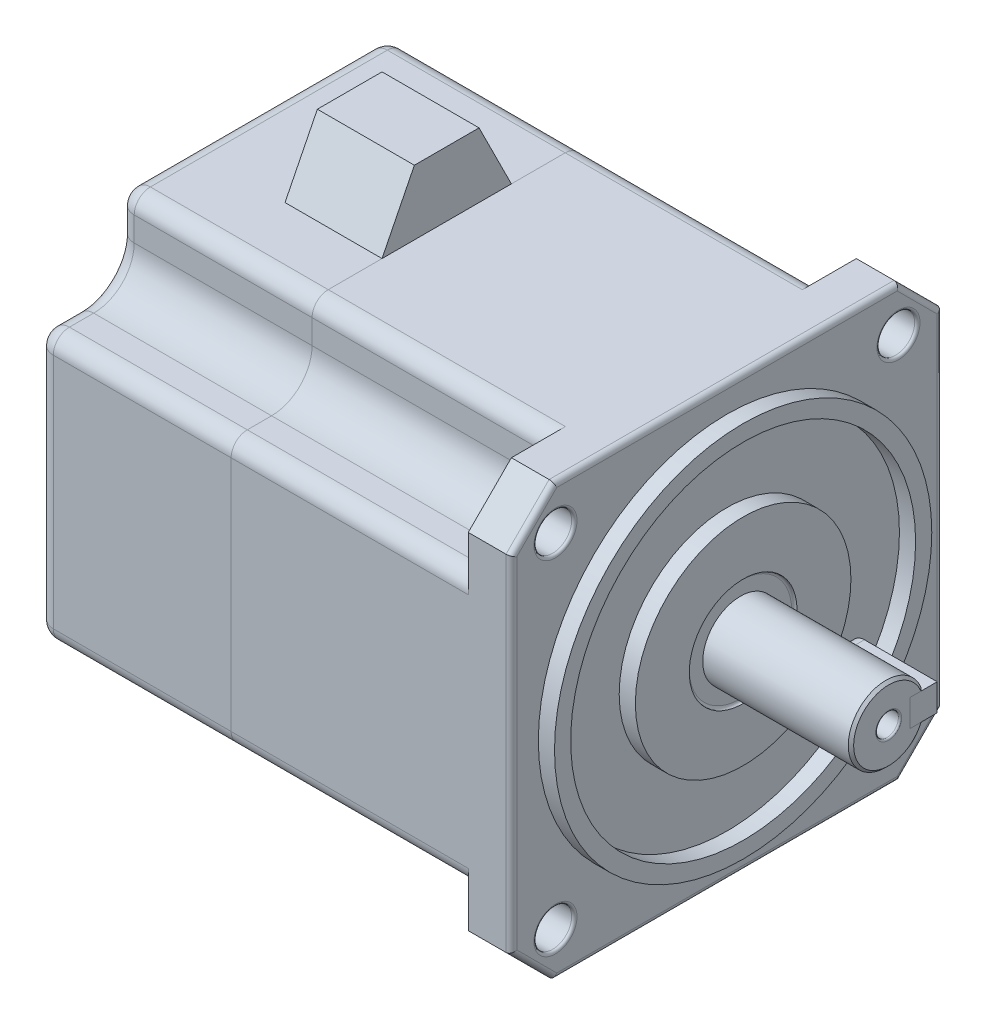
ISO-10303-21;
HEADER;
FILE_DESCRIPTION(('STEP AP214'),'2;1');
FILE_NAME('part.step','',(''),(''),'','','');
FILE_SCHEMA(('AUTOMOTIVE_DESIGN { 1 0 10303 214 1 1 1 1 }'));
ENDSEC;
DATA;
#1=APPLICATION_CONTEXT('core data for automotive mechanical design processes');
#2=APPLICATION_PROTOCOL_DEFINITION('international standard','automotive_design',2000,#1);
#3=PRODUCT_CONTEXT('',#1,'mechanical');
#4=PRODUCT('Part','Part','',(#3));
#5=PRODUCT_RELATED_PRODUCT_CATEGORY('part','',(#4));
#6=PRODUCT_DEFINITION_FORMATION('','',#4);
#7=PRODUCT_DEFINITION_CONTEXT('part definition',#1,'design');
#8=PRODUCT_DEFINITION('design','',#6,#7);
#9=PRODUCT_DEFINITION_SHAPE('','',#8);
#10=(LENGTH_UNIT() NAMED_UNIT(*) SI_UNIT(.MILLI.,.METRE.));
#11=(NAMED_UNIT(*) PLANE_ANGLE_UNIT() SI_UNIT($,.RADIAN.));
#12=(NAMED_UNIT(*) SI_UNIT($,.STERADIAN.) SOLID_ANGLE_UNIT());
#13=UNCERTAINTY_MEASURE_WITH_UNIT(LENGTH_MEASURE(1.E-05),#10,'distance_accuracy_value','');
#14=(GEOMETRIC_REPRESENTATION_CONTEXT(3) GLOBAL_UNCERTAINTY_ASSIGNED_CONTEXT((#13)) GLOBAL_UNIT_ASSIGNED_CONTEXT((#10,
#11,#12)) REPRESENTATION_CONTEXT('',''));
#15=CARTESIAN_POINT('',(0.,0.,0.));
#16=DIRECTION('',(0.,0.,1.));
#17=DIRECTION('',(1.,0.,0.));
#18=AXIS2_PLACEMENT_3D('',#15,#16,#17);
#19=CARTESIAN_POINT('',(-52.,52.,12.));
#20=DIRECTION('',(-1.,0.,0.));
#21=DIRECTION('',(0.,0.,1.));
#22=AXIS2_PLACEMENT_3D('',#19,#20,#21);
#23=PLANE('',#22);
#24=DIRECTION('',(0.,0.,-1.));
#25=VECTOR('',#24,1.);
#26=CARTESIAN_POINT('',(-52.,40.,12.));
#27=LINE('',#26,#25);
#28=CARTESIAN_POINT('',(-52.,40.,12.));
#29=VERTEX_POINT('',#28);
#30=CARTESIAN_POINT('',(-52.,40.,-12.));
#31=VERTEX_POINT('',#30);
#32=EDGE_CURVE('E99',#29,#31,#27,.T.);
#33=ORIENTED_EDGE('',*,*,#32,.T.);
#34=DIRECTION('',(0.,-0.894427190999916,-0.447213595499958));
#35=VECTOR('',#34,1.);
#36=CARTESIAN_POINT('',(-52.,52.,-5.99999999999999));
#37=LINE('',#36,#35);
#38=CARTESIAN_POINT('',(-52.,52.,-5.99999999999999));
#39=VERTEX_POINT('',#38);
#40=EDGE_CURVE('E74',#39,#31,#37,.T.);
#41=ORIENTED_EDGE('',*,*,#40,.F.);
#42=DIRECTION('',(0.,0.,-1.));
#43=VECTOR('',#42,1.);
#44=CARTESIAN_POINT('',(-52.,52.,12.));
#45=LINE('',#44,#43);
#46=CARTESIAN_POINT('',(-52.,52.,6.00000000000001));
#47=VERTEX_POINT('',#46);
#48=EDGE_CURVE('E58',#47,#39,#45,.T.);
#49=ORIENTED_EDGE('',*,*,#48,.F.);
#50=DIRECTION('',(0.,0.894427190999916,-0.447213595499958));
#51=VECTOR('',#50,1.);
#52=CARTESIAN_POINT('',(-52.,52.,6.00000000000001));
#53=LINE('',#52,#51);
#54=EDGE_CURVE('E115',#29,#47,#53,.T.);
#55=ORIENTED_EDGE('',*,*,#54,.F.);
#56=EDGE_LOOP('',(#33,#41,#49,#55));
#57=FACE_BOUND('',#56,.T.);
#58=ADVANCED_FACE('F50',(#57),#23,.F.);
#59=CARTESIAN_POINT('',(-70.,52.,12.));
#60=DIRECTION('',(1.,0.,0.));
#61=DIRECTION('',(0.,0.,-1.));
#62=AXIS2_PLACEMENT_3D('',#59,#60,#61);
#63=PLANE('',#62);
#64=DIRECTION('',(0.,0.,1.));
#65=VECTOR('',#64,1.);
#66=CARTESIAN_POINT('',(-70.,52.,12.));
#67=LINE('',#66,#65);
#68=CARTESIAN_POINT('',(-70.,52.,-5.99999999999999));
#69=VERTEX_POINT('',#68);
#70=CARTESIAN_POINT('',(-70.,52.,6.00000000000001));
#71=VERTEX_POINT('',#70);
#72=EDGE_CURVE('E12',#69,#71,#67,.T.);
#73=ORIENTED_EDGE('',*,*,#72,.F.);
#74=DIRECTION('',(0.,-0.894427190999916,-0.447213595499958));
#75=VECTOR('',#74,1.);
#76=CARTESIAN_POINT('',(-70.,52.,-5.99999999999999));
#77=LINE('',#76,#75);
#78=CARTESIAN_POINT('',(-70.,40.,-12.));
#79=VERTEX_POINT('',#78);
#80=EDGE_CURVE('E92',#69,#79,#77,.T.);
#81=ORIENTED_EDGE('',*,*,#80,.T.);
#82=DIRECTION('',(0.,0.,1.));
#83=VECTOR('',#82,1.);
#84=CARTESIAN_POINT('',(-70.,40.,12.));
#85=LINE('',#84,#83);
#86=CARTESIAN_POINT('',(-70.,40.,12.));
#87=VERTEX_POINT('',#86);
#88=EDGE_CURVE('E98',#79,#87,#85,.T.);
#89=ORIENTED_EDGE('',*,*,#88,.T.);
#90=DIRECTION('',(0.,0.894427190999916,-0.447213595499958));
#91=VECTOR('',#90,1.);
#92=CARTESIAN_POINT('',(-70.,52.,6.00000000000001));
#93=LINE('',#92,#91);
#94=EDGE_CURVE('E66',#87,#71,#93,.T.);
#95=ORIENTED_EDGE('',*,*,#94,.T.);
#96=EDGE_LOOP('',(#73,#81,#89,#95));
#97=FACE_BOUND('',#96,.T.);
#98=ADVANCED_FACE('F103',(#97),#63,.F.);
#99=CARTESIAN_POINT('',(0.,52.,0.));
#100=DIRECTION('',(0.,-1.,0.));
#101=DIRECTION('',(0.,0.,-1.));
#102=AXIS2_PLACEMENT_3D('',#99,#100,#101);
#103=PLANE('',#102);
#104=ORIENTED_EDGE('',*,*,#48,.T.);
#105=DIRECTION('',(1.,0.,0.));
#106=VECTOR('',#105,1.);
#107=CARTESIAN_POINT('',(-70.,52.,-5.99999999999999));
#108=LINE('',#107,#106);
#109=EDGE_CURVE('E105',#69,#39,#108,.T.);
#110=ORIENTED_EDGE('',*,*,#109,.F.);
#111=ORIENTED_EDGE('',*,*,#72,.T.);
#112=DIRECTION('',(1.,0.,0.));
#113=VECTOR('',#112,1.);
#114=CARTESIAN_POINT('',(-70.,52.,6.00000000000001));
#115=LINE('',#114,#113);
#116=EDGE_CURVE('E109',#71,#47,#115,.T.);
#117=ORIENTED_EDGE('',*,*,#116,.T.);
#118=EDGE_LOOP('',(#104,#110,#111,#117));
#119=FACE_BOUND('',#118,.T.);
#120=ADVANCED_FACE('F123',(#119),#103,.F.);
#121=CARTESIAN_POINT('',(0.,40.,0.));
#122=DIRECTION('',(0.,-1.,0.));
#123=DIRECTION('',(0.,0.,-1.));
#124=AXIS2_PLACEMENT_3D('',#121,#122,#123);
#125=PLANE('',#124);
#126=ORIENTED_EDGE('',*,*,#32,.F.);
#127=DIRECTION('',(1.,0.,0.));
#128=VECTOR('',#127,1.);
#129=CARTESIAN_POINT('',(-70.,40.,12.));
#130=LINE('',#129,#128);
#131=EDGE_CURVE('E53',#87,#29,#130,.T.);
#132=ORIENTED_EDGE('',*,*,#131,.F.);
#133=ORIENTED_EDGE('',*,*,#88,.F.);
#134=DIRECTION('',(-1.,0.,0.));
#135=VECTOR('',#134,1.);
#136=CARTESIAN_POINT('',(-70.,40.,-12.));
#137=LINE('',#136,#135);
#138=EDGE_CURVE('E89',#31,#79,#137,.T.);
#139=ORIENTED_EDGE('',*,*,#138,.F.);
#140=EDGE_LOOP('',(#126,#132,#133,#139));
#141=FACE_BOUND('',#140,.T.);
#142=ADVANCED_FACE('F107',(#141),#125,.T.);
#143=CARTESIAN_POINT('',(-70.,52.,6.00000000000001));
#144=DIRECTION('',(0.,-0.447213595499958,-0.894427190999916));
#145=DIRECTION('',(0.,0.894427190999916,-0.447213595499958));
#146=AXIS2_PLACEMENT_3D('',#143,#144,#145);
#147=PLANE('',#146);
#148=ORIENTED_EDGE('',*,*,#54,.T.);
#149=ORIENTED_EDGE('',*,*,#116,.F.);
#150=ORIENTED_EDGE('',*,*,#94,.F.);
#151=ORIENTED_EDGE('',*,*,#131,.T.);
#152=EDGE_LOOP('',(#148,#149,#150,#151));
#153=FACE_BOUND('',#152,.T.);
#154=ADVANCED_FACE('F124',(#153),#147,.F.);
#155=CARTESIAN_POINT('',(-70.,52.,-5.99999999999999));
#156=DIRECTION('',(0.,-0.447213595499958,0.894427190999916));
#157=DIRECTION('',(0.,-0.894427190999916,-0.447213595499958));
#158=AXIS2_PLACEMENT_3D('',#155,#156,#157);
#159=PLANE('',#158);
#160=ORIENTED_EDGE('',*,*,#40,.T.);
#161=ORIENTED_EDGE('',*,*,#138,.T.);
#162=ORIENTED_EDGE('',*,*,#80,.F.);
#163=ORIENTED_EDGE('',*,*,#109,.T.);
#164=EDGE_LOOP('',(#160,#161,#162,#163));
#165=FACE_BOUND('',#164,.T.);
#166=ADVANCED_FACE('F91',(#165),#159,.F.);
#167=CLOSED_SHELL('',(#58,#98,#120,#142,#154,#166));
#168=MANIFOLD_SOLID_BREP('B2',#167);
#169=CARTESIAN_POINT('',(16.5,0.,-9.));
#170=DIRECTION('',(0.,0.,1.));
#171=DIRECTION('',(1.,0.,0.));
#172=AXIS2_PLACEMENT_3D('',#169,#170,#171);
#173=CYLINDRICAL_SURFACE('',#172,2.5);
#174=CARTESIAN_POINT('',(16.5,0.,-4.));
#175=DIRECTION('',(0.,0.,-1.));
#176=DIRECTION('',(-1.,0.,0.));
#177=AXIS2_PLACEMENT_3D('',#174,#175,#176);
#178=CIRCLE('',#177,2.5);
#179=CARTESIAN_POINT('',(16.5,-2.5,-4.));
#180=VERTEX_POINT('',#179);
#181=CARTESIAN_POINT('',(16.5,2.5,-4.));
#182=VERTEX_POINT('',#181);
#183=EDGE_CURVE('E247',#180,#182,#178,.T.);
#184=ORIENTED_EDGE('',*,*,#183,.T.);
#185=DIRECTION('',(0.,0.,1.));
#186=VECTOR('',#185,1.);
#187=CARTESIAN_POINT('',(16.5,2.5,-9.));
#188=LINE('',#187,#186);
#189=CARTESIAN_POINT('',(16.5,2.5,-9.));
#190=VERTEX_POINT('',#189);
#191=EDGE_CURVE('E48',#190,#182,#188,.T.);
#192=ORIENTED_EDGE('',*,*,#191,.F.);
#193=CARTESIAN_POINT('',(16.5,0.,-9.));
#194=DIRECTION('',(0.,0.,-1.));
#195=DIRECTION('',(-1.,0.,0.));
#196=AXIS2_PLACEMENT_3D('',#193,#194,#195);
#197=CIRCLE('',#196,2.5);
#198=CARTESIAN_POINT('',(16.5,-2.5,-9.));
#199=VERTEX_POINT('',#198);
#200=EDGE_CURVE('E235',#199,#190,#197,.T.);
#201=ORIENTED_EDGE('',*,*,#200,.F.);
#202=DIRECTION('',(0.,0.,1.));
#203=VECTOR('',#202,1.);
#204=CARTESIAN_POINT('',(16.5,-2.5,-9.));
#205=LINE('',#204,#203);
#206=EDGE_CURVE('E243',#199,#180,#205,.T.);
#207=ORIENTED_EDGE('',*,*,#206,.T.);
#208=EDGE_LOOP('',(#184,#192,#201,#207));
#209=FACE_BOUND('',#208,.T.);
#210=ADVANCED_FACE('F184',(#209),#173,.T.);
#211=CARTESIAN_POINT('',(16.5,2.5,-9.));
#212=DIRECTION('',(0.,-1.,0.));
#213=DIRECTION('',(1.,0.,0.));
#214=AXIS2_PLACEMENT_3D('',#211,#212,#213);
#215=PLANE('',#214);
#216=DIRECTION('',(1.,0.,0.));
#217=VECTOR('',#216,1.);
#218=CARTESIAN_POINT('',(16.5,2.5,-4.));
#219=LINE('',#218,#217);
#220=CARTESIAN_POINT('',(30.,2.5,-4.));
#221=VERTEX_POINT('',#220);
#222=EDGE_CURVE('E239',#182,#221,#219,.T.);
#223=ORIENTED_EDGE('',*,*,#222,.T.);
#224=DIRECTION('',(0.,0.,1.));
#225=VECTOR('',#224,1.);
#226=CARTESIAN_POINT('',(30.,2.5,-9.));
#227=LINE('',#226,#225);
#228=CARTESIAN_POINT('',(30.,2.5,-9.));
#229=VERTEX_POINT('',#228);
#230=EDGE_CURVE('E192',#229,#221,#227,.T.);
#231=ORIENTED_EDGE('',*,*,#230,.F.);
#232=DIRECTION('',(1.,0.,0.));
#233=VECTOR('',#232,1.);
#234=CARTESIAN_POINT('',(16.5,2.5,-9.));
#235=LINE('',#234,#233);
#236=EDGE_CURVE('E230',#190,#229,#235,.T.);
#237=ORIENTED_EDGE('',*,*,#236,.F.);
#238=ORIENTED_EDGE('',*,*,#191,.T.);
#239=EDGE_LOOP('',(#223,#231,#237,#238));
#240=FACE_BOUND('',#239,.T.);
#241=ADVANCED_FACE('F238',(#240),#215,.F.);
#242=CARTESIAN_POINT('',(30.,2.5,-9.));
#243=DIRECTION('',(-1.,0.,0.));
#244=DIRECTION('',(0.,0.,1.));
#245=AXIS2_PLACEMENT_3D('',#242,#243,#244);
#246=PLANE('',#245);
#247=DIRECTION('',(0.,-1.,0.));
#248=VECTOR('',#247,1.);
#249=CARTESIAN_POINT('',(30.,2.5,-4.));
#250=LINE('',#249,#248);
#251=CARTESIAN_POINT('',(30.,-2.5,-4.));
#252=VERTEX_POINT('',#251);
#253=EDGE_CURVE('E217',#221,#252,#250,.T.);
#254=ORIENTED_EDGE('',*,*,#253,.T.);
#255=DIRECTION('',(0.,0.,1.));
#256=VECTOR('',#255,1.);
#257=CARTESIAN_POINT('',(30.,-2.5,-9.));
#258=LINE('',#257,#256);
#259=CARTESIAN_POINT('',(30.,-2.5,-9.));
#260=VERTEX_POINT('',#259);
#261=EDGE_CURVE('E240',#260,#252,#258,.T.);
#262=ORIENTED_EDGE('',*,*,#261,.F.);
#263=DIRECTION('',(0.,-1.,0.));
#264=VECTOR('',#263,1.);
#265=CARTESIAN_POINT('',(30.,2.5,-9.));
#266=LINE('',#265,#264);
#267=EDGE_CURVE('E233',#229,#260,#266,.T.);
#268=ORIENTED_EDGE('',*,*,#267,.F.);
#269=ORIENTED_EDGE('',*,*,#230,.T.);
#270=EDGE_LOOP('',(#254,#262,#268,#269));
#271=FACE_BOUND('',#270,.T.);
#272=ADVANCED_FACE('F241',(#271),#246,.F.);
#273=CARTESIAN_POINT('',(30.,-2.5,-9.));
#274=DIRECTION('',(0.,1.,0.));
#275=DIRECTION('',(0.,0.,1.));
#276=AXIS2_PLACEMENT_3D('',#273,#274,#275);
#277=PLANE('',#276);
#278=DIRECTION('',(-1.,0.,0.));
#279=VECTOR('',#278,1.);
#280=CARTESIAN_POINT('',(30.,-2.5,-4.));
#281=LINE('',#280,#279);
#282=EDGE_CURVE('E223',#252,#180,#281,.T.);
#283=ORIENTED_EDGE('',*,*,#282,.T.);
#284=ORIENTED_EDGE('',*,*,#206,.F.);
#285=DIRECTION('',(-1.,0.,0.));
#286=VECTOR('',#285,1.);
#287=CARTESIAN_POINT('',(30.,-2.5,-9.));
#288=LINE('',#287,#286);
#289=EDGE_CURVE('E200',#260,#199,#288,.T.);
#290=ORIENTED_EDGE('',*,*,#289,.F.);
#291=ORIENTED_EDGE('',*,*,#261,.T.);
#292=EDGE_LOOP('',(#283,#284,#290,#291));
#293=FACE_BOUND('',#292,.T.);
#294=ADVANCED_FACE('F254',(#293),#277,.F.);
#295=CARTESIAN_POINT('',(16.5,0.,-9.));
#296=DIRECTION('',(0.,0.,-1.));
#297=DIRECTION('',(-1.,0.,0.));
#298=AXIS2_PLACEMENT_3D('',#295,#296,#297);
#299=PLANE('',#298);
#300=ORIENTED_EDGE('',*,*,#200,.T.);
#301=ORIENTED_EDGE('',*,*,#236,.T.);
#302=ORIENTED_EDGE('',*,*,#267,.T.);
#303=ORIENTED_EDGE('',*,*,#289,.T.);
#304=EDGE_LOOP('',(#300,#301,#302,#303));
#305=FACE_BOUND('',#304,.T.);
#306=ADVANCED_FACE('F231',(#305),#299,.T.);
#307=CARTESIAN_POINT('',(16.5,0.,-4.));
#308=DIRECTION('',(0.,0.,-1.));
#309=DIRECTION('',(-1.,0.,0.));
#310=AXIS2_PLACEMENT_3D('',#307,#308,#309);
#311=PLANE('',#310);
#312=ORIENTED_EDGE('',*,*,#183,.F.);
#313=ORIENTED_EDGE('',*,*,#282,.F.);
#314=ORIENTED_EDGE('',*,*,#253,.F.);
#315=ORIENTED_EDGE('',*,*,#222,.F.);
#316=EDGE_LOOP('',(#312,#313,#314,#315));
#317=FACE_BOUND('',#316,.T.);
#318=ADVANCED_FACE('F257',(#317),#311,.F.);
#319=CLOSED_SHELL('',(#210,#241,#272,#294,#306,#318));
#320=MANIFOLD_SOLID_BREP('B6',#319);
#321=CARTESIAN_POINT('',(-88.,-32.,-40.));
#322=DIRECTION('',(0.,0.,1.));
#323=DIRECTION('',(1.,0.,0.));
#324=AXIS2_PLACEMENT_3D('',#321,#322,#323);
#325=PLANE('',#324);
#326=DIRECTION('',(-1.,0.,0.));
#327=VECTOR('',#326,1.);
#328=CARTESIAN_POINT('',(-7.99999999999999,-21.9833518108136,-40.));
#329=LINE('',#328,#327);
#330=CARTESIAN_POINT('',(-52.,-21.9833518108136,-40.));
#331=VERTEX_POINT('',#330);
#332=CARTESIAN_POINT('',(-85.,-21.9833518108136,-40.));
#333=VERTEX_POINT('',#332);
#334=EDGE_CURVE('E795',#331,#333,#329,.T.);
#335=ORIENTED_EDGE('',*,*,#334,.T.);
#336=DIRECTION('',(0.,-1.,0.));
#337=VECTOR('',#336,1.);
#338=CARTESIAN_POINT('',(-85.,21.983351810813,-40.));
#339=LINE('',#338,#337);
#340=CARTESIAN_POINT('',(-85.,21.983351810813,-40.));
#341=VERTEX_POINT('',#340);
#342=EDGE_CURVE('E326',#333,#341,#339,.F.);
#343=ORIENTED_EDGE('',*,*,#342,.T.);
#344=DIRECTION('',(-1.,0.,0.));
#345=VECTOR('',#344,1.);
#346=CARTESIAN_POINT('',(-7.99999999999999,21.983351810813,-40.));
#347=LINE('',#346,#345);
#348=CARTESIAN_POINT('',(-52.,21.983351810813,-40.));
#349=VERTEX_POINT('',#348);
#350=EDGE_CURVE('E839',#349,#341,#347,.T.);
#351=ORIENTED_EDGE('',*,*,#350,.F.);
#352=DIRECTION('',(0.,-1.,0.));
#353=VECTOR('',#352,1.);
#354=CARTESIAN_POINT('',(-52.,-32.,-40.));
#355=LINE('',#354,#353);
#356=EDGE_CURVE('E835',#349,#331,#355,.T.);
#357=ORIENTED_EDGE('',*,*,#356,.T.);
#358=EDGE_LOOP('',(#335,#343,#351,#357));
#359=FACE_BOUND('',#358,.T.);
#360=ADVANCED_FACE('F317',(#359),#325,.F.);
#361=CARTESIAN_POINT('',(-88.,-40.,-32.));
#362=DIRECTION('',(0.,1.,0.));
#363=DIRECTION('',(0.,0.,1.));
#364=AXIS2_PLACEMENT_3D('',#361,#362,#363);
#365=PLANE('',#364);
#366=DIRECTION('',(-1.,0.,0.));
#367=VECTOR('',#366,1.);
#368=CARTESIAN_POINT('',(-7.99999999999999,-40.,21.983351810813));
#369=LINE('',#368,#367);
#370=CARTESIAN_POINT('',(-52.,-40.,21.983351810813));
#371=VERTEX_POINT('',#370);
#372=CARTESIAN_POINT('',(-85.,-40.,21.983351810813));
#373=VERTEX_POINT('',#372);
#374=EDGE_CURVE('E789',#371,#373,#369,.T.);
#375=ORIENTED_EDGE('',*,*,#374,.T.);
#376=DIRECTION('',(0.,0.,1.));
#377=VECTOR('',#376,1.);
#378=CARTESIAN_POINT('',(-85.,-40.,-21.9833518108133));
#379=LINE('',#378,#377);
#380=CARTESIAN_POINT('',(-85.,-40.,-21.9833518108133));
#381=VERTEX_POINT('',#380);
#382=EDGE_CURVE('E671',#373,#381,#379,.F.);
#383=ORIENTED_EDGE('',*,*,#382,.T.);
#384=DIRECTION('',(-1.,0.,0.));
#385=VECTOR('',#384,1.);
#386=CARTESIAN_POINT('',(-7.99999999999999,-40.,-21.9833518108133));
#387=LINE('',#386,#385);
#388=CARTESIAN_POINT('',(-52.,-40.,-21.9833518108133));
#389=VERTEX_POINT('',#388);
#390=EDGE_CURVE('E787',#389,#381,#387,.T.);
#391=ORIENTED_EDGE('',*,*,#390,.F.);
#392=DIRECTION('',(0.,0.,1.));
#393=VECTOR('',#392,1.);
#394=CARTESIAN_POINT('',(-52.,-40.,-32.));
#395=LINE('',#394,#393);
#396=EDGE_CURVE('E838',#389,#371,#395,.T.);
#397=ORIENTED_EDGE('',*,*,#396,.T.);
#398=EDGE_LOOP('',(#375,#383,#391,#397));
#399=FACE_BOUND('',#398,.T.);
#400=ADVANCED_FACE('F785',(#399),#365,.F.);
#401=CARTESIAN_POINT('',(-88.,-32.,40.));
#402=DIRECTION('',(0.,0.,-1.));
#403=DIRECTION('',(-1.,0.,0.));
#404=AXIS2_PLACEMENT_3D('',#401,#402,#403);
#405=PLANE('',#404);
#406=DIRECTION('',(-1.,0.,0.));
#407=VECTOR('',#406,1.);
#408=CARTESIAN_POINT('',(-7.99999999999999,21.9833518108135,40.));
#409=LINE('',#408,#407);
#410=CARTESIAN_POINT('',(-52.,21.9833518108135,40.));
#411=VERTEX_POINT('',#410);
#412=CARTESIAN_POINT('',(-85.,21.9833518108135,40.));
#413=VERTEX_POINT('',#412);
#414=EDGE_CURVE('E831',#411,#413,#409,.T.);
#415=ORIENTED_EDGE('',*,*,#414,.T.);
#416=DIRECTION('',(0.,1.,0.));
#417=VECTOR('',#416,1.);
#418=CARTESIAN_POINT('',(-85.,-21.9833518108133,40.));
#419=LINE('',#418,#417);
#420=CARTESIAN_POINT('',(-85.,-21.9833518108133,40.));
#421=VERTEX_POINT('',#420);
#422=EDGE_CURVE('E659',#413,#421,#419,.F.);
#423=ORIENTED_EDGE('',*,*,#422,.T.);
#424=DIRECTION('',(-1.,0.,0.));
#425=VECTOR('',#424,1.);
#426=CARTESIAN_POINT('',(-7.99999999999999,-21.9833518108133,40.));
#427=LINE('',#426,#425);
#428=CARTESIAN_POINT('',(-52.,-21.9833518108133,40.));
#429=VERTEX_POINT('',#428);
#430=EDGE_CURVE('E813',#429,#421,#427,.T.);
#431=ORIENTED_EDGE('',*,*,#430,.F.);
#432=DIRECTION('',(0.,1.,0.));
#433=VECTOR('',#432,1.);
#434=CARTESIAN_POINT('',(-52.,-32.,40.));
#435=LINE('',#434,#433);
#436=EDGE_CURVE('E841',#429,#411,#435,.T.);
#437=ORIENTED_EDGE('',*,*,#436,.T.);
#438=EDGE_LOOP('',(#415,#423,#431,#437));
#439=FACE_BOUND('',#438,.T.);
#440=ADVANCED_FACE('F920',(#439),#405,.F.);
#441=CARTESIAN_POINT('',(-88.,40.,-32.));
#442=DIRECTION('',(0.,-1.,0.));
#443=DIRECTION('',(0.,0.,-1.));
#444=AXIS2_PLACEMENT_3D('',#441,#442,#443);
#445=PLANE('',#444);
#446=DIRECTION('',(-1.,0.,0.));
#447=VECTOR('',#446,1.);
#448=CARTESIAN_POINT('',(-7.99999999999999,40.,-21.9833518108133));
#449=LINE('',#448,#447);
#450=CARTESIAN_POINT('',(-52.,40.,-21.9833518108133));
#451=VERTEX_POINT('',#450);
#452=CARTESIAN_POINT('',(-85.,40.,-21.9833518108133));
#453=VERTEX_POINT('',#452);
#454=EDGE_CURVE('E850',#451,#453,#449,.T.);
#455=ORIENTED_EDGE('',*,*,#454,.T.);
#456=DIRECTION('',(0.,0.,-1.));
#457=VECTOR('',#456,1.);
#458=CARTESIAN_POINT('',(-85.,40.,21.9833518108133));
#459=LINE('',#458,#457);
#460=CARTESIAN_POINT('',(-85.,40.,21.9833518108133));
#461=VERTEX_POINT('',#460);
#462=EDGE_CURVE('E648',#453,#461,#459,.F.);
#463=ORIENTED_EDGE('',*,*,#462,.T.);
#464=DIRECTION('',(-1.,0.,0.));
#465=VECTOR('',#464,1.);
#466=CARTESIAN_POINT('',(-7.99999999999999,40.,21.9833518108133));
#467=LINE('',#466,#465);
#468=CARTESIAN_POINT('',(-52.,40.,21.9833518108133));
#469=VERTEX_POINT('',#468);
#470=EDGE_CURVE('E828',#469,#461,#467,.T.);
#471=ORIENTED_EDGE('',*,*,#470,.F.);
#472=DIRECTION('',(0.,0.,-1.));
#473=VECTOR('',#472,1.);
#474=CARTESIAN_POINT('',(-52.,40.,-32.));
#475=LINE('',#474,#473);
#476=EDGE_CURVE('E540',#469,#451,#475,.T.);
#477=ORIENTED_EDGE('',*,*,#476,.T.);
#478=EDGE_LOOP('',(#455,#463,#471,#477));
#479=FACE_BOUND('',#478,.T.);
#480=ADVANCED_FACE('F849',(#479),#445,.F.);
#481=CARTESIAN_POINT('',(-88.,0.,0.));
#482=DIRECTION('',(-1.,0.,0.));
#483=DIRECTION('',(0.,0.,1.));
#484=AXIS2_PLACEMENT_3D('',#481,#482,#483);
#485=PLANE('',#484);
#486=CARTESIAN_POINT('',(-88.,32.5,-32.4999999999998));
#487=DIRECTION('',(-1.,0.,0.));
#488=DIRECTION('',(0.,0.,1.));
#489=AXIS2_PLACEMENT_3D('',#486,#487,#488);
#490=CIRCLE('',#489,10.5166481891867);
#491=CARTESIAN_POINT('',(-88.,32.5,-21.9833518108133));
#492=VERTEX_POINT('',#491);
#493=CARTESIAN_POINT('',(-88.,21.9833518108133,-32.4999999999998));
#494=VERTEX_POINT('',#493);
#495=EDGE_CURVE('E637',#492,#494,#490,.F.);
#496=ORIENTED_EDGE('',*,*,#495,.T.);
#497=DIRECTION('',(0.,0.,1.));
#498=VECTOR('',#497,1.);
#499=CARTESIAN_POINT('',(-88.,21.9833518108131,-37.));
#500=LINE('',#499,#498);
#501=CARTESIAN_POINT('',(-88.,21.983351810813,-37.));
#502=VERTEX_POINT('',#501);
#503=EDGE_CURVE('E639',#494,#502,#500,.F.);
#504=ORIENTED_EDGE('',*,*,#503,.T.);
#505=DIRECTION('',(0.,-1.,0.));
#506=VECTOR('',#505,1.);
#507=CARTESIAN_POINT('',(-88.,-21.9833518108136,-37.));
#508=LINE('',#507,#506);
#509=CARTESIAN_POINT('',(-88.,-21.9833518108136,-37.));
#510=VERTEX_POINT('',#509);
#511=EDGE_CURVE('E609',#502,#510,#508,.T.);
#512=ORIENTED_EDGE('',*,*,#511,.T.);
#513=DIRECTION('',(0.,0.,-1.));
#514=VECTOR('',#513,1.);
#515=CARTESIAN_POINT('',(-88.,-21.9833518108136,-32.4999999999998));
#516=LINE('',#515,#514);
#517=CARTESIAN_POINT('',(-88.,-21.9833518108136,-32.4999999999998));
#518=VERTEX_POINT('',#517);
#519=EDGE_CURVE('E611',#510,#518,#516,.F.);
#520=ORIENTED_EDGE('',*,*,#519,.T.);
#521=CARTESIAN_POINT('',(-88.,-32.5,-32.4999999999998));
#522=DIRECTION('',(-1.,0.,0.));
#523=DIRECTION('',(0.,0.,1.));
#524=AXIS2_PLACEMENT_3D('',#521,#522,#523);
#525=CIRCLE('',#524,10.5166481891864);
#526=CARTESIAN_POINT('',(-88.,-32.5,-21.9833518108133));
#527=VERTEX_POINT('',#526);
#528=EDGE_CURVE('E613',#518,#527,#525,.F.);
#529=ORIENTED_EDGE('',*,*,#528,.T.);
#530=DIRECTION('',(0.,1.,0.));
#531=VECTOR('',#530,1.);
#532=CARTESIAN_POINT('',(-88.,-37.,-21.9833518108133));
#533=LINE('',#532,#531);
#534=CARTESIAN_POINT('',(-88.,-37.,-21.9833518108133));
#535=VERTEX_POINT('',#534);
#536=EDGE_CURVE('E615',#527,#535,#533,.F.);
#537=ORIENTED_EDGE('',*,*,#536,.T.);
#538=DIRECTION('',(0.,0.,1.));
#539=VECTOR('',#538,1.);
#540=CARTESIAN_POINT('',(-88.,-37.,21.983351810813));
#541=LINE('',#540,#539);
#542=CARTESIAN_POINT('',(-88.,-37.,21.983351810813));
#543=VERTEX_POINT('',#542);
#544=EDGE_CURVE('E617',#535,#543,#541,.T.);
#545=ORIENTED_EDGE('',*,*,#544,.T.);
#546=DIRECTION('',(0.,-1.,0.));
#547=VECTOR('',#546,1.);
#548=CARTESIAN_POINT('',(-88.,-32.5,21.983351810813));
#549=LINE('',#548,#547);
#550=CARTESIAN_POINT('',(-88.,-32.5,21.983351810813));
#551=VERTEX_POINT('',#550);
#552=EDGE_CURVE('E619',#543,#551,#549,.F.);
#553=ORIENTED_EDGE('',*,*,#552,.T.);
#554=CARTESIAN_POINT('',(-88.,-32.5,32.4999999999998));
#555=DIRECTION('',(-1.,0.,0.));
#556=DIRECTION('',(0.,0.,1.));
#557=AXIS2_PLACEMENT_3D('',#554,#555,#556);
#558=CIRCLE('',#557,10.5166481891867);
#559=CARTESIAN_POINT('',(-88.,-21.9833518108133,32.4999999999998));
#560=VERTEX_POINT('',#559);
#561=EDGE_CURVE('E621',#551,#560,#558,.F.);
#562=ORIENTED_EDGE('',*,*,#561,.T.);
#563=DIRECTION('',(0.,0.,-1.));
#564=VECTOR('',#563,1.);
#565=CARTESIAN_POINT('',(-88.,-21.9833518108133,37.));
#566=LINE('',#565,#564);
#567=CARTESIAN_POINT('',(-88.,-21.9833518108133,37.));
#568=VERTEX_POINT('',#567);
#569=EDGE_CURVE('E623',#560,#568,#566,.F.);
#570=ORIENTED_EDGE('',*,*,#569,.T.);
#571=DIRECTION('',(0.,1.,0.));
#572=VECTOR('',#571,1.);
#573=CARTESIAN_POINT('',(-88.,21.9833518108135,37.));
#574=LINE('',#573,#572);
#575=CARTESIAN_POINT('',(-88.,21.9833518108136,37.));
#576=VERTEX_POINT('',#575);
#577=EDGE_CURVE('E625',#568,#576,#574,.T.);
#578=ORIENTED_EDGE('',*,*,#577,.T.);
#579=DIRECTION('',(0.,0.,1.));
#580=VECTOR('',#579,1.);
#581=CARTESIAN_POINT('',(-88.,21.9833518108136,32.4999999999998));
#582=LINE('',#581,#580);
#583=CARTESIAN_POINT('',(-88.,21.9833518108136,32.4999999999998));
#584=VERTEX_POINT('',#583);
#585=EDGE_CURVE('E627',#576,#584,#582,.F.);
#586=ORIENTED_EDGE('',*,*,#585,.T.);
#587=CARTESIAN_POINT('',(-88.,32.5,32.4999999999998));
#588=DIRECTION('',(-1.,0.,0.));
#589=DIRECTION('',(0.,0.,1.));
#590=AXIS2_PLACEMENT_3D('',#587,#588,#589);
#591=CIRCLE('',#590,10.5166481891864);
#592=CARTESIAN_POINT('',(-88.,32.5,21.9833518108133));
#593=VERTEX_POINT('',#592);
#594=EDGE_CURVE('E629',#584,#593,#591,.F.);
#595=ORIENTED_EDGE('',*,*,#594,.T.);
#596=DIRECTION('',(0.,-1.,0.));
#597=VECTOR('',#596,1.);
#598=CARTESIAN_POINT('',(-88.,37.,21.9833518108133));
#599=LINE('',#598,#597);
#600=CARTESIAN_POINT('',(-88.,37.,21.9833518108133));
#601=VERTEX_POINT('',#600);
#602=EDGE_CURVE('E631',#593,#601,#599,.F.);
#603=ORIENTED_EDGE('',*,*,#602,.T.);
#604=DIRECTION('',(0.,0.,-1.));
#605=VECTOR('',#604,1.);
#606=CARTESIAN_POINT('',(-88.,37.,-21.9833518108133));
#607=LINE('',#606,#605);
#608=CARTESIAN_POINT('',(-88.,37.,-21.9833518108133));
#609=VERTEX_POINT('',#608);
#610=EDGE_CURVE('E633',#601,#609,#607,.T.);
#611=ORIENTED_EDGE('',*,*,#610,.T.);
#612=DIRECTION('',(0.,1.,0.));
#613=VECTOR('',#612,1.);
#614=CARTESIAN_POINT('',(-88.,32.5,-21.9833518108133));
#615=LINE('',#614,#613);
#616=EDGE_CURVE('E635',#609,#492,#615,.F.);
#617=ORIENTED_EDGE('',*,*,#616,.T.);
#618=EDGE_LOOP('',(#496,#504,#512,#520,#529,#537,#545,#553,#562,#570,#578,#586,#595,#603,#611,#617));
#619=FACE_BOUND('',#618,.T.);
#620=ADVANCED_FACE('F763',(#619),#485,.T.);
#621=CARTESIAN_POINT('',(-52.,0.,0.));
#622=DIRECTION('',(-1.,0.,0.));
#623=DIRECTION('',(0.,0.,1.));
#624=AXIS2_PLACEMENT_3D('',#621,#622,#623);
#625=PLANE('',#624);
#626=ORIENTED_EDGE('',*,*,#356,.F.);
#627=CARTESIAN_POINT('',(-52.,21.9833518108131,-37.));
#628=DIRECTION('',(-1.,0.,0.));
#629=DIRECTION('',(0.,0.,1.));
#630=AXIS2_PLACEMENT_3D('',#627,#628,#629);
#631=CIRCLE('',#630,3.);
#632=CARTESIAN_POINT('',(-52.,24.9833518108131,-37.));
#633=VERTEX_POINT('',#632);
#634=EDGE_CURVE('E603',#349,#633,#631,.F.);
#635=ORIENTED_EDGE('',*,*,#634,.T.);
#636=DIRECTION('',(0.,0.,1.));
#637=VECTOR('',#636,1.);
#638=CARTESIAN_POINT('',(-52.,24.9833518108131,0.));
#639=LINE('',#638,#637);
#640=CARTESIAN_POINT('',(-52.,24.9833518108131,-32.4999999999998));
#641=VERTEX_POINT('',#640);
#642=EDGE_CURVE('E591',#633,#641,#639,.T.);
#643=ORIENTED_EDGE('',*,*,#642,.T.);
#644=CARTESIAN_POINT('',(-52.,32.5,-32.4999999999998));
#645=DIRECTION('',(-1.,0.,0.));
#646=DIRECTION('',(0.,0.,1.));
#647=AXIS2_PLACEMENT_3D('',#644,#645,#646);
#648=CIRCLE('',#647,7.51664818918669);
#649=CARTESIAN_POINT('',(-52.,32.5,-24.9833518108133));
#650=VERTEX_POINT('',#649);
#651=EDGE_CURVE('E594',#641,#650,#648,.T.);
#652=ORIENTED_EDGE('',*,*,#651,.T.);
#653=DIRECTION('',(0.,1.,0.));
#654=VECTOR('',#653,1.);
#655=CARTESIAN_POINT('',(-52.,0.,-24.9833518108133));
#656=LINE('',#655,#654);
#657=CARTESIAN_POINT('',(-52.,37.,-24.9833518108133));
#658=VERTEX_POINT('',#657);
#659=EDGE_CURVE('E597',#650,#658,#656,.T.);
#660=ORIENTED_EDGE('',*,*,#659,.T.);
#661=CARTESIAN_POINT('',(-52.,37.,-21.9833518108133));
#662=DIRECTION('',(-1.,0.,0.));
#663=DIRECTION('',(0.,0.,1.));
#664=AXIS2_PLACEMENT_3D('',#661,#662,#663);
#665=CIRCLE('',#664,3.);
#666=EDGE_CURVE('E600',#658,#451,#665,.F.);
#667=ORIENTED_EDGE('',*,*,#666,.T.);
#668=ORIENTED_EDGE('',*,*,#476,.F.);
#669=CARTESIAN_POINT('',(-52.,37.,21.9833518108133));
#670=DIRECTION('',(-1.,0.,0.));
#671=DIRECTION('',(0.,0.,1.));
#672=AXIS2_PLACEMENT_3D('',#669,#670,#671);
#673=CIRCLE('',#672,3.);
#674=CARTESIAN_POINT('',(-52.,37.,24.9833518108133));
#675=VERTEX_POINT('',#674);
#676=EDGE_CURVE('E556',#469,#675,#673,.F.);
#677=ORIENTED_EDGE('',*,*,#676,.T.);
#678=DIRECTION('',(0.,-1.,0.));
#679=VECTOR('',#678,1.);
#680=CARTESIAN_POINT('',(-52.,0.,24.9833518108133));
#681=LINE('',#680,#679);
#682=CARTESIAN_POINT('',(-52.,32.5,24.9833518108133));
#683=VERTEX_POINT('',#682);
#684=EDGE_CURVE('E554',#675,#683,#681,.T.);
#685=ORIENTED_EDGE('',*,*,#684,.T.);
#686=CARTESIAN_POINT('',(-52.,32.5,32.4999999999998));
#687=DIRECTION('',(-1.,0.,0.));
#688=DIRECTION('',(0.,0.,1.));
#689=AXIS2_PLACEMENT_3D('',#686,#687,#688);
#690=CIRCLE('',#689,7.51664818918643);
#691=CARTESIAN_POINT('',(-52.,24.9833518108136,32.4999999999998));
#692=VERTEX_POINT('',#691);
#693=EDGE_CURVE('E545',#683,#692,#690,.T.);
#694=ORIENTED_EDGE('',*,*,#693,.T.);
#695=DIRECTION('',(0.,0.,1.));
#696=VECTOR('',#695,1.);
#697=CARTESIAN_POINT('',(-52.,24.9833518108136,0.));
#698=LINE('',#697,#696);
#699=CARTESIAN_POINT('',(-52.,24.9833518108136,37.));
#700=VERTEX_POINT('',#699);
#701=EDGE_CURVE('E528',#692,#700,#698,.T.);
#702=ORIENTED_EDGE('',*,*,#701,.T.);
#703=CARTESIAN_POINT('',(-52.,21.9833518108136,37.));
#704=DIRECTION('',(-1.,0.,0.));
#705=DIRECTION('',(0.,0.,1.));
#706=AXIS2_PLACEMENT_3D('',#703,#704,#705);
#707=CIRCLE('',#706,3.);
#708=EDGE_CURVE('E539',#700,#411,#707,.F.);
#709=ORIENTED_EDGE('',*,*,#708,.T.);
#710=ORIENTED_EDGE('',*,*,#436,.F.);
#711=CARTESIAN_POINT('',(-52.,-21.9833518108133,37.));
#712=DIRECTION('',(-1.,0.,0.));
#713=DIRECTION('',(0.,0.,1.));
#714=AXIS2_PLACEMENT_3D('',#711,#712,#713);
#715=CIRCLE('',#714,3.);
#716=CARTESIAN_POINT('',(-52.,-24.9833518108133,37.));
#717=VERTEX_POINT('',#716);
#718=EDGE_CURVE('E573',#429,#717,#715,.F.);
#719=ORIENTED_EDGE('',*,*,#718,.T.);
#720=DIRECTION('',(0.,0.,-1.));
#721=VECTOR('',#720,1.);
#722=CARTESIAN_POINT('',(-52.,-24.9833518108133,0.));
#723=LINE('',#722,#721);
#724=CARTESIAN_POINT('',(-52.,-24.9833518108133,32.4999999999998));
#725=VERTEX_POINT('',#724);
#726=EDGE_CURVE('E570',#717,#725,#723,.T.);
#727=ORIENTED_EDGE('',*,*,#726,.T.);
#728=CARTESIAN_POINT('',(-52.,-32.5,32.4999999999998));
#729=DIRECTION('',(-1.,0.,0.));
#730=DIRECTION('',(0.,0.,1.));
#731=AXIS2_PLACEMENT_3D('',#728,#729,#730);
#732=CIRCLE('',#731,7.51664818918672);
#733=CARTESIAN_POINT('',(-52.,-32.5,24.983351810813));
#734=VERTEX_POINT('',#733);
#735=EDGE_CURVE('E567',#725,#734,#732,.T.);
#736=ORIENTED_EDGE('',*,*,#735,.T.);
#737=DIRECTION('',(0.,-1.,0.));
#738=VECTOR('',#737,1.);
#739=CARTESIAN_POINT('',(-52.,0.,24.983351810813));
#740=LINE('',#739,#738);
#741=CARTESIAN_POINT('',(-52.,-37.,24.983351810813));
#742=VERTEX_POINT('',#741);
#743=EDGE_CURVE('E561',#734,#742,#740,.T.);
#744=ORIENTED_EDGE('',*,*,#743,.T.);
#745=CARTESIAN_POINT('',(-52.,-37.,21.983351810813));
#746=DIRECTION('',(-1.,0.,0.));
#747=DIRECTION('',(0.,0.,1.));
#748=AXIS2_PLACEMENT_3D('',#745,#746,#747);
#749=CIRCLE('',#748,3.);
#750=EDGE_CURVE('E564',#742,#371,#749,.F.);
#751=ORIENTED_EDGE('',*,*,#750,.T.);
#752=ORIENTED_EDGE('',*,*,#396,.F.);
#753=CARTESIAN_POINT('',(-52.,-37.,-21.9833518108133));
#754=DIRECTION('',(-1.,0.,0.));
#755=DIRECTION('',(0.,0.,1.));
#756=AXIS2_PLACEMENT_3D('',#753,#754,#755);
#757=CIRCLE('',#756,3.);
#758=CARTESIAN_POINT('',(-52.,-37.,-24.9833518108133));
#759=VERTEX_POINT('',#758);
#760=EDGE_CURVE('E588',#389,#759,#757,.F.);
#761=ORIENTED_EDGE('',*,*,#760,.T.);
#762=DIRECTION('',(0.,1.,0.));
#763=VECTOR('',#762,1.);
#764=CARTESIAN_POINT('',(-52.,0.,-24.9833518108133));
#765=LINE('',#764,#763);
#766=CARTESIAN_POINT('',(-52.,-32.5,-24.9833518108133));
#767=VERTEX_POINT('',#766);
#768=EDGE_CURVE('E585',#759,#767,#765,.T.);
#769=ORIENTED_EDGE('',*,*,#768,.T.);
#770=CARTESIAN_POINT('',(-52.,-32.5,-32.4999999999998));
#771=DIRECTION('',(-1.,0.,0.));
#772=DIRECTION('',(0.,0.,1.));
#773=AXIS2_PLACEMENT_3D('',#770,#771,#772);
#774=CIRCLE('',#773,7.51664818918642);
#775=CARTESIAN_POINT('',(-52.,-24.9833518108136,-32.4999999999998));
#776=VERTEX_POINT('',#775);
#777=EDGE_CURVE('E582',#767,#776,#774,.T.);
#778=ORIENTED_EDGE('',*,*,#777,.T.);
#779=DIRECTION('',(0.,0.,-1.));
#780=VECTOR('',#779,1.);
#781=CARTESIAN_POINT('',(-52.,-24.9833518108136,0.));
#782=LINE('',#781,#780);
#783=CARTESIAN_POINT('',(-52.,-24.9833518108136,-37.));
#784=VERTEX_POINT('',#783);
#785=EDGE_CURVE('E576',#776,#784,#782,.T.);
#786=ORIENTED_EDGE('',*,*,#785,.T.);
#787=CARTESIAN_POINT('',(-52.,-21.9833518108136,-37.));
#788=DIRECTION('',(-1.,0.,0.));
#789=DIRECTION('',(0.,0.,1.));
#790=AXIS2_PLACEMENT_3D('',#787,#788,#789);
#791=CIRCLE('',#790,3.);
#792=EDGE_CURVE('E579',#784,#331,#791,.F.);
#793=ORIENTED_EDGE('',*,*,#792,.T.);
#794=EDGE_LOOP('',(#626,#635,#643,#652,#660,#667,#668,#677,#685,#694,#702,#709,#710,#719,#727,
#736,#744,#751,#752,#761,#769,#778,#786,#793));
#795=FACE_BOUND('',#794,.T.);
#796=ADVANCED_FACE('F552',(#795),#625,.F.);
#797=CARTESIAN_POINT('',(-7.99999999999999,32.5,32.4999999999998));
#798=DIRECTION('',(-1.,0.,0.));
#799=DIRECTION('',(0.,0.,1.));
#800=AXIS2_PLACEMENT_3D('',#797,#798,#799);
#801=CYLINDRICAL_SURFACE('',#800,7.51664818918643);
#802=DIRECTION('',(-1.,0.,0.));
#803=VECTOR('',#802,1.);
#804=CARTESIAN_POINT('',(-7.99999999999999,32.5,24.9833518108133));
#805=LINE('',#804,#803);
#806=CARTESIAN_POINT('',(-85.,32.5,24.9833518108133));
#807=VERTEX_POINT('',#806);
#808=EDGE_CURVE('E823',#683,#807,#805,.T.);
#809=ORIENTED_EDGE('',*,*,#808,.T.);
#810=CARTESIAN_POINT('',(-85.,32.5,32.4999999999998));
#811=DIRECTION('',(-1.,0.,0.));
#812=DIRECTION('',(0.,0.,1.));
#813=AXIS2_PLACEMENT_3D('',#810,#811,#812);
#814=CIRCLE('',#813,7.51664818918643);
#815=CARTESIAN_POINT('',(-85.,24.9833518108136,32.4999999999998));
#816=VERTEX_POINT('',#815);
#817=EDGE_CURVE('E548',#807,#816,#814,.T.);
#818=ORIENTED_EDGE('',*,*,#817,.T.);
#819=DIRECTION('',(-1.,0.,0.));
#820=VECTOR('',#819,1.);
#821=CARTESIAN_POINT('',(-7.99999999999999,24.9833518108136,32.4999999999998));
#822=LINE('',#821,#820);
#823=EDGE_CURVE('E531',#692,#816,#822,.T.);
#824=ORIENTED_EDGE('',*,*,#823,.F.);
#825=ORIENTED_EDGE('',*,*,#693,.F.);
#826=EDGE_LOOP('',(#809,#818,#824,#825));
#827=FACE_BOUND('',#826,.T.);
#828=ADVANCED_FACE('F544',(#827),#801,.F.);
#829=CARTESIAN_POINT('',(-7.99999999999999,32.5,24.9833518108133));
#830=DIRECTION('',(0.,0.,-1.));
#831=DIRECTION('',(-1.,0.,0.));
#832=AXIS2_PLACEMENT_3D('',#829,#830,#831);
#833=PLANE('',#832);
#834=DIRECTION('',(-1.,0.,0.));
#835=VECTOR('',#834,1.);
#836=CARTESIAN_POINT('',(-7.99999999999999,37.,24.9833518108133));
#837=LINE('',#836,#835);
#838=CARTESIAN_POINT('',(-85.,37.,24.9833518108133));
#839=VERTEX_POINT('',#838);
#840=EDGE_CURVE('E825',#675,#839,#837,.T.);
#841=ORIENTED_EDGE('',*,*,#840,.T.);
#842=DIRECTION('',(0.,-1.,0.));
#843=VECTOR('',#842,1.);
#844=CARTESIAN_POINT('',(-85.,32.5,24.9833518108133));
#845=LINE('',#844,#843);
#846=EDGE_CURVE('E652',#839,#807,#845,.T.);
#847=ORIENTED_EDGE('',*,*,#846,.T.);
#848=ORIENTED_EDGE('',*,*,#808,.F.);
#849=ORIENTED_EDGE('',*,*,#684,.F.);
#850=EDGE_LOOP('',(#841,#847,#848,#849));
#851=FACE_BOUND('',#850,.T.);
#852=ADVANCED_FACE('F1265',(#851),#833,.F.);
#853=CARTESIAN_POINT('',(-7.99999999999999,37.,21.9833518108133));
#854=DIRECTION('',(-1.,0.,0.));
#855=DIRECTION('',(0.,0.,1.));
#856=AXIS2_PLACEMENT_3D('',#853,#854,#855);
#857=CYLINDRICAL_SURFACE('',#856,3.);
#858=ORIENTED_EDGE('',*,*,#470,.T.);
#859=CARTESIAN_POINT('',(-85.,37.,21.9833518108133));
#860=DIRECTION('',(-1.,0.,0.));
#861=DIRECTION('',(0.,0.,1.));
#862=AXIS2_PLACEMENT_3D('',#859,#860,#861);
#863=CIRCLE('',#862,3.);
#864=EDGE_CURVE('E650',#461,#839,#863,.F.);
#865=ORIENTED_EDGE('',*,*,#864,.T.);
#866=ORIENTED_EDGE('',*,*,#840,.F.);
#867=ORIENTED_EDGE('',*,*,#676,.F.);
#868=EDGE_LOOP('',(#858,#865,#866,#867));
#869=FACE_BOUND('',#868,.T.);
#870=ADVANCED_FACE('F1256',(#869),#857,.T.);
#871=CARTESIAN_POINT('',(-7.99999999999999,21.9833518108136,37.));
#872=DIRECTION('',(-1.,0.,0.));
#873=DIRECTION('',(0.,0.,1.));
#874=AXIS2_PLACEMENT_3D('',#871,#872,#873);
#875=CYLINDRICAL_SURFACE('',#874,3.);
#876=DIRECTION('',(-1.,0.,0.));
#877=VECTOR('',#876,1.);
#878=CARTESIAN_POINT('',(-7.99999999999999,24.9833518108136,37.));
#879=LINE('',#878,#877);
#880=CARTESIAN_POINT('',(-85.,24.9833518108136,37.));
#881=VERTEX_POINT('',#880);
#882=EDGE_CURVE('E534',#700,#881,#879,.T.);
#883=ORIENTED_EDGE('',*,*,#882,.T.);
#884=CARTESIAN_POINT('',(-85.,21.9833518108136,37.));
#885=DIRECTION('',(-1.,0.,0.));
#886=DIRECTION('',(0.,0.,1.));
#887=AXIS2_PLACEMENT_3D('',#884,#885,#886);
#888=CIRCLE('',#887,3.);
#889=EDGE_CURVE('E657',#881,#413,#888,.F.);
#890=ORIENTED_EDGE('',*,*,#889,.T.);
#891=ORIENTED_EDGE('',*,*,#414,.F.);
#892=ORIENTED_EDGE('',*,*,#708,.F.);
#893=EDGE_LOOP('',(#883,#890,#891,#892));
#894=FACE_BOUND('',#893,.T.);
#895=ADVANCED_FACE('F1248',(#894),#875,.T.);
#896=CARTESIAN_POINT('',(-7.99999999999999,24.9833518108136,37.));
#897=DIRECTION('',(0.,-1.,0.));
#898=DIRECTION('',(0.,0.,-1.));
#899=AXIS2_PLACEMENT_3D('',#896,#897,#898);
#900=PLANE('',#899);
#901=ORIENTED_EDGE('',*,*,#823,.T.);
#902=DIRECTION('',(0.,0.,1.));
#903=VECTOR('',#902,1.);
#904=CARTESIAN_POINT('',(-85.,24.9833518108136,37.));
#905=LINE('',#904,#903);
#906=EDGE_CURVE('E655',#816,#881,#905,.T.);
#907=ORIENTED_EDGE('',*,*,#906,.T.);
#908=ORIENTED_EDGE('',*,*,#882,.F.);
#909=ORIENTED_EDGE('',*,*,#701,.F.);
#910=EDGE_LOOP('',(#901,#907,#908,#909));
#911=FACE_BOUND('',#910,.T.);
#912=ADVANCED_FACE('F530',(#911),#900,.F.);
#913=CARTESIAN_POINT('',(-7.99999999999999,-32.5,32.4999999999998));
#914=DIRECTION('',(-1.,0.,0.));
#915=DIRECTION('',(0.,0.,1.));
#916=AXIS2_PLACEMENT_3D('',#913,#914,#915);
#917=CYLINDRICAL_SURFACE('',#916,7.51664818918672);
#918=DIRECTION('',(-1.,0.,0.));
#919=VECTOR('',#918,1.);
#920=CARTESIAN_POINT('',(-7.99999999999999,-24.9833518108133,32.4999999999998));
#921=LINE('',#920,#919);
#922=CARTESIAN_POINT('',(-85.,-24.9833518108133,32.4999999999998));
#923=VERTEX_POINT('',#922);
#924=EDGE_CURVE('E807',#725,#923,#921,.T.);
#925=ORIENTED_EDGE('',*,*,#924,.T.);
#926=CARTESIAN_POINT('',(-85.,-32.5,32.4999999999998));
#927=DIRECTION('',(-1.,0.,0.));
#928=DIRECTION('',(0.,0.,1.));
#929=AXIS2_PLACEMENT_3D('',#926,#927,#928);
#930=CIRCLE('',#929,7.51664818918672);
#931=CARTESIAN_POINT('',(-85.,-32.5,24.983351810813));
#932=VERTEX_POINT('',#931);
#933=EDGE_CURVE('E665',#923,#932,#930,.T.);
#934=ORIENTED_EDGE('',*,*,#933,.T.);
#935=DIRECTION('',(-1.,0.,0.));
#936=VECTOR('',#935,1.);
#937=CARTESIAN_POINT('',(-7.99999999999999,-32.5,24.983351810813));
#938=LINE('',#937,#936);
#939=EDGE_CURVE('E820',#734,#932,#938,.T.);
#940=ORIENTED_EDGE('',*,*,#939,.F.);
#941=ORIENTED_EDGE('',*,*,#735,.F.);
#942=EDGE_LOOP('',(#925,#934,#940,#941));
#943=FACE_BOUND('',#942,.T.);
#944=ADVANCED_FACE('F1231',(#943),#917,.F.);
#945=CARTESIAN_POINT('',(-7.99999999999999,-24.9833518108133,32.4999999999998));
#946=DIRECTION('',(0.,1.,0.));
#947=DIRECTION('',(0.,0.,1.));
#948=AXIS2_PLACEMENT_3D('',#945,#946,#947);
#949=PLANE('',#948);
#950=DIRECTION('',(-1.,0.,0.));
#951=VECTOR('',#950,1.);
#952=CARTESIAN_POINT('',(-7.99999999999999,-24.9833518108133,37.));
#953=LINE('',#952,#951);
#954=CARTESIAN_POINT('',(-85.,-24.9833518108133,37.));
#955=VERTEX_POINT('',#954);
#956=EDGE_CURVE('E810',#717,#955,#953,.T.);
#957=ORIENTED_EDGE('',*,*,#956,.T.);
#958=DIRECTION('',(0.,0.,-1.));
#959=VECTOR('',#958,1.);
#960=CARTESIAN_POINT('',(-85.,-24.9833518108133,32.4999999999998));
#961=LINE('',#960,#959);
#962=EDGE_CURVE('E663',#955,#923,#961,.T.);
#963=ORIENTED_EDGE('',*,*,#962,.T.);
#964=ORIENTED_EDGE('',*,*,#924,.F.);
#965=ORIENTED_EDGE('',*,*,#726,.F.);
#966=EDGE_LOOP('',(#957,#963,#964,#965));
#967=FACE_BOUND('',#966,.T.);
#968=ADVANCED_FACE('F1222',(#967),#949,.F.);
#969=CARTESIAN_POINT('',(-7.99999999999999,-21.9833518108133,37.));
#970=DIRECTION('',(-1.,0.,0.));
#971=DIRECTION('',(0.,0.,1.));
#972=AXIS2_PLACEMENT_3D('',#969,#970,#971);
#973=CYLINDRICAL_SURFACE('',#972,3.);
#974=ORIENTED_EDGE('',*,*,#430,.T.);
#975=CARTESIAN_POINT('',(-85.,-21.9833518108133,37.));
#976=DIRECTION('',(-1.,0.,0.));
#977=DIRECTION('',(0.,0.,1.));
#978=AXIS2_PLACEMENT_3D('',#975,#976,#977);
#979=CIRCLE('',#978,3.);
#980=EDGE_CURVE('E661',#421,#955,#979,.F.);
#981=ORIENTED_EDGE('',*,*,#980,.T.);
#982=ORIENTED_EDGE('',*,*,#956,.F.);
#983=ORIENTED_EDGE('',*,*,#718,.F.);
#984=EDGE_LOOP('',(#974,#981,#982,#983));
#985=FACE_BOUND('',#984,.T.);
#986=ADVANCED_FACE('F1213',(#985),#973,.T.);
#987=CARTESIAN_POINT('',(-7.99999999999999,-37.,21.983351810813));
#988=DIRECTION('',(-1.,0.,0.));
#989=DIRECTION('',(0.,0.,1.));
#990=AXIS2_PLACEMENT_3D('',#987,#988,#989);
#991=CYLINDRICAL_SURFACE('',#990,3.);
#992=DIRECTION('',(-1.,0.,0.));
#993=VECTOR('',#992,1.);
#994=CARTESIAN_POINT('',(-7.99999999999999,-37.,24.983351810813));
#995=LINE('',#994,#993);
#996=CARTESIAN_POINT('',(-85.,-37.,24.983351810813));
#997=VERTEX_POINT('',#996);
#998=EDGE_CURVE('E817',#742,#997,#995,.T.);
#999=ORIENTED_EDGE('',*,*,#998,.T.);
#1000=CARTESIAN_POINT('',(-85.,-37.,21.983351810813));
#1001=DIRECTION('',(-1.,0.,0.));
#1002=DIRECTION('',(0.,0.,1.));
#1003=AXIS2_PLACEMENT_3D('',#1000,#1001,#1002);
#1004=CIRCLE('',#1003,3.);
#1005=EDGE_CURVE('E669',#997,#373,#1004,.F.);
#1006=ORIENTED_EDGE('',*,*,#1005,.T.);
#1007=ORIENTED_EDGE('',*,*,#374,.F.);
#1008=ORIENTED_EDGE('',*,*,#750,.F.);
#1009=EDGE_LOOP('',(#999,#1006,#1007,#1008));
#1010=FACE_BOUND('',#1009,.T.);
#1011=ADVANCED_FACE('F1204',(#1010),#991,.T.);
#1012=CARTESIAN_POINT('',(-7.99999999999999,-37.,24.983351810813));
#1013=DIRECTION('',(0.,0.,-1.));
#1014=DIRECTION('',(-1.,0.,0.));
#1015=AXIS2_PLACEMENT_3D('',#1012,#1013,#1014);
#1016=PLANE('',#1015);
#1017=ORIENTED_EDGE('',*,*,#939,.T.);
#1018=DIRECTION('',(0.,-1.,0.));
#1019=VECTOR('',#1018,1.);
#1020=CARTESIAN_POINT('',(-85.,-37.,24.983351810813));
#1021=LINE('',#1020,#1019);
#1022=EDGE_CURVE('E667',#932,#997,#1021,.T.);
#1023=ORIENTED_EDGE('',*,*,#1022,.T.);
#1024=ORIENTED_EDGE('',*,*,#998,.F.);
#1025=ORIENTED_EDGE('',*,*,#743,.F.);
#1026=EDGE_LOOP('',(#1017,#1023,#1024,#1025));
#1027=FACE_BOUND('',#1026,.T.);
#1028=ADVANCED_FACE('F1196',(#1027),#1016,.F.);
#1029=CARTESIAN_POINT('',(-7.99999999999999,-32.5,-32.4999999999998));
#1030=DIRECTION('',(-1.,0.,0.));
#1031=DIRECTION('',(0.,0.,1.));
#1032=AXIS2_PLACEMENT_3D('',#1029,#1030,#1031);
#1033=CYLINDRICAL_SURFACE('',#1032,7.51664818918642);
#1034=DIRECTION('',(-1.,0.,0.));
#1035=VECTOR('',#1034,1.);
#1036=CARTESIAN_POINT('',(-7.99999999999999,-32.5,-24.9833518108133));
#1037=LINE('',#1036,#1035);
#1038=CARTESIAN_POINT('',(-85.,-32.5,-24.9833518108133));
#1039=VERTEX_POINT('',#1038);
#1040=EDGE_CURVE('E797',#767,#1039,#1037,.T.);
#1041=ORIENTED_EDGE('',*,*,#1040,.T.);
#1042=CARTESIAN_POINT('',(-85.,-32.5,-32.4999999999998));
#1043=DIRECTION('',(-1.,0.,0.));
#1044=DIRECTION('',(0.,0.,1.));
#1045=AXIS2_PLACEMENT_3D('',#1042,#1043,#1044);
#1046=CIRCLE('',#1045,7.51664818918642);
#1047=CARTESIAN_POINT('',(-85.,-24.9833518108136,-32.4999999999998));
#1048=VERTEX_POINT('',#1047);
#1049=EDGE_CURVE('E677',#1039,#1048,#1046,.T.);
#1050=ORIENTED_EDGE('',*,*,#1049,.T.);
#1051=DIRECTION('',(-1.,0.,0.));
#1052=VECTOR('',#1051,1.);
#1053=CARTESIAN_POINT('',(-7.99999999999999,-24.9833518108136,-32.4999999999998));
#1054=LINE('',#1053,#1052);
#1055=EDGE_CURVE('E804',#776,#1048,#1054,.T.);
#1056=ORIENTED_EDGE('',*,*,#1055,.F.);
#1057=ORIENTED_EDGE('',*,*,#777,.F.);
#1058=EDGE_LOOP('',(#1041,#1050,#1056,#1057));
#1059=FACE_BOUND('',#1058,.T.);
#1060=ADVANCED_FACE('F878',(#1059),#1033,.F.);
#1061=CARTESIAN_POINT('',(-7.99999999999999,-32.5,-24.9833518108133));
#1062=DIRECTION('',(0.,0.,1.));
#1063=DIRECTION('',(1.,0.,0.));
#1064=AXIS2_PLACEMENT_3D('',#1061,#1062,#1063);
#1065=PLANE('',#1064);
#1066=DIRECTION('',(-1.,0.,0.));
#1067=VECTOR('',#1066,1.);
#1068=CARTESIAN_POINT('',(-7.99999999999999,-37.,-24.9833518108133));
#1069=LINE('',#1068,#1067);
#1070=CARTESIAN_POINT('',(-85.,-37.,-24.9833518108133));
#1071=VERTEX_POINT('',#1070);
#1072=EDGE_CURVE('E794',#759,#1071,#1069,.T.);
#1073=ORIENTED_EDGE('',*,*,#1072,.T.);
#1074=DIRECTION('',(0.,1.,0.));
#1075=VECTOR('',#1074,1.);
#1076=CARTESIAN_POINT('',(-85.,-32.5,-24.9833518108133));
#1077=LINE('',#1076,#1075);
#1078=EDGE_CURVE('E675',#1071,#1039,#1077,.T.);
#1079=ORIENTED_EDGE('',*,*,#1078,.T.);
#1080=ORIENTED_EDGE('',*,*,#1040,.F.);
#1081=ORIENTED_EDGE('',*,*,#768,.F.);
#1082=EDGE_LOOP('',(#1073,#1079,#1080,#1081));
#1083=FACE_BOUND('',#1082,.T.);
#1084=ADVANCED_FACE('F899',(#1083),#1065,.F.);
#1085=CARTESIAN_POINT('',(-7.99999999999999,-37.,-21.9833518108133));
#1086=DIRECTION('',(-1.,0.,0.));
#1087=DIRECTION('',(0.,0.,1.));
#1088=AXIS2_PLACEMENT_3D('',#1085,#1086,#1087);
#1089=CYLINDRICAL_SURFACE('',#1088,3.);
#1090=ORIENTED_EDGE('',*,*,#390,.T.);
#1091=CARTESIAN_POINT('',(-85.,-37.,-21.9833518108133));
#1092=DIRECTION('',(-1.,0.,0.));
#1093=DIRECTION('',(0.,0.,1.));
#1094=AXIS2_PLACEMENT_3D('',#1091,#1092,#1093);
#1095=CIRCLE('',#1094,3.);
#1096=EDGE_CURVE('E673',#381,#1071,#1095,.F.);
#1097=ORIENTED_EDGE('',*,*,#1096,.T.);
#1098=ORIENTED_EDGE('',*,*,#1072,.F.);
#1099=ORIENTED_EDGE('',*,*,#760,.F.);
#1100=EDGE_LOOP('',(#1090,#1097,#1098,#1099));
#1101=FACE_BOUND('',#1100,.T.);
#1102=ADVANCED_FACE('F791',(#1101),#1089,.T.);
#1103=CARTESIAN_POINT('',(-7.99999999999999,-21.9833518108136,-37.));
#1104=DIRECTION('',(-1.,0.,0.));
#1105=DIRECTION('',(0.,0.,1.));
#1106=AXIS2_PLACEMENT_3D('',#1103,#1104,#1105);
#1107=CYLINDRICAL_SURFACE('',#1106,3.);
#1108=DIRECTION('',(-1.,0.,0.));
#1109=VECTOR('',#1108,1.);
#1110=CARTESIAN_POINT('',(-7.99999999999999,-24.9833518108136,-37.));
#1111=LINE('',#1110,#1109);
#1112=CARTESIAN_POINT('',(-85.,-24.9833518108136,-37.));
#1113=VERTEX_POINT('',#1112);
#1114=EDGE_CURVE('E799',#784,#1113,#1111,.T.);
#1115=ORIENTED_EDGE('',*,*,#1114,.T.);
#1116=CARTESIAN_POINT('',(-85.,-21.9833518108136,-37.));
#1117=DIRECTION('',(-1.,0.,0.));
#1118=DIRECTION('',(0.,0.,1.));
#1119=AXIS2_PLACEMENT_3D('',#1116,#1117,#1118);
#1120=CIRCLE('',#1119,3.);
#1121=EDGE_CURVE('E341',#1113,#333,#1120,.F.);
#1122=ORIENTED_EDGE('',*,*,#1121,.T.);
#1123=ORIENTED_EDGE('',*,*,#334,.F.);
#1124=ORIENTED_EDGE('',*,*,#792,.F.);
#1125=EDGE_LOOP('',(#1115,#1122,#1123,#1124));
#1126=FACE_BOUND('',#1125,.T.);
#1127=ADVANCED_FACE('F898',(#1126),#1107,.T.);
#1128=CARTESIAN_POINT('',(-7.99999999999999,-24.9833518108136,-37.));
#1129=DIRECTION('',(0.,1.,0.));
#1130=DIRECTION('',(0.,0.,1.));
#1131=AXIS2_PLACEMENT_3D('',#1128,#1129,#1130);
#1132=PLANE('',#1131);
#1133=ORIENTED_EDGE('',*,*,#1055,.T.);
#1134=DIRECTION('',(0.,0.,-1.));
#1135=VECTOR('',#1134,1.);
#1136=CARTESIAN_POINT('',(-85.,-24.9833518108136,-37.));
#1137=LINE('',#1136,#1135);
#1138=EDGE_CURVE('E679',#1048,#1113,#1137,.T.);
#1139=ORIENTED_EDGE('',*,*,#1138,.T.);
#1140=ORIENTED_EDGE('',*,*,#1114,.F.);
#1141=ORIENTED_EDGE('',*,*,#785,.F.);
#1142=EDGE_LOOP('',(#1133,#1139,#1140,#1141));
#1143=FACE_BOUND('',#1142,.T.);
#1144=ADVANCED_FACE('F896',(#1143),#1132,.F.);
#1145=CARTESIAN_POINT('',(-7.99999999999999,21.9833518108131,-37.));
#1146=DIRECTION('',(-1.,0.,0.));
#1147=DIRECTION('',(0.,0.,1.));
#1148=AXIS2_PLACEMENT_3D('',#1145,#1146,#1147);
#1149=CYLINDRICAL_SURFACE('',#1148,3.);
#1150=ORIENTED_EDGE('',*,*,#350,.T.);
#1151=CARTESIAN_POINT('',(-85.,21.9833518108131,-37.));
#1152=DIRECTION('',(-1.,0.,0.));
#1153=DIRECTION('',(0.,0.,1.));
#1154=AXIS2_PLACEMENT_3D('',#1151,#1152,#1153);
#1155=CIRCLE('',#1154,3.);
#1156=CARTESIAN_POINT('',(-85.,24.9833518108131,-37.));
#1157=VERTEX_POINT('',#1156);
#1158=EDGE_CURVE('E182',#341,#1157,#1155,.F.);
#1159=ORIENTED_EDGE('',*,*,#1158,.T.);
#1160=DIRECTION('',(-1.,0.,0.));
#1161=VECTOR('',#1160,1.);
#1162=CARTESIAN_POINT('',(-7.99999999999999,24.9833518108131,-37.));
#1163=LINE('',#1162,#1161);
#1164=EDGE_CURVE('E872',#633,#1157,#1163,.T.);
#1165=ORIENTED_EDGE('',*,*,#1164,.F.);
#1166=ORIENTED_EDGE('',*,*,#634,.F.);
#1167=EDGE_LOOP('',(#1150,#1159,#1165,#1166));
#1168=FACE_BOUND('',#1167,.T.);
#1169=ADVANCED_FACE('F1152',(#1168),#1149,.T.);
#1170=CARTESIAN_POINT('',(-7.99999999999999,37.,-21.9833518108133));
#1171=DIRECTION('',(-1.,0.,0.));
#1172=DIRECTION('',(0.,0.,1.));
#1173=AXIS2_PLACEMENT_3D('',#1170,#1171,#1172);
#1174=CYLINDRICAL_SURFACE('',#1173,3.);
#1175=DIRECTION('',(-1.,0.,0.));
#1176=VECTOR('',#1175,1.);
#1177=CARTESIAN_POINT('',(-7.99999999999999,37.,-24.9833518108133));
#1178=LINE('',#1177,#1176);
#1179=CARTESIAN_POINT('',(-85.,37.,-24.9833518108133));
#1180=VERTEX_POINT('',#1179);
#1181=EDGE_CURVE('E856',#658,#1180,#1178,.T.);
#1182=ORIENTED_EDGE('',*,*,#1181,.T.);
#1183=CARTESIAN_POINT('',(-85.,37.,-21.9833518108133));
#1184=DIRECTION('',(-1.,0.,0.));
#1185=DIRECTION('',(0.,0.,1.));
#1186=AXIS2_PLACEMENT_3D('',#1183,#1184,#1185);
#1187=CIRCLE('',#1186,3.);
#1188=EDGE_CURVE('E646',#1180,#453,#1187,.F.);
#1189=ORIENTED_EDGE('',*,*,#1188,.T.);
#1190=ORIENTED_EDGE('',*,*,#454,.F.);
#1191=ORIENTED_EDGE('',*,*,#666,.F.);
#1192=EDGE_LOOP('',(#1182,#1189,#1190,#1191));
#1193=FACE_BOUND('',#1192,.T.);
#1194=ADVANCED_FACE('F855',(#1193),#1174,.T.);
#1195=CARTESIAN_POINT('',(-7.99999999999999,37.,-24.9833518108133));
#1196=DIRECTION('',(0.,0.,1.));
#1197=DIRECTION('',(1.,0.,0.));
#1198=AXIS2_PLACEMENT_3D('',#1195,#1196,#1197);
#1199=PLANE('',#1198);
#1200=DIRECTION('',(-1.,0.,0.));
#1201=VECTOR('',#1200,1.);
#1202=CARTESIAN_POINT('',(-7.99999999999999,32.5,-24.9833518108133));
#1203=LINE('',#1202,#1201);
#1204=CARTESIAN_POINT('',(-85.,32.5,-24.9833518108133));
#1205=VERTEX_POINT('',#1204);
#1206=EDGE_CURVE('E863',#650,#1205,#1203,.T.);
#1207=ORIENTED_EDGE('',*,*,#1206,.T.);
#1208=DIRECTION('',(0.,1.,0.));
#1209=VECTOR('',#1208,1.);
#1210=CARTESIAN_POINT('',(-85.,37.,-24.9833518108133));
#1211=LINE('',#1210,#1209);
#1212=EDGE_CURVE('E644',#1205,#1180,#1211,.T.);
#1213=ORIENTED_EDGE('',*,*,#1212,.T.);
#1214=ORIENTED_EDGE('',*,*,#1181,.F.);
#1215=ORIENTED_EDGE('',*,*,#659,.F.);
#1216=EDGE_LOOP('',(#1207,#1213,#1214,#1215));
#1217=FACE_BOUND('',#1216,.T.);
#1218=ADVANCED_FACE('F860',(#1217),#1199,.F.);
#1219=CARTESIAN_POINT('',(-7.99999999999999,32.5,-32.4999999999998));
#1220=DIRECTION('',(-1.,0.,0.));
#1221=DIRECTION('',(0.,0.,1.));
#1222=AXIS2_PLACEMENT_3D('',#1219,#1220,#1221);
#1223=CYLINDRICAL_SURFACE('',#1222,7.51664818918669);
#1224=DIRECTION('',(-1.,0.,0.));
#1225=VECTOR('',#1224,1.);
#1226=CARTESIAN_POINT('',(-7.99999999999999,24.9833518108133,-32.4999999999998));
#1227=LINE('',#1226,#1225);
#1228=CARTESIAN_POINT('',(-85.,24.9833518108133,-32.4999999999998));
#1229=VERTEX_POINT('',#1228);
#1230=EDGE_CURVE('E866',#641,#1229,#1227,.T.);
#1231=ORIENTED_EDGE('',*,*,#1230,.T.);
#1232=CARTESIAN_POINT('',(-85.,32.5,-32.4999999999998));
#1233=DIRECTION('',(-1.,0.,0.));
#1234=DIRECTION('',(0.,0.,1.));
#1235=AXIS2_PLACEMENT_3D('',#1232,#1233,#1234);
#1236=CIRCLE('',#1235,7.51664818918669);
#1237=EDGE_CURVE('E642',#1229,#1205,#1236,.T.);
#1238=ORIENTED_EDGE('',*,*,#1237,.T.);
#1239=ORIENTED_EDGE('',*,*,#1206,.F.);
#1240=ORIENTED_EDGE('',*,*,#651,.F.);
#1241=EDGE_LOOP('',(#1231,#1238,#1239,#1240));
#1242=FACE_BOUND('',#1241,.T.);
#1243=ADVANCED_FACE('F1128',(#1242),#1223,.F.);
#1244=CARTESIAN_POINT('',(-7.99999999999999,24.9833518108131,-32.4999999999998));
#1245=DIRECTION('',(0.,-1.,0.));
#1246=DIRECTION('',(0.,0.,-1.));
#1247=AXIS2_PLACEMENT_3D('',#1244,#1245,#1246);
#1248=PLANE('',#1247);
#1249=ORIENTED_EDGE('',*,*,#1164,.T.);
#1250=DIRECTION('',(0.,0.,1.));
#1251=VECTOR('',#1250,1.);
#1252=CARTESIAN_POINT('',(-85.,24.9833518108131,-32.4999999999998));
#1253=LINE('',#1252,#1251);
#1254=EDGE_CURVE('E606',#1157,#1229,#1253,.T.);
#1255=ORIENTED_EDGE('',*,*,#1254,.T.);
#1256=ORIENTED_EDGE('',*,*,#1230,.F.);
#1257=ORIENTED_EDGE('',*,*,#642,.F.);
#1258=EDGE_LOOP('',(#1249,#1255,#1256,#1257));
#1259=FACE_BOUND('',#1258,.T.);
#1260=ADVANCED_FACE('F1121',(#1259),#1248,.F.);
#1261=CARTESIAN_POINT('',(-85.,-21.9833518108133,32.4999999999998));
#1262=DIRECTION('',(0.,0.,1.));
#1263=DIRECTION('',(1.,0.,0.));
#1264=AXIS2_PLACEMENT_3D('',#1261,#1262,#1263);
#1265=CYLINDRICAL_SURFACE('',#1264,3.);
#1266=CARTESIAN_POINT('',(-85.,-21.9833518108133,37.));
#1267=DIRECTION('',(0.,0.,1.));
#1268=DIRECTION('',(0.,-1.,0.));
#1269=AXIS2_PLACEMENT_3D('',#1266,#1267,#1268);
#1270=CIRCLE('',#1269,3.);
#1271=EDGE_CURVE('E746',#568,#955,#1270,.T.);
#1272=ORIENTED_EDGE('',*,*,#1271,.F.);
#1273=ORIENTED_EDGE('',*,*,#569,.F.);
#1274=CARTESIAN_POINT('',(-85.,-21.9833518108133,32.4999999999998));
#1275=DIRECTION('',(0.,0.,-1.));
#1276=DIRECTION('',(-1.,0.,0.));
#1277=AXIS2_PLACEMENT_3D('',#1274,#1275,#1276);
#1278=CIRCLE('',#1277,3.);
#1279=EDGE_CURVE('E321',#923,#560,#1278,.T.);
#1280=ORIENTED_EDGE('',*,*,#1279,.F.);
#1281=ORIENTED_EDGE('',*,*,#962,.F.);
#1282=EDGE_LOOP('',(#1272,#1273,#1280,#1281));
#1283=FACE_BOUND('',#1282,.T.);
#1284=ADVANCED_FACE('F319',(#1283),#1265,.T.);
#1285=CARTESIAN_POINT('',(-85.,-32.5,32.4999999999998));
#1286=DIRECTION('',(-1.,0.,0.));
#1287=DIRECTION('',(0.,0.,1.));
#1288=AXIS2_PLACEMENT_3D('',#1285,#1286,#1287);
#1289=TOROIDAL_SURFACE('',#1288,10.5166481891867,3.);
#1290=ORIENTED_EDGE('',*,*,#1279,.T.);
#1291=ORIENTED_EDGE('',*,*,#561,.F.);
#1292=CARTESIAN_POINT('',(-85.,-32.5,21.983351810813));
#1293=DIRECTION('',(0.,-1.,0.));
#1294=DIRECTION('',(0.,0.,-1.));
#1295=AXIS2_PLACEMENT_3D('',#1292,#1293,#1294);
#1296=CIRCLE('',#1295,3.);
#1297=EDGE_CURVE('E744',#932,#551,#1296,.T.);
#1298=ORIENTED_EDGE('',*,*,#1297,.F.);
#1299=ORIENTED_EDGE('',*,*,#933,.F.);
#1300=EDGE_LOOP('',(#1290,#1291,#1298,#1299));
#1301=FACE_BOUND('',#1300,.T.);
#1302=ADVANCED_FACE('F757',(#1301),#1289,.T.);
#1303=CARTESIAN_POINT('',(-85.,-21.9833518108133,37.));
#1304=DIRECTION('',(0.,0.,1.));
#1305=DIRECTION('',(1.,0.,0.));
#1306=AXIS2_PLACEMENT_3D('',#1303,#1304,#1305);
#1307=SPHERICAL_SURFACE('',#1306,3.);
#1308=ORIENTED_EDGE('',*,*,#1271,.T.);
#1309=ORIENTED_EDGE('',*,*,#980,.F.);
#1310=CARTESIAN_POINT('',(-85.,-21.9833518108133,37.));
#1311=DIRECTION('',(0.,1.,0.));
#1312=DIRECTION('',(0.,0.,1.));
#1313=AXIS2_PLACEMENT_3D('',#1310,#1311,#1312);
#1314=CIRCLE('',#1313,3.);
#1315=EDGE_CURVE('E741',#568,#421,#1314,.T.);
#1316=ORIENTED_EDGE('',*,*,#1315,.F.);
#1317=EDGE_LOOP('',(#1308,#1309,#1316));
#1318=FACE_BOUND('',#1317,.T.);
#1319=ADVANCED_FACE('F1100',(#1318),#1307,.T.);
#1320=CARTESIAN_POINT('',(-85.,-37.,21.983351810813));
#1321=DIRECTION('',(0.,1.,0.));
#1322=DIRECTION('',(0.,0.,1.));
#1323=AXIS2_PLACEMENT_3D('',#1320,#1321,#1322);
#1324=CYLINDRICAL_SURFACE('',#1323,3.);
#1325=ORIENTED_EDGE('',*,*,#1297,.T.);
#1326=ORIENTED_EDGE('',*,*,#552,.F.);
#1327=CARTESIAN_POINT('',(-85.,-37.,21.983351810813));
#1328=DIRECTION('',(0.,-1.,0.));
#1329=DIRECTION('',(0.,0.,-1.));
#1330=AXIS2_PLACEMENT_3D('',#1327,#1328,#1329);
#1331=CIRCLE('',#1330,3.);
#1332=EDGE_CURVE('E738',#997,#543,#1331,.T.);
#1333=ORIENTED_EDGE('',*,*,#1332,.F.);
#1334=ORIENTED_EDGE('',*,*,#1022,.F.);
#1335=EDGE_LOOP('',(#1325,#1326,#1333,#1334));
#1336=FACE_BOUND('',#1335,.T.);
#1337=ADVANCED_FACE('F770',(#1336),#1324,.T.);
#1338=CARTESIAN_POINT('',(-85.,0.,37.));
#1339=DIRECTION('',(0.,-1.,0.));
#1340=DIRECTION('',(0.,0.,-1.));
#1341=AXIS2_PLACEMENT_3D('',#1338,#1339,#1340);
#1342=CYLINDRICAL_SURFACE('',#1341,3.);
#1343=ORIENTED_EDGE('',*,*,#1315,.T.);
#1344=ORIENTED_EDGE('',*,*,#422,.F.);
#1345=CARTESIAN_POINT('',(-85.,21.9833518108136,37.));
#1346=DIRECTION('',(0.,1.,0.));
#1347=DIRECTION('',(0.,0.,1.));
#1348=AXIS2_PLACEMENT_3D('',#1345,#1346,#1347);
#1349=CIRCLE('',#1348,3.);
#1350=EDGE_CURVE('E735',#576,#413,#1349,.T.);
#1351=ORIENTED_EDGE('',*,*,#1350,.F.);
#1352=ORIENTED_EDGE('',*,*,#577,.F.);
#1353=EDGE_LOOP('',(#1343,#1344,#1351,#1352));
#1354=FACE_BOUND('',#1353,.T.);
#1355=ADVANCED_FACE('F1084',(#1354),#1342,.T.);
#1356=CARTESIAN_POINT('',(-85.,-37.,21.983351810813));
#1357=DIRECTION('',(0.,0.,1.));
#1358=DIRECTION('',(1.,0.,0.));
#1359=AXIS2_PLACEMENT_3D('',#1356,#1357,#1358);
#1360=SPHERICAL_SURFACE('',#1359,3.);
#1361=ORIENTED_EDGE('',*,*,#1005,.F.);
#1362=ORIENTED_EDGE('',*,*,#1332,.T.);
#1363=CARTESIAN_POINT('',(-85.,-37.,21.983351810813));
#1364=DIRECTION('',(0.,0.,-1.));
#1365=DIRECTION('',(0.,1.,0.));
#1366=AXIS2_PLACEMENT_3D('',#1363,#1364,#1365);
#1367=CIRCLE('',#1366,3.);
#1368=EDGE_CURVE('E732',#373,#543,#1367,.T.);
#1369=ORIENTED_EDGE('',*,*,#1368,.F.);
#1370=EDGE_LOOP('',(#1361,#1362,#1369));
#1371=FACE_BOUND('',#1370,.T.);
#1372=ADVANCED_FACE('F775',(#1371),#1360,.T.);
#1373=CARTESIAN_POINT('',(-85.,21.9833518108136,37.));
#1374=DIRECTION('',(0.,0.,1.));
#1375=DIRECTION('',(1.,0.,0.));
#1376=AXIS2_PLACEMENT_3D('',#1373,#1374,#1375);
#1377=SPHERICAL_SURFACE('',#1376,3.);
#1378=ORIENTED_EDGE('',*,*,#1350,.T.);
#1379=ORIENTED_EDGE('',*,*,#889,.F.);
#1380=CARTESIAN_POINT('',(-85.,21.9833518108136,37.));
#1381=DIRECTION('',(0.,0.,-1.));
#1382=DIRECTION('',(0.,1.,0.));
#1383=AXIS2_PLACEMENT_3D('',#1380,#1381,#1382);
#1384=CIRCLE('',#1383,3.);
#1385=EDGE_CURVE('E729',#576,#881,#1384,.T.);
#1386=ORIENTED_EDGE('',*,*,#1385,.F.);
#1387=EDGE_LOOP('',(#1378,#1379,#1386));
#1388=FACE_BOUND('',#1387,.T.);
#1389=ADVANCED_FACE('F1068',(#1388),#1377,.T.);
#1390=CARTESIAN_POINT('',(-85.,-37.,0.));
#1391=DIRECTION('',(0.,0.,-1.));
#1392=DIRECTION('',(-1.,0.,0.));
#1393=AXIS2_PLACEMENT_3D('',#1390,#1391,#1392);
#1394=CYLINDRICAL_SURFACE('',#1393,3.);
#1395=ORIENTED_EDGE('',*,*,#1368,.T.);
#1396=ORIENTED_EDGE('',*,*,#544,.F.);
#1397=CARTESIAN_POINT('',(-85.,-37.,-21.9833518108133));
#1398=DIRECTION('',(0.,0.,-1.));
#1399=DIRECTION('',(-1.,0.,0.));
#1400=AXIS2_PLACEMENT_3D('',#1397,#1398,#1399);
#1401=CIRCLE('',#1400,3.);
#1402=EDGE_CURVE('E726',#381,#535,#1401,.T.);
#1403=ORIENTED_EDGE('',*,*,#1402,.F.);
#1404=ORIENTED_EDGE('',*,*,#382,.F.);
#1405=EDGE_LOOP('',(#1395,#1396,#1403,#1404));
#1406=FACE_BOUND('',#1405,.T.);
#1407=ADVANCED_FACE('F778',(#1406),#1394,.T.);
#1408=CARTESIAN_POINT('',(-85.,21.9833518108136,37.));
#1409=DIRECTION('',(0.,0.,-1.));
#1410=DIRECTION('',(-1.,0.,0.));
#1411=AXIS2_PLACEMENT_3D('',#1408,#1409,#1410);
#1412=CYLINDRICAL_SURFACE('',#1411,3.);
#1413=ORIENTED_EDGE('',*,*,#1385,.T.);
#1414=ORIENTED_EDGE('',*,*,#906,.F.);
#1415=CARTESIAN_POINT('',(-85.,21.9833518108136,32.4999999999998));
#1416=DIRECTION('',(0.,0.,-1.));
#1417=DIRECTION('',(-1.,0.,0.));
#1418=AXIS2_PLACEMENT_3D('',#1415,#1416,#1417);
#1419=CIRCLE('',#1418,3.);
#1420=EDGE_CURVE('E723',#584,#816,#1419,.T.);
#1421=ORIENTED_EDGE('',*,*,#1420,.F.);
#1422=ORIENTED_EDGE('',*,*,#585,.F.);
#1423=EDGE_LOOP('',(#1413,#1414,#1421,#1422));
#1424=FACE_BOUND('',#1423,.T.);
#1425=ADVANCED_FACE('F905',(#1424),#1412,.T.);
#1426=CARTESIAN_POINT('',(-85.,-37.,-21.9833518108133));
#1427=DIRECTION('',(0.,0.,1.));
#1428=DIRECTION('',(1.,0.,0.));
#1429=AXIS2_PLACEMENT_3D('',#1426,#1427,#1428);
#1430=SPHERICAL_SURFACE('',#1429,3.);
#1431=ORIENTED_EDGE('',*,*,#1096,.F.);
#1432=ORIENTED_EDGE('',*,*,#1402,.T.);
#1433=CARTESIAN_POINT('',(-85.,-37.,-21.9833518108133));
#1434=DIRECTION('',(0.,1.,0.));
#1435=DIRECTION('',(0.,0.,1.));
#1436=AXIS2_PLACEMENT_3D('',#1433,#1434,#1435);
#1437=CIRCLE('',#1436,3.);
#1438=EDGE_CURVE('E720',#1071,#535,#1437,.T.);
#1439=ORIENTED_EDGE('',*,*,#1438,.F.);
#1440=EDGE_LOOP('',(#1431,#1432,#1439));
#1441=FACE_BOUND('',#1440,.T.);
#1442=ADVANCED_FACE('F902',(#1441),#1430,.T.);
#1443=CARTESIAN_POINT('',(-85.,32.5,32.4999999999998));
#1444=DIRECTION('',(-1.,0.,0.));
#1445=DIRECTION('',(0.,0.,1.));
#1446=AXIS2_PLACEMENT_3D('',#1443,#1444,#1445);
#1447=TOROIDAL_SURFACE('',#1446,10.5166481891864,3.);
#1448=ORIENTED_EDGE('',*,*,#1420,.T.);
#1449=ORIENTED_EDGE('',*,*,#817,.F.);
#1450=CARTESIAN_POINT('',(-85.,32.5,21.9833518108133));
#1451=DIRECTION('',(0.,1.,0.));
#1452=DIRECTION('',(0.,0.,1.));
#1453=AXIS2_PLACEMENT_3D('',#1450,#1451,#1452);
#1454=CIRCLE('',#1453,3.);
#1455=EDGE_CURVE('E717',#593,#807,#1454,.T.);
#1456=ORIENTED_EDGE('',*,*,#1455,.F.);
#1457=ORIENTED_EDGE('',*,*,#594,.F.);
#1458=EDGE_LOOP('',(#1448,#1449,#1456,#1457));
#1459=FACE_BOUND('',#1458,.T.);
#1460=ADVANCED_FACE('F904',(#1459),#1447,.T.);
#1461=CARTESIAN_POINT('',(-85.,-32.5,-21.9833518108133));
#1462=DIRECTION('',(0.,-1.,0.));
#1463=DIRECTION('',(0.,0.,-1.));
#1464=AXIS2_PLACEMENT_3D('',#1461,#1462,#1463);
#1465=CYLINDRICAL_SURFACE('',#1464,3.);
#1466=ORIENTED_EDGE('',*,*,#1438,.T.);
#1467=ORIENTED_EDGE('',*,*,#536,.F.);
#1468=CARTESIAN_POINT('',(-85.,-32.5,-21.9833518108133));
#1469=DIRECTION('',(0.,1.,0.));
#1470=DIRECTION('',(0.,0.,1.));
#1471=AXIS2_PLACEMENT_3D('',#1468,#1469,#1470);
#1472=CIRCLE('',#1471,3.);
#1473=EDGE_CURVE('E714',#1039,#527,#1472,.T.);
#1474=ORIENTED_EDGE('',*,*,#1473,.F.);
#1475=ORIENTED_EDGE('',*,*,#1078,.F.);
#1476=EDGE_LOOP('',(#1466,#1467,#1474,#1475));
#1477=FACE_BOUND('',#1476,.T.);
#1478=ADVANCED_FACE('F885',(#1477),#1465,.T.);
#1479=CARTESIAN_POINT('',(-85.,32.5,21.9833518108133));
#1480=DIRECTION('',(0.,1.,0.));
#1481=DIRECTION('',(0.,0.,1.));
#1482=AXIS2_PLACEMENT_3D('',#1479,#1480,#1481);
#1483=CYLINDRICAL_SURFACE('',#1482,3.);
#1484=ORIENTED_EDGE('',*,*,#1455,.T.);
#1485=ORIENTED_EDGE('',*,*,#846,.F.);
#1486=CARTESIAN_POINT('',(-85.,37.,21.9833518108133));
#1487=DIRECTION('',(0.,1.,0.));
#1488=DIRECTION('',(0.,0.,1.));
#1489=AXIS2_PLACEMENT_3D('',#1486,#1487,#1488);
#1490=CIRCLE('',#1489,3.);
#1491=EDGE_CURVE('E711',#601,#839,#1490,.T.);
#1492=ORIENTED_EDGE('',*,*,#1491,.F.);
#1493=ORIENTED_EDGE('',*,*,#602,.F.);
#1494=EDGE_LOOP('',(#1484,#1485,#1492,#1493));
#1495=FACE_BOUND('',#1494,.T.);
#1496=ADVANCED_FACE('F964',(#1495),#1483,.T.);
#1497=CARTESIAN_POINT('',(-85.,-32.5,-32.4999999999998));
#1498=DIRECTION('',(-1.,0.,0.));
#1499=DIRECTION('',(0.,0.,1.));
#1500=AXIS2_PLACEMENT_3D('',#1497,#1498,#1499);
#1501=TOROIDAL_SURFACE('',#1500,10.5166481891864,3.);
#1502=ORIENTED_EDGE('',*,*,#1473,.T.);
#1503=ORIENTED_EDGE('',*,*,#528,.F.);
#1504=CARTESIAN_POINT('',(-85.,-21.9833518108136,-32.4999999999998));
#1505=DIRECTION('',(0.,0.,-1.));
#1506=DIRECTION('',(-1.,0.,0.));
#1507=AXIS2_PLACEMENT_3D('',#1504,#1505,#1506);
#1508=CIRCLE('',#1507,3.);
#1509=EDGE_CURVE('E708',#1048,#518,#1508,.T.);
#1510=ORIENTED_EDGE('',*,*,#1509,.F.);
#1511=ORIENTED_EDGE('',*,*,#1049,.F.);
#1512=EDGE_LOOP('',(#1502,#1503,#1510,#1511));
#1513=FACE_BOUND('',#1512,.T.);
#1514=ADVANCED_FACE('F889',(#1513),#1501,.T.);
#1515=CARTESIAN_POINT('',(-85.,37.,21.9833518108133));
#1516=DIRECTION('',(0.,0.,1.));
#1517=DIRECTION('',(1.,0.,0.));
#1518=AXIS2_PLACEMENT_3D('',#1515,#1516,#1517);
#1519=SPHERICAL_SURFACE('',#1518,3.);
#1520=ORIENTED_EDGE('',*,*,#1491,.T.);
#1521=ORIENTED_EDGE('',*,*,#864,.F.);
#1522=CARTESIAN_POINT('',(-85.,37.,21.9833518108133));
#1523=DIRECTION('',(0.,0.,-1.));
#1524=DIRECTION('',(0.,1.,0.));
#1525=AXIS2_PLACEMENT_3D('',#1522,#1523,#1524);
#1526=CIRCLE('',#1525,3.);
#1527=EDGE_CURVE('E705',#601,#461,#1526,.T.);
#1528=ORIENTED_EDGE('',*,*,#1527,.F.);
#1529=EDGE_LOOP('',(#1520,#1521,#1528));
#1530=FACE_BOUND('',#1529,.T.);
#1531=ADVANCED_FACE('F958',(#1530),#1519,.T.);
#1532=CARTESIAN_POINT('',(-85.,-21.9833518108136,-37.));
#1533=DIRECTION('',(0.,0.,1.));
#1534=DIRECTION('',(1.,0.,0.));
#1535=AXIS2_PLACEMENT_3D('',#1532,#1533,#1534);
#1536=CYLINDRICAL_SURFACE('',#1535,3.);
#1537=ORIENTED_EDGE('',*,*,#1509,.T.);
#1538=ORIENTED_EDGE('',*,*,#519,.F.);
#1539=CARTESIAN_POINT('',(-85.,-21.9833518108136,-37.));
#1540=DIRECTION('',(0.,0.,-1.));
#1541=DIRECTION('',(-1.,0.,0.));
#1542=AXIS2_PLACEMENT_3D('',#1539,#1540,#1541);
#1543=CIRCLE('',#1542,3.);
#1544=EDGE_CURVE('E702',#1113,#510,#1543,.T.);
#1545=ORIENTED_EDGE('',*,*,#1544,.F.);
#1546=ORIENTED_EDGE('',*,*,#1138,.F.);
#1547=EDGE_LOOP('',(#1537,#1538,#1545,#1546));
#1548=FACE_BOUND('',#1547,.T.);
#1549=ADVANCED_FACE('F894',(#1548),#1536,.T.);
#1550=CARTESIAN_POINT('',(-85.,37.,0.));
#1551=DIRECTION('',(0.,0.,1.));
#1552=DIRECTION('',(0.,-1.,0.));
#1553=AXIS2_PLACEMENT_3D('',#1550,#1551,#1552);
#1554=CYLINDRICAL_SURFACE('',#1553,3.);
#1555=ORIENTED_EDGE('',*,*,#1527,.T.);
#1556=ORIENTED_EDGE('',*,*,#462,.F.);
#1557=CARTESIAN_POINT('',(-85.,37.,-21.9833518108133));
#1558=DIRECTION('',(0.,0.,-1.));
#1559=DIRECTION('',(0.,1.,0.));
#1560=AXIS2_PLACEMENT_3D('',#1557,#1558,#1559);
#1561=CIRCLE('',#1560,3.);
#1562=EDGE_CURVE('E699',#609,#453,#1561,.T.);
#1563=ORIENTED_EDGE('',*,*,#1562,.F.);
#1564=ORIENTED_EDGE('',*,*,#610,.F.);
#1565=EDGE_LOOP('',(#1555,#1556,#1563,#1564));
#1566=FACE_BOUND('',#1565,.T.);
#1567=ADVANCED_FACE('F951',(#1566),#1554,.T.);
#1568=CARTESIAN_POINT('',(-85.,-21.9833518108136,-37.));
#1569=DIRECTION('',(0.,0.,1.));
#1570=DIRECTION('',(1.,0.,0.));
#1571=AXIS2_PLACEMENT_3D('',#1568,#1569,#1570);
#1572=SPHERICAL_SURFACE('',#1571,3.);
#1573=ORIENTED_EDGE('',*,*,#1121,.F.);
#1574=ORIENTED_EDGE('',*,*,#1544,.T.);
#1575=CARTESIAN_POINT('',(-85.,-21.9833518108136,-37.));
#1576=DIRECTION('',(0.,1.,0.));
#1577=DIRECTION('',(0.,0.,1.));
#1578=AXIS2_PLACEMENT_3D('',#1575,#1576,#1577);
#1579=CIRCLE('',#1578,3.);
#1580=EDGE_CURVE('E696',#333,#510,#1579,.T.);
#1581=ORIENTED_EDGE('',*,*,#1580,.F.);
#1582=EDGE_LOOP('',(#1573,#1574,#1581));
#1583=FACE_BOUND('',#1582,.T.);
#1584=ADVANCED_FACE('F947',(#1583),#1572,.T.);
#1585=CARTESIAN_POINT('',(-85.,37.,-21.9833518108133));
#1586=DIRECTION('',(0.,0.,1.));
#1587=DIRECTION('',(1.,0.,0.));
#1588=AXIS2_PLACEMENT_3D('',#1585,#1586,#1587);
#1589=SPHERICAL_SURFACE('',#1588,3.);
#1590=ORIENTED_EDGE('',*,*,#1562,.T.);
#1591=ORIENTED_EDGE('',*,*,#1188,.F.);
#1592=CARTESIAN_POINT('',(-85.,37.,-21.9833518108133));
#1593=DIRECTION('',(0.,-1.,0.));
#1594=DIRECTION('',(0.,0.,-1.));
#1595=AXIS2_PLACEMENT_3D('',#1592,#1593,#1594);
#1596=CIRCLE('',#1595,3.);
#1597=EDGE_CURVE('E693',#609,#1180,#1596,.T.);
#1598=ORIENTED_EDGE('',*,*,#1597,.F.);
#1599=EDGE_LOOP('',(#1590,#1591,#1598));
#1600=FACE_BOUND('',#1599,.T.);
#1601=ADVANCED_FACE('F943',(#1600),#1589,.T.);
#1602=CARTESIAN_POINT('',(-85.,0.,-37.));
#1603=DIRECTION('',(0.,1.,0.));
#1604=DIRECTION('',(0.,0.,1.));
#1605=AXIS2_PLACEMENT_3D('',#1602,#1603,#1604);
#1606=CYLINDRICAL_SURFACE('',#1605,3.);
#1607=ORIENTED_EDGE('',*,*,#1580,.T.);
#1608=ORIENTED_EDGE('',*,*,#511,.F.);
#1609=CARTESIAN_POINT('',(-85.,21.983351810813,-37.));
#1610=DIRECTION('',(0.,1.,0.));
#1611=DIRECTION('',(0.,0.,1.));
#1612=AXIS2_PLACEMENT_3D('',#1609,#1610,#1611);
#1613=CIRCLE('',#1612,3.);
#1614=EDGE_CURVE('E690',#341,#502,#1613,.T.);
#1615=ORIENTED_EDGE('',*,*,#1614,.F.);
#1616=ORIENTED_EDGE('',*,*,#342,.F.);
#1617=EDGE_LOOP('',(#1607,#1608,#1615,#1616));
#1618=FACE_BOUND('',#1617,.T.);
#1619=ADVANCED_FACE('F939',(#1618),#1606,.T.);
#1620=CARTESIAN_POINT('',(-85.,37.,-21.9833518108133));
#1621=DIRECTION('',(0.,-1.,0.));
#1622=DIRECTION('',(0.,0.,-1.));
#1623=AXIS2_PLACEMENT_3D('',#1620,#1621,#1622);
#1624=CYLINDRICAL_SURFACE('',#1623,3.);
#1625=ORIENTED_EDGE('',*,*,#1597,.T.);
#1626=ORIENTED_EDGE('',*,*,#1212,.F.);
#1627=CARTESIAN_POINT('',(-85.,32.5,-21.9833518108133));
#1628=DIRECTION('',(0.,-1.,0.));
#1629=DIRECTION('',(0.,0.,-1.));
#1630=AXIS2_PLACEMENT_3D('',#1627,#1628,#1629);
#1631=CIRCLE('',#1630,3.);
#1632=EDGE_CURVE('E687',#492,#1205,#1631,.T.);
#1633=ORIENTED_EDGE('',*,*,#1632,.F.);
#1634=ORIENTED_EDGE('',*,*,#616,.F.);
#1635=EDGE_LOOP('',(#1625,#1626,#1633,#1634));
#1636=FACE_BOUND('',#1635,.T.);
#1637=ADVANCED_FACE('F935',(#1636),#1624,.T.);
#1638=CARTESIAN_POINT('',(-85.,21.9833518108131,-37.));
#1639=DIRECTION('',(0.,0.,1.));
#1640=DIRECTION('',(1.,0.,0.));
#1641=AXIS2_PLACEMENT_3D('',#1638,#1639,#1640);
#1642=SPHERICAL_SURFACE('',#1641,3.);
#1643=ORIENTED_EDGE('',*,*,#1158,.F.);
#1644=ORIENTED_EDGE('',*,*,#1614,.T.);
#1645=CARTESIAN_POINT('',(-85.,21.9833518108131,-37.));
#1646=DIRECTION('',(0.,0.,1.));
#1647=DIRECTION('',(0.,-1.,0.));
#1648=AXIS2_PLACEMENT_3D('',#1645,#1646,#1647);
#1649=CIRCLE('',#1648,3.);
#1650=EDGE_CURVE('E685',#1157,#502,#1649,.T.);
#1651=ORIENTED_EDGE('',*,*,#1650,.F.);
#1652=EDGE_LOOP('',(#1643,#1644,#1651));
#1653=FACE_BOUND('',#1652,.T.);
#1654=ADVANCED_FACE('F931',(#1653),#1642,.T.);
#1655=CARTESIAN_POINT('',(-85.,32.5,-32.4999999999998));
#1656=DIRECTION('',(-1.,0.,0.));
#1657=DIRECTION('',(0.,0.,1.));
#1658=AXIS2_PLACEMENT_3D('',#1655,#1656,#1657);
#1659=TOROIDAL_SURFACE('',#1658,10.5166481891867,3.);
#1660=ORIENTED_EDGE('',*,*,#1632,.T.);
#1661=ORIENTED_EDGE('',*,*,#1237,.F.);
#1662=CARTESIAN_POINT('',(-85.,21.9833518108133,-32.4999999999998));
#1663=DIRECTION('',(0.,0.,-1.));
#1664=DIRECTION('',(-1.,0.,0.));
#1665=AXIS2_PLACEMENT_3D('',#1662,#1663,#1664);
#1666=CIRCLE('',#1665,3.);
#1667=EDGE_CURVE('E683',#494,#1229,#1666,.T.);
#1668=ORIENTED_EDGE('',*,*,#1667,.F.);
#1669=ORIENTED_EDGE('',*,*,#495,.F.);
#1670=EDGE_LOOP('',(#1660,#1661,#1668,#1669));
#1671=FACE_BOUND('',#1670,.T.);
#1672=ADVANCED_FACE('F927',(#1671),#1659,.T.);
#1673=CARTESIAN_POINT('',(-85.,21.9833518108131,-32.4999999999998));
#1674=DIRECTION('',(0.,0.,-1.));
#1675=DIRECTION('',(-1.,0.,0.));
#1676=AXIS2_PLACEMENT_3D('',#1673,#1674,#1675);
#1677=CYLINDRICAL_SURFACE('',#1676,3.);
#1678=ORIENTED_EDGE('',*,*,#1650,.T.);
#1679=ORIENTED_EDGE('',*,*,#503,.F.);
#1680=ORIENTED_EDGE('',*,*,#1667,.T.);
#1681=ORIENTED_EDGE('',*,*,#1254,.F.);
#1682=EDGE_LOOP('',(#1678,#1679,#1680,#1681));
#1683=FACE_BOUND('',#1682,.T.);
#1684=ADVANCED_FACE('F924',(#1683),#1677,.T.);
#1685=CLOSED_SHELL('',(#360,#400,#440,#480,#620,#796,#828,#852,#870,#895,#912,#944,#968,#986,
#1011,#1028,#1060,#1084,#1102,#1127,#1144,#1169,#1194,#1218,#1243,#1260,#1284,#1302,#1319,#1337,
#1355,#1372,#1389,#1407,#1425,#1442,#1460,#1478,#1496,#1514,#1531,#1549,#1567,#1584,#1601,#1619,
#1637,#1654,#1672,#1684));
#1686=MANIFOLD_SOLID_BREP('B42',#1685);
#1687=CARTESIAN_POINT('',(30.,0.,0.));
#1688=DIRECTION('',(-1.,0.,0.));
#1689=DIRECTION('',(0.,0.,1.));
#1690=AXIS2_PLACEMENT_3D('',#1687,#1688,#1689);
#1691=CYLINDRICAL_SURFACE('',#1690,7.);
#1692=CARTESIAN_POINT('',(2.5,0.,0.));
#1693=DIRECTION('',(1.,0.,0.));
#1694=DIRECTION('',(0.,0.,-1.));
#1695=AXIS2_PLACEMENT_3D('',#1692,#1693,#1694);
#1696=CIRCLE('',#1695,7.);
#1697=CARTESIAN_POINT('',(2.5,0.,-7.));
#1698=VERTEX_POINT('',#1697);
#1699=EDGE_CURVE('E1793',#1698,#1698,#1696,.T.);
#1700=ORIENTED_EDGE('',*,*,#1699,.T.);
#1701=EDGE_LOOP('',(#1700));
#1702=FACE_BOUND('',#1701,.T.);
#1703=DIRECTION('',(-1.,0.,0.));
#1704=VECTOR('',#1703,1.);
#1705=CARTESIAN_POINT('',(30.,-2.5,-6.53834841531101));
#1706=LINE('',#1705,#1704);
#1707=CARTESIAN_POINT('',(29.5,-2.5,-6.53834841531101));
#1708=VERTEX_POINT('',#1707);
#1709=CARTESIAN_POINT('',(16.5,-2.5,-6.53834841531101));
#1710=VERTEX_POINT('',#1709);
#1711=EDGE_CURVE('E1790',#1708,#1710,#1706,.T.);
#1712=ORIENTED_EDGE('',*,*,#1711,.F.);
#1713=CARTESIAN_POINT('',(29.5,0.,0.));
#1714=DIRECTION('',(1.,0.,0.));
#1715=DIRECTION('',(0.,0.,-1.));
#1716=AXIS2_PLACEMENT_3D('',#1713,#1714,#1715);
#1717=CIRCLE('',#1716,7.);
#1718=CARTESIAN_POINT('',(29.5,2.5,-6.53834841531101));
#1719=VERTEX_POINT('',#1718);
#1720=EDGE_CURVE('E1408',#1708,#1719,#1717,.F.);
#1721=ORIENTED_EDGE('',*,*,#1720,.T.);
#1722=DIRECTION('',(-1.,0.,0.));
#1723=VECTOR('',#1722,1.);
#1724=CARTESIAN_POINT('',(30.,2.5,-6.53834841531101));
#1725=LINE('',#1724,#1723);
#1726=CARTESIAN_POINT('',(16.5,2.5,-6.53834841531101));
#1727=VERTEX_POINT('',#1726);
#1728=EDGE_CURVE('E1787',#1727,#1719,#1725,.F.);
#1729=ORIENTED_EDGE('',*,*,#1728,.F.);
#1730=CARTESIAN_POINT('',(16.5,-2.5,-6.53834841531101));
#1731=CARTESIAN_POINT('',(16.4321107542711,-2.50000932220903,-6.53833653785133));
#1732=CARTESIAN_POINT('',(16.3642280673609,-2.49723485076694,-6.53940549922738));
#1733=CARTESIAN_POINT('',(16.2289960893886,-2.4861910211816,-6.54361657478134));
#1734=CARTESIAN_POINT('',(16.1616466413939,-2.47792334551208,-6.54675805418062));
#1735=CARTESIAN_POINT('',(16.0281785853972,-2.456001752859,-6.55501217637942));
#1736=CARTESIAN_POINT('',(15.9620566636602,-2.44236559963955,-6.56011831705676));
#1737=CARTESIAN_POINT('',(15.8312981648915,-2.40985115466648,-6.57213177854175));
#1738=CARTESIAN_POINT('',(15.7666616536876,-2.39097263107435,-6.57903917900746));
#1739=CARTESIAN_POINT('',(15.5757356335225,-2.32673964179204,-6.6021493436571));
#1740=CARTESIAN_POINT('',(15.4522095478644,-2.27375112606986,-6.62075475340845));
#1741=CARTESIAN_POINT('',(15.215769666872,-2.14910757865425,-6.6622539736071));
#1742=CARTESIAN_POINT('',(15.1028636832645,-2.07743895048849,-6.68515090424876));
#1743=CARTESIAN_POINT('',(14.8857847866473,-1.9140257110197,-6.73379913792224));
#1744=CARTESIAN_POINT('',(14.7821535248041,-1.82158337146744,-6.75962864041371));
#1745=CARTESIAN_POINT('',(14.5914912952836,-1.6207338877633,-6.81057592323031));
#1746=CARTESIAN_POINT('',(14.5044634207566,-1.51232377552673,-6.83569357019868));
#1747=CARTESIAN_POINT('',(14.346910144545,-1.27853915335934,-6.88331133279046));
#1748=CARTESIAN_POINT('',(14.2769684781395,-1.15274833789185,-6.90570835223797));
#1749=CARTESIAN_POINT('',(14.1594633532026,-0.890250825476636,-6.94442357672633));
#1750=CARTESIAN_POINT('',(14.111892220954,-0.753547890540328,-6.96074386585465));
#1751=CARTESIAN_POINT('',(14.0423593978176,-0.478829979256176,-6.9849105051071));
#1752=CARTESIAN_POINT('',(14.0194608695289,-0.341079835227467,-6.99306594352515));
#1753=CARTESIAN_POINT('',(13.9969315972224,-0.063464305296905,-7.00108798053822));
#1754=CARTESIAN_POINT('',(13.9972944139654,0.0764004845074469,-7.00095687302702));
#1755=CARTESIAN_POINT('',(14.0207112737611,0.347593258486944,-6.99262258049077));
#1756=CARTESIAN_POINT('',(14.0427447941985,0.479022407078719,-6.98478243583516));
#1757=CARTESIAN_POINT('',(14.1071734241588,0.736175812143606,-6.96237832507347));
#1758=CARTESIAN_POINT('',(14.1495696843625,0.861899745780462,-6.94781397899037));
#1759=CARTESIAN_POINT('',(14.2540469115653,1.10616102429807,-6.91316506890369));
#1760=CARTESIAN_POINT('',(14.3163957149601,1.22457279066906,-6.89300592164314));
#1761=CARTESIAN_POINT('',(14.4587793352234,1.44953531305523,-6.84923355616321));
#1762=CARTESIAN_POINT('',(14.5388195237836,1.5560824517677,-6.82561928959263));
#1763=CARTESIAN_POINT('',(14.7193232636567,1.7603244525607,-6.7759054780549));
#1764=CARTESIAN_POINT('',(14.8206497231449,1.85724185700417,-6.74974055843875));
#1765=CARTESIAN_POINT('',(15.0383273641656,2.03299914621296,-6.69890342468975));
#1766=CARTESIAN_POINT('',(15.1546839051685,2.11183255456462,-6.67423174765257));
#1767=CARTESIAN_POINT('',(15.401942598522,2.25049860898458,-6.62877803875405));
#1768=CARTESIAN_POINT('',(15.5330789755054,2.30994207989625,-6.60807875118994));
#1769=CARTESIAN_POINT('',(15.8043648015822,2.40555439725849,-6.57388213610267));
#1770=CARTESIAN_POINT('',(15.944499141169,2.44176119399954,-6.56037307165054));
#1771=CARTESIAN_POINT('',(16.1550305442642,2.47705497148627,-6.54708542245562));
#1772=CARTESIAN_POINT('',(16.2237363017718,2.48565347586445,-6.54382010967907));
#1773=CARTESIAN_POINT('',(16.3616151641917,2.49712352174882,-6.53944910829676));
#1774=CARTESIAN_POINT('',(16.4307876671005,2.50000139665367,-6.53834103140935));
#1775=CARTESIAN_POINT('',(16.5,2.5,-6.53834841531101));
#1776=B_SPLINE_CURVE_WITH_KNOTS('',3,(#1730,#1731,#1732,#1733,#1734,#1735,#1736,#1737,#1738,
#1739,#1740,#1741,#1742,#1743,#1744,#1745,#1746,#1747,#1748,#1749,#1750,#1751,#1752,#1753,#1754,
#1755,#1756,#1757,#1758,#1759,#1760,#1761,#1762,#1763,#1764,#1765,#1766,#1767,#1768,#1769,#1770,
#1771,#1772,#1773,#1774,#1775),.UNSPECIFIED.,.F.,.F.,(4,2,2,2,2,2,2,2,2,2,2,2,2,2,2,2,2,2,2,2,2,
2,4),(0.,0.203591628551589,0.407120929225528,0.609982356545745,0.812852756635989,
1.21793118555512,1.6233052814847,2.0451597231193,2.4670926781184,2.90188398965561,
3.33652604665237,3.75400993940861,4.17137826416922,4.56998920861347,4.96862268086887,
5.37284909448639,5.77719841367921,6.20315837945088,6.62927065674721,7.06347329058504,
7.49696496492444,7.70468580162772,7.91217653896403),.UNSPECIFIED.);
#1777=EDGE_CURVE('E1692',#1710,#1727,#1776,.T.);
#1778=ORIENTED_EDGE('',*,*,#1777,.F.);
#1779=EDGE_LOOP('',(#1712,#1721,#1729,#1778));
#1780=FACE_BOUND('',#1779,.T.);
#1781=ADVANCED_FACE('F1393',(#1702,#1780),#1691,.T.);
#1782=CARTESIAN_POINT('',(30.,0.,0.));
#1783=DIRECTION('',(1.,0.,0.));
#1784=DIRECTION('',(0.,0.,-1.));
#1785=AXIS2_PLACEMENT_3D('',#1782,#1783,#1784);
#1786=PLANE('',#1785);
#1787=CARTESIAN_POINT('',(30.,0.,0.));
#1788=DIRECTION('',(1.,0.,0.));
#1789=DIRECTION('',(0.,0.,-1.));
#1790=AXIS2_PLACEMENT_3D('',#1787,#1788,#1789);
#1791=CIRCLE('',#1790,2.39999999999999);
#1792=CARTESIAN_POINT('',(30.,0.,-2.39999999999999));
#1793=VERTEX_POINT('',#1792);
#1794=EDGE_CURVE('E315',#1793,#1793,#1791,.F.);
#1795=ORIENTED_EDGE('',*,*,#1794,.T.);
#1796=EDGE_LOOP('',(#1795));
#1797=FACE_BOUND('',#1796,.T.);
#1798=DIRECTION('',(0.,0.,-1.));
#1799=VECTOR('',#1798,1.);
#1800=CARTESIAN_POINT('',(30.,2.5,-4.));
#1801=LINE('',#1800,#1799);
#1802=CARTESIAN_POINT('',(30.,2.5,-4.));
#1803=VERTEX_POINT('',#1802);
#1804=CARTESIAN_POINT('',(30.,2.5,-5.99999999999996));
#1805=VERTEX_POINT('',#1804);
#1806=EDGE_CURVE('E1776',#1803,#1805,#1801,.T.);
#1807=ORIENTED_EDGE('',*,*,#1806,.T.);
#1808=CARTESIAN_POINT('',(30.,0.,0.));
#1809=DIRECTION('',(1.,0.,0.));
#1810=DIRECTION('',(0.,0.,-1.));
#1811=AXIS2_PLACEMENT_3D('',#1808,#1809,#1810);
#1812=CIRCLE('',#1811,6.49999999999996);
#1813=CARTESIAN_POINT('',(30.,-2.5,-5.99999999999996));
#1814=VERTEX_POINT('',#1813);
#1815=EDGE_CURVE('E1698',#1805,#1814,#1812,.T.);
#1816=ORIENTED_EDGE('',*,*,#1815,.T.);
#1817=DIRECTION('',(0.,0.,-1.));
#1818=VECTOR('',#1817,1.);
#1819=CARTESIAN_POINT('',(30.,-2.5,-4.));
#1820=LINE('',#1819,#1818);
#1821=CARTESIAN_POINT('',(30.,-2.5,-4.));
#1822=VERTEX_POINT('',#1821);
#1823=EDGE_CURVE('E1782',#1822,#1814,#1820,.T.);
#1824=ORIENTED_EDGE('',*,*,#1823,.F.);
#1825=DIRECTION('',(0.,1.,0.));
#1826=VECTOR('',#1825,1.);
#1827=CARTESIAN_POINT('',(30.,2.5,-4.));
#1828=LINE('',#1827,#1826);
#1829=EDGE_CURVE('E1780',#1822,#1803,#1828,.T.);
#1830=ORIENTED_EDGE('',*,*,#1829,.T.);
#1831=EDGE_LOOP('',(#1807,#1816,#1824,#1830));
#1832=FACE_BOUND('',#1831,.T.);
#1833=ADVANCED_FACE('F1677',(#1797,#1832),#1786,.T.);
#1834=CARTESIAN_POINT('',(2.5,0.,0.));
#1835=DIRECTION('',(1.,0.,0.));
#1836=DIRECTION('',(0.,0.,-1.));
#1837=AXIS2_PLACEMENT_3D('',#1834,#1835,#1836);
#1838=PLANE('',#1837);
#1839=CARTESIAN_POINT('',(2.5,0.,0.));
#1840=DIRECTION('',(1.,0.,0.));
#1841=DIRECTION('',(0.,0.,-1.));
#1842=AXIS2_PLACEMENT_3D('',#1839,#1840,#1841);
#1843=CIRCLE('',#1842,9.5);
#1844=CARTESIAN_POINT('',(2.5,0.,-9.5));
#1845=VERTEX_POINT('',#1844);
#1846=EDGE_CURVE('E1699',#1845,#1845,#1843,.T.);
#1847=ORIENTED_EDGE('',*,*,#1846,.T.);
#1848=EDGE_LOOP('',(#1847));
#1849=FACE_BOUND('',#1848,.T.);
#1850=ORIENTED_EDGE('',*,*,#1699,.F.);
#1851=EDGE_LOOP('',(#1850));
#1852=FACE_BOUND('',#1851,.T.);
#1853=ADVANCED_FACE('F1683',(#1849,#1852),#1838,.T.);
#1854=CARTESIAN_POINT('',(0.,0.,0.));
#1855=DIRECTION('',(1.,0.,0.));
#1856=DIRECTION('',(0.,0.,-1.));
#1857=AXIS2_PLACEMENT_3D('',#1854,#1855,#1856);
#1858=PLANE('',#1857);
#1859=CARTESIAN_POINT('',(0.,-31.8198051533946,31.8198051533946));
#1860=DIRECTION('',(1.,0.,0.));
#1861=DIRECTION('',(0.,0.,-1.));
#1862=AXIS2_PLACEMENT_3D('',#1859,#1860,#1861);
#1863=CIRCLE('',#1862,4.);
#1864=CARTESIAN_POINT('',(0.,-31.8198051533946,27.8198051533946));
#1865=VERTEX_POINT('',#1864);
#1866=EDGE_CURVE('E1747',#1865,#1865,#1863,.F.);
#1867=ORIENTED_EDGE('',*,*,#1866,.T.);
#1868=EDGE_LOOP('',(#1867));
#1869=FACE_BOUND('',#1868,.T.);
#1870=CARTESIAN_POINT('',(0.,-31.8198051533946,-31.8198051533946));
#1871=DIRECTION('',(1.,0.,0.));
#1872=DIRECTION('',(0.,0.,-1.));
#1873=AXIS2_PLACEMENT_3D('',#1870,#1871,#1872);
#1874=CIRCLE('',#1873,4.);
#1875=CARTESIAN_POINT('',(0.,-31.8198051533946,-35.8198051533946));
#1876=VERTEX_POINT('',#1875);
#1877=EDGE_CURVE('E1744',#1876,#1876,#1874,.F.);
#1878=ORIENTED_EDGE('',*,*,#1877,.T.);
#1879=EDGE_LOOP('',(#1878));
#1880=FACE_BOUND('',#1879,.T.);
#1881=CARTESIAN_POINT('',(0.,31.8198051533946,-31.8198051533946));
#1882=DIRECTION('',(1.,0.,0.));
#1883=DIRECTION('',(0.,0.,-1.));
#1884=AXIS2_PLACEMENT_3D('',#1881,#1882,#1883);
#1885=CIRCLE('',#1884,4.);
#1886=CARTESIAN_POINT('',(0.,31.8198051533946,-35.8198051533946));
#1887=VERTEX_POINT('',#1886);
#1888=EDGE_CURVE('E1741',#1887,#1887,#1885,.F.);
#1889=ORIENTED_EDGE('',*,*,#1888,.T.);
#1890=EDGE_LOOP('',(#1889));
#1891=FACE_BOUND('',#1890,.T.);
#1892=CARTESIAN_POINT('',(0.,31.8198051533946,31.8198051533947));
#1893=DIRECTION('',(1.,0.,0.));
#1894=DIRECTION('',(0.,0.,-1.));
#1895=AXIS2_PLACEMENT_3D('',#1892,#1893,#1894);
#1896=CIRCLE('',#1895,4.);
#1897=CARTESIAN_POINT('',(0.,31.8198051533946,27.8198051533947));
#1898=VERTEX_POINT('',#1897);
#1899=EDGE_CURVE('E1738',#1898,#1898,#1896,.F.);
#1900=ORIENTED_EDGE('',*,*,#1899,.T.);
#1901=EDGE_LOOP('',(#1900));
#1902=FACE_BOUND('',#1901,.T.);
#1903=DIRECTION('',(0.,1.,0.));
#1904=VECTOR('',#1903,1.);
#1905=CARTESIAN_POINT('',(0.,0.,-39.));
#1906=LINE('',#1905,#1904);
#1907=CARTESIAN_POINT('',(0.,-31.5857864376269,-39.));
#1908=VERTEX_POINT('',#1907);
#1909=CARTESIAN_POINT('',(0.,31.5857864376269,-39.));
#1910=VERTEX_POINT('',#1909);
#1911=EDGE_CURVE('E2092',#1908,#1910,#1906,.T.);
#1912=ORIENTED_EDGE('',*,*,#1911,.T.);
#1913=DIRECTION('',(0.,0.707106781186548,0.707106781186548));
#1914=VECTOR('',#1913,1.);
#1915=CARTESIAN_POINT('',(0.,35.2928932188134,-35.2928932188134));
#1916=LINE('',#1915,#1914);
#1917=CARTESIAN_POINT('',(0.,39.,-31.5857864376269));
#1918=VERTEX_POINT('',#1917);
#1919=EDGE_CURVE('E2094',#1910,#1918,#1916,.T.);
#1920=ORIENTED_EDGE('',*,*,#1919,.T.);
#1921=DIRECTION('',(0.,0.,1.));
#1922=VECTOR('',#1921,1.);
#1923=CARTESIAN_POINT('',(0.,39.,0.));
#1924=LINE('',#1923,#1922);
#1925=CARTESIAN_POINT('',(0.,39.,31.5857864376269));
#1926=VERTEX_POINT('',#1925);
#1927=EDGE_CURVE('E2080',#1918,#1926,#1924,.T.);
#1928=ORIENTED_EDGE('',*,*,#1927,.T.);
#1929=DIRECTION('',(0.,-0.707106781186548,0.707106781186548));
#1930=VECTOR('',#1929,1.);
#1931=CARTESIAN_POINT('',(0.,35.2928932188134,35.2928932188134));
#1932=LINE('',#1931,#1930);
#1933=CARTESIAN_POINT('',(0.,31.5857864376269,39.));
#1934=VERTEX_POINT('',#1933);
#1935=EDGE_CURVE('E2082',#1926,#1934,#1932,.T.);
#1936=ORIENTED_EDGE('',*,*,#1935,.T.);
#1937=DIRECTION('',(0.,-1.,0.));
#1938=VECTOR('',#1937,1.);
#1939=CARTESIAN_POINT('',(0.,0.,39.));
#1940=LINE('',#1939,#1938);
#1941=CARTESIAN_POINT('',(0.,-31.5857864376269,39.));
#1942=VERTEX_POINT('',#1941);
#1943=EDGE_CURVE('E2084',#1934,#1942,#1940,.T.);
#1944=ORIENTED_EDGE('',*,*,#1943,.T.);
#1945=DIRECTION('',(0.,-0.707106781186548,-0.707106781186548));
#1946=VECTOR('',#1945,1.);
#1947=CARTESIAN_POINT('',(0.,-35.2928932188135,35.2928932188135));
#1948=LINE('',#1947,#1946);
#1949=CARTESIAN_POINT('',(0.,-39.,31.5857864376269));
#1950=VERTEX_POINT('',#1949);
#1951=EDGE_CURVE('E2086',#1942,#1950,#1948,.T.);
#1952=ORIENTED_EDGE('',*,*,#1951,.T.);
#1953=DIRECTION('',(0.,0.,-1.));
#1954=VECTOR('',#1953,1.);
#1955=CARTESIAN_POINT('',(0.,-39.,0.));
#1956=LINE('',#1955,#1954);
#1957=CARTESIAN_POINT('',(0.,-39.,-31.5857864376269));
#1958=VERTEX_POINT('',#1957);
#1959=EDGE_CURVE('E2088',#1950,#1958,#1956,.T.);
#1960=ORIENTED_EDGE('',*,*,#1959,.T.);
#1961=DIRECTION('',(0.,0.707106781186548,-0.707106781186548));
#1962=VECTOR('',#1961,1.);
#1963=CARTESIAN_POINT('',(0.,-35.2928932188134,-35.2928932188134));
#1964=LINE('',#1963,#1962);
#1965=EDGE_CURVE('E2090',#1958,#1908,#1964,.T.);
#1966=ORIENTED_EDGE('',*,*,#1965,.T.);
#1967=EDGE_LOOP('',(#1912,#1920,#1928,#1936,#1944,#1952,#1960,#1966));
#1968=FACE_BOUND('',#1967,.T.);
#1969=CARTESIAN_POINT('',(0.,0.,0.));
#1970=DIRECTION('',(1.,0.,0.));
#1971=DIRECTION('',(0.,0.,-1.));
#1972=AXIS2_PLACEMENT_3D('',#1969,#1970,#1971);
#1973=CIRCLE('',#1972,35.);
#1974=CARTESIAN_POINT('',(0.,0.,-35.));
#1975=VERTEX_POINT('',#1974);
#1976=EDGE_CURVE('E1806',#1975,#1975,#1973,.T.);
#1977=ORIENTED_EDGE('',*,*,#1976,.F.);
#1978=EDGE_LOOP('',(#1977));
#1979=FACE_BOUND('',#1978,.T.);
#1980=ADVANCED_FACE('F2151',(#1869,#1880,#1891,#1902,#1968,#1979),#1858,.T.);
#1981=CARTESIAN_POINT('',(-52.,40.,32.));
#1982=DIRECTION('',(0.,1.,0.));
#1983=DIRECTION('',(0.,0.,1.));
#1984=AXIS2_PLACEMENT_3D('',#1981,#1982,#1983);
#1985=PLANE('',#1984);
#1986=DIRECTION('',(1.,0.,0.));
#1987=VECTOR('',#1986,1.);
#1988=CARTESIAN_POINT('',(-52.,40.,32.));
#1989=LINE('',#1988,#1987);
#1990=CARTESIAN_POINT('',(-7.99999999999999,40.,32.));
#1991=VERTEX_POINT('',#1990);
#1992=CARTESIAN_POINT('',(-1.00000000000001,40.,32.));
#1993=VERTEX_POINT('',#1992);
#1994=EDGE_CURVE('E1996',#1991,#1993,#1989,.T.);
#1995=ORIENTED_EDGE('',*,*,#1994,.T.);
#1996=DIRECTION('',(0.,0.,1.));
#1997=VECTOR('',#1996,1.);
#1998=CARTESIAN_POINT('',(-1.,40.,32.));
#1999=LINE('',#1998,#1997);
#2000=CARTESIAN_POINT('',(-1.00000000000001,40.,-32.));
#2001=VERTEX_POINT('',#2000);
#2002=EDGE_CURVE('E2112',#1993,#2001,#1999,.F.);
#2003=ORIENTED_EDGE('',*,*,#2002,.T.);
#2004=DIRECTION('',(1.,0.,0.));
#2005=VECTOR('',#2004,1.);
#2006=CARTESIAN_POINT('',(-52.,40.,-32.));
#2007=LINE('',#2006,#2005);
#2008=CARTESIAN_POINT('',(-7.99999999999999,40.,-32.));
#2009=VERTEX_POINT('',#2008);
#2010=EDGE_CURVE('E1997',#2009,#2001,#2007,.T.);
#2011=ORIENTED_EDGE('',*,*,#2010,.F.);
#2012=DIRECTION('',(0.,0.,-1.));
#2013=VECTOR('',#2012,1.);
#2014=CARTESIAN_POINT('',(-7.99999999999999,40.,-32.));
#2015=LINE('',#2014,#2013);
#2016=CARTESIAN_POINT('',(-7.99999999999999,40.,-21.9833518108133));
#2017=VERTEX_POINT('',#2016);
#2018=EDGE_CURVE('E1849',#2017,#2009,#2015,.T.);
#2019=ORIENTED_EDGE('',*,*,#2018,.F.);
#2020=DIRECTION('',(-1.,0.,0.));
#2021=VECTOR('',#2020,1.);
#2022=CARTESIAN_POINT('',(-7.99999999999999,40.,-21.9833518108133));
#2023=LINE('',#2022,#2021);
#2024=CARTESIAN_POINT('',(-52.,40.,-21.9833518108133));
#2025=VERTEX_POINT('',#2024);
#2026=EDGE_CURVE('E1860',#2017,#2025,#2023,.T.);
#2027=ORIENTED_EDGE('',*,*,#2026,.T.);
#2028=DIRECTION('',(0.,0.,1.));
#2029=VECTOR('',#2028,1.);
#2030=CARTESIAN_POINT('',(-52.,40.,32.));
#2031=LINE('',#2030,#2029);
#2032=CARTESIAN_POINT('',(-52.,40.,21.9833518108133));
#2033=VERTEX_POINT('',#2032);
#2034=EDGE_CURVE('E1859',#2025,#2033,#2031,.T.);
#2035=ORIENTED_EDGE('',*,*,#2034,.T.);
#2036=DIRECTION('',(-1.,0.,0.));
#2037=VECTOR('',#2036,1.);
#2038=CARTESIAN_POINT('',(-7.99999999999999,40.,21.9833518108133));
#2039=LINE('',#2038,#2037);
#2040=CARTESIAN_POINT('',(-7.99999999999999,40.,21.9833518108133));
#2041=VERTEX_POINT('',#2040);
#2042=EDGE_CURVE('E1976',#2041,#2033,#2039,.T.);
#2043=ORIENTED_EDGE('',*,*,#2042,.F.);
#2044=DIRECTION('',(0.,0.,-1.));
#2045=VECTOR('',#2044,1.);
#2046=CARTESIAN_POINT('',(-7.99999999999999,40.,21.9833518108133));
#2047=LINE('',#2046,#2045);
#2048=EDGE_CURVE('E1961',#1991,#2041,#2047,.T.);
#2049=ORIENTED_EDGE('',*,*,#2048,.F.);
#2050=EDGE_LOOP('',(#1995,#2003,#2011,#2019,#2027,#2035,#2043,#2049));
#2051=FACE_BOUND('',#2050,.T.);
#2052=ADVANCED_FACE('F2296',(#2051),#1985,.T.);
#2053=CARTESIAN_POINT('',(-52.,-32.,-40.));
#2054=DIRECTION('',(0.,0.,-1.));
#2055=DIRECTION('',(0.,1.,0.));
#2056=AXIS2_PLACEMENT_3D('',#2053,#2054,#2055);
#2057=PLANE('',#2056);
#2058=DIRECTION('',(1.,0.,0.));
#2059=VECTOR('',#2058,1.);
#2060=CARTESIAN_POINT('',(-52.,32.,-40.));
#2061=LINE('',#2060,#2059);
#2062=CARTESIAN_POINT('',(-7.99999999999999,32.,-40.));
#2063=VERTEX_POINT('',#2062);
#2064=CARTESIAN_POINT('',(-1.00000000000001,32.,-40.));
#2065=VERTEX_POINT('',#2064);
#2066=EDGE_CURVE('E2001',#2063,#2065,#2061,.T.);
#2067=ORIENTED_EDGE('',*,*,#2066,.T.);
#2068=DIRECTION('',(0.,1.,0.));
#2069=VECTOR('',#2068,1.);
#2070=CARTESIAN_POINT('',(-1.,-32.,-40.));
#2071=LINE('',#2070,#2069);
#2072=CARTESIAN_POINT('',(-1.00000000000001,-32.,-40.));
#2073=VERTEX_POINT('',#2072);
#2074=EDGE_CURVE('E2100',#2065,#2073,#2071,.F.);
#2075=ORIENTED_EDGE('',*,*,#2074,.T.);
#2076=DIRECTION('',(1.,0.,0.));
#2077=VECTOR('',#2076,1.);
#2078=CARTESIAN_POINT('',(-52.,-32.,-40.));
#2079=LINE('',#2078,#2077);
#2080=CARTESIAN_POINT('',(-7.99999999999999,-32.,-40.));
#2081=VERTEX_POINT('',#2080);
#2082=EDGE_CURVE('E2004',#2081,#2073,#2079,.T.);
#2083=ORIENTED_EDGE('',*,*,#2082,.F.);
#2084=DIRECTION('',(0.,-1.,0.));
#2085=VECTOR('',#2084,1.);
#2086=CARTESIAN_POINT('',(-7.99999999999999,-32.,-40.));
#2087=LINE('',#2086,#2085);
#2088=CARTESIAN_POINT('',(-7.99999999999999,-21.9833518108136,-40.));
#2089=VERTEX_POINT('',#2088);
#2090=EDGE_CURVE('E1883',#2089,#2081,#2087,.T.);
#2091=ORIENTED_EDGE('',*,*,#2090,.F.);
#2092=DIRECTION('',(-1.,0.,0.));
#2093=VECTOR('',#2092,1.);
#2094=CARTESIAN_POINT('',(-7.99999999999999,-21.9833518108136,-40.));
#2095=LINE('',#2094,#2093);
#2096=CARTESIAN_POINT('',(-52.,-21.9833518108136,-40.));
#2097=VERTEX_POINT('',#2096);
#2098=EDGE_CURVE('E1904',#2089,#2097,#2095,.T.);
#2099=ORIENTED_EDGE('',*,*,#2098,.T.);
#2100=DIRECTION('',(0.,1.,0.));
#2101=VECTOR('',#2100,1.);
#2102=CARTESIAN_POINT('',(-52.,-32.,-40.));
#2103=LINE('',#2102,#2101);
#2104=CARTESIAN_POINT('',(-52.,21.983351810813,-40.));
#2105=VERTEX_POINT('',#2104);
#2106=EDGE_CURVE('E1993',#2097,#2105,#2103,.T.);
#2107=ORIENTED_EDGE('',*,*,#2106,.T.);
#2108=DIRECTION('',(-1.,0.,0.));
#2109=VECTOR('',#2108,1.);
#2110=CARTESIAN_POINT('',(-7.99999999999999,21.983351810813,-40.));
#2111=LINE('',#2110,#2109);
#2112=CARTESIAN_POINT('',(-7.99999999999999,21.983351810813,-40.));
#2113=VERTEX_POINT('',#2112);
#2114=EDGE_CURVE('E1857',#2113,#2105,#2111,.T.);
#2115=ORIENTED_EDGE('',*,*,#2114,.F.);
#2116=DIRECTION('',(0.,-1.,0.));
#2117=VECTOR('',#2116,1.);
#2118=CARTESIAN_POINT('',(-7.99999999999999,21.983351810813,-40.));
#2119=LINE('',#2118,#2117);
#2120=EDGE_CURVE('E1853',#2063,#2113,#2119,.T.);
#2121=ORIENTED_EDGE('',*,*,#2120,.F.);
#2122=EDGE_LOOP('',(#2067,#2075,#2083,#2091,#2099,#2107,#2115,#2121));
#2123=FACE_BOUND('',#2122,.T.);
#2124=ADVANCED_FACE('F2292',(#2123),#2057,.T.);
#2125=CARTESIAN_POINT('',(-52.,-40.,-32.));
#2126=DIRECTION('',(0.,-0.707106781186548,-0.707106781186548));
#2127=DIRECTION('',(0.,0.707106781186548,-0.707106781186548));
#2128=AXIS2_PLACEMENT_3D('',#2125,#2126,#2127);
#2129=PLANE('',#2128);
#2130=ORIENTED_EDGE('',*,*,#2082,.T.);
#2131=DIRECTION('',(0.,0.707106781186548,-0.707106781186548));
#2132=VECTOR('',#2131,1.);
#2133=CARTESIAN_POINT('',(-1.,-40.,-32.));
#2134=LINE('',#2133,#2132);
#2135=CARTESIAN_POINT('',(-1.00000000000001,-40.,-32.));
#2136=VERTEX_POINT('',#2135);
#2137=EDGE_CURVE('E2102',#2073,#2136,#2134,.F.);
#2138=ORIENTED_EDGE('',*,*,#2137,.T.);
#2139=DIRECTION('',(1.,0.,0.));
#2140=VECTOR('',#2139,1.);
#2141=CARTESIAN_POINT('',(-52.,-40.,-32.));
#2142=LINE('',#2141,#2140);
#2143=CARTESIAN_POINT('',(-7.99999999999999,-40.,-32.));
#2144=VERTEX_POINT('',#2143);
#2145=EDGE_CURVE('E2007',#2144,#2136,#2142,.T.);
#2146=ORIENTED_EDGE('',*,*,#2145,.F.);
#2147=DIRECTION('',(0.,-0.707106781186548,0.707106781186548));
#2148=VECTOR('',#2147,1.);
#2149=CARTESIAN_POINT('',(-7.99999999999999,-40.,-32.));
#2150=LINE('',#2149,#2148);
#2151=EDGE_CURVE('E1885',#2081,#2144,#2150,.T.);
#2152=ORIENTED_EDGE('',*,*,#2151,.F.);
#2153=EDGE_LOOP('',(#2130,#2138,#2146,#2152));
#2154=FACE_BOUND('',#2153,.T.);
#2155=ADVANCED_FACE('F2295',(#2154),#2129,.T.);
#2156=CARTESIAN_POINT('',(-52.,-40.,32.));
#2157=DIRECTION('',(0.,-1.,0.));
#2158=DIRECTION('',(0.,0.,-1.));
#2159=AXIS2_PLACEMENT_3D('',#2156,#2157,#2158);
#2160=PLANE('',#2159);
#2161=ORIENTED_EDGE('',*,*,#2145,.T.);
#2162=DIRECTION('',(0.,0.,-1.));
#2163=VECTOR('',#2162,1.);
#2164=CARTESIAN_POINT('',(-1.,-40.,32.));
#2165=LINE('',#2164,#2163);
#2166=CARTESIAN_POINT('',(-1.00000000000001,-40.,32.));
#2167=VERTEX_POINT('',#2166);
#2168=EDGE_CURVE('E2104',#2136,#2167,#2165,.F.);
#2169=ORIENTED_EDGE('',*,*,#2168,.T.);
#2170=DIRECTION('',(1.,0.,0.));
#2171=VECTOR('',#2170,1.);
#2172=CARTESIAN_POINT('',(-52.,-40.,32.));
#2173=LINE('',#2172,#2171);
#2174=CARTESIAN_POINT('',(-7.99999999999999,-40.,32.));
#2175=VERTEX_POINT('',#2174);
#2176=EDGE_CURVE('E2010',#2175,#2167,#2173,.T.);
#2177=ORIENTED_EDGE('',*,*,#2176,.F.);
#2178=DIRECTION('',(0.,0.,1.));
#2179=VECTOR('',#2178,1.);
#2180=CARTESIAN_POINT('',(-7.99999999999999,-40.,32.));
#2181=LINE('',#2180,#2179);
#2182=CARTESIAN_POINT('',(-7.99999999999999,-40.,21.983351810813));
#2183=VERTEX_POINT('',#2182);
#2184=EDGE_CURVE('E1921',#2183,#2175,#2181,.T.);
#2185=ORIENTED_EDGE('',*,*,#2184,.F.);
#2186=DIRECTION('',(-1.,0.,0.));
#2187=VECTOR('',#2186,1.);
#2188=CARTESIAN_POINT('',(-7.99999999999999,-40.,21.983351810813));
#2189=LINE('',#2188,#2187);
#2190=CARTESIAN_POINT('',(-52.,-40.,21.983351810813));
#2191=VERTEX_POINT('',#2190);
#2192=EDGE_CURVE('E1942',#2183,#2191,#2189,.T.);
#2193=ORIENTED_EDGE('',*,*,#2192,.T.);
#2194=DIRECTION('',(0.,0.,-1.));
#2195=VECTOR('',#2194,1.);
#2196=CARTESIAN_POINT('',(-52.,-40.,32.));
#2197=LINE('',#2196,#2195);
#2198=CARTESIAN_POINT('',(-52.,-40.,-21.9833518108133));
#2199=VERTEX_POINT('',#2198);
#2200=EDGE_CURVE('E1990',#2191,#2199,#2197,.T.);
#2201=ORIENTED_EDGE('',*,*,#2200,.T.);
#2202=DIRECTION('',(-1.,0.,0.));
#2203=VECTOR('',#2202,1.);
#2204=CARTESIAN_POINT('',(-7.99999999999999,-40.,-21.9833518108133));
#2205=LINE('',#2204,#2203);
#2206=CARTESIAN_POINT('',(-7.99999999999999,-40.,-21.9833518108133));
#2207=VERTEX_POINT('',#2206);
#2208=EDGE_CURVE('E1902',#2207,#2199,#2205,.T.);
#2209=ORIENTED_EDGE('',*,*,#2208,.F.);
#2210=DIRECTION('',(0.,0.,1.));
#2211=VECTOR('',#2210,1.);
#2212=CARTESIAN_POINT('',(-7.99999999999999,-40.,-21.9833518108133));
#2213=LINE('',#2212,#2211);
#2214=EDGE_CURVE('E1887',#2144,#2207,#2213,.T.);
#2215=ORIENTED_EDGE('',*,*,#2214,.F.);
#2216=EDGE_LOOP('',(#2161,#2169,#2177,#2185,#2193,#2201,#2209,#2215));
#2217=FACE_BOUND('',#2216,.T.);
#2218=ADVANCED_FACE('F2300',(#2217),#2160,.T.);
#2219=CARTESIAN_POINT('',(-52.,-32.,40.));
#2220=DIRECTION('',(0.,-0.707106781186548,0.707106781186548));
#2221=DIRECTION('',(0.,-0.707106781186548,-0.707106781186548));
#2222=AXIS2_PLACEMENT_3D('',#2219,#2220,#2221);
#2223=PLANE('',#2222);
#2224=ORIENTED_EDGE('',*,*,#2176,.T.);
#2225=DIRECTION('',(0.,-0.707106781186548,-0.707106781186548));
#2226=VECTOR('',#2225,1.);
#2227=CARTESIAN_POINT('',(-1.,-32.,40.));
#2228=LINE('',#2227,#2226);
#2229=CARTESIAN_POINT('',(-1.00000000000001,-32.,40.));
#2230=VERTEX_POINT('',#2229);
#2231=EDGE_CURVE('E2106',#2167,#2230,#2228,.F.);
#2232=ORIENTED_EDGE('',*,*,#2231,.T.);
#2233=DIRECTION('',(1.,0.,0.));
#2234=VECTOR('',#2233,1.);
#2235=CARTESIAN_POINT('',(-52.,-32.,40.));
#2236=LINE('',#2235,#2234);
#2237=CARTESIAN_POINT('',(-7.99999999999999,-32.,40.));
#2238=VERTEX_POINT('',#2237);
#2239=EDGE_CURVE('E2013',#2238,#2230,#2236,.T.);
#2240=ORIENTED_EDGE('',*,*,#2239,.F.);
#2241=DIRECTION('',(0.,0.707106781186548,0.707106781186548));
#2242=VECTOR('',#2241,1.);
#2243=CARTESIAN_POINT('',(-7.99999999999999,-32.,40.));
#2244=LINE('',#2243,#2242);
#2245=EDGE_CURVE('E1923',#2175,#2238,#2244,.T.);
#2246=ORIENTED_EDGE('',*,*,#2245,.F.);
#2247=EDGE_LOOP('',(#2224,#2232,#2240,#2246));
#2248=FACE_BOUND('',#2247,.T.);
#2249=ADVANCED_FACE('F2304',(#2248),#2223,.T.);
#2250=CARTESIAN_POINT('',(-52.,-32.,40.));
#2251=DIRECTION('',(0.,0.,1.));
#2252=DIRECTION('',(1.,0.,0.));
#2253=AXIS2_PLACEMENT_3D('',#2250,#2251,#2252);
#2254=PLANE('',#2253);
#2255=ORIENTED_EDGE('',*,*,#2239,.T.);
#2256=DIRECTION('',(0.,-1.,0.));
#2257=VECTOR('',#2256,1.);
#2258=CARTESIAN_POINT('',(-1.,-32.,40.));
#2259=LINE('',#2258,#2257);
#2260=CARTESIAN_POINT('',(-1.00000000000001,32.,40.));
#2261=VERTEX_POINT('',#2260);
#2262=EDGE_CURVE('E2108',#2230,#2261,#2259,.F.);
#2263=ORIENTED_EDGE('',*,*,#2262,.T.);
#2264=DIRECTION('',(1.,0.,0.));
#2265=VECTOR('',#2264,1.);
#2266=CARTESIAN_POINT('',(-52.,32.,40.));
#2267=LINE('',#2266,#2265);
#2268=CARTESIAN_POINT('',(-7.99999999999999,32.,40.));
#2269=VERTEX_POINT('',#2268);
#2270=EDGE_CURVE('E2016',#2269,#2261,#2267,.T.);
#2271=ORIENTED_EDGE('',*,*,#2270,.F.);
#2272=DIRECTION('',(0.,1.,0.));
#2273=VECTOR('',#2272,1.);
#2274=CARTESIAN_POINT('',(-7.99999999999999,32.,40.));
#2275=LINE('',#2274,#2273);
#2276=CARTESIAN_POINT('',(-7.99999999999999,21.9833518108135,40.));
#2277=VERTEX_POINT('',#2276);
#2278=EDGE_CURVE('E1957',#2277,#2269,#2275,.T.);
#2279=ORIENTED_EDGE('',*,*,#2278,.F.);
#2280=DIRECTION('',(-1.,0.,0.));
#2281=VECTOR('',#2280,1.);
#2282=CARTESIAN_POINT('',(-7.99999999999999,21.9833518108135,40.));
#2283=LINE('',#2282,#2281);
#2284=CARTESIAN_POINT('',(-52.,21.9833518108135,40.));
#2285=VERTEX_POINT('',#2284);
#2286=EDGE_CURVE('E1978',#2277,#2285,#2283,.T.);
#2287=ORIENTED_EDGE('',*,*,#2286,.T.);
#2288=DIRECTION('',(0.,-1.,0.));
#2289=VECTOR('',#2288,1.);
#2290=CARTESIAN_POINT('',(-52.,-32.,40.));
#2291=LINE('',#2290,#2289);
#2292=CARTESIAN_POINT('',(-52.,-21.9833518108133,40.));
#2293=VERTEX_POINT('',#2292);
#2294=EDGE_CURVE('E1987',#2285,#2293,#2291,.T.);
#2295=ORIENTED_EDGE('',*,*,#2294,.T.);
#2296=DIRECTION('',(-1.,0.,0.));
#2297=VECTOR('',#2296,1.);
#2298=CARTESIAN_POINT('',(-7.99999999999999,-21.9833518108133,40.));
#2299=LINE('',#2298,#2297);
#2300=CARTESIAN_POINT('',(-7.99999999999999,-21.9833518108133,40.));
#2301=VERTEX_POINT('',#2300);
#2302=EDGE_CURVE('E1940',#2301,#2293,#2299,.T.);
#2303=ORIENTED_EDGE('',*,*,#2302,.F.);
#2304=DIRECTION('',(0.,1.,0.));
#2305=VECTOR('',#2304,1.);
#2306=CARTESIAN_POINT('',(-7.99999999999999,-21.9833518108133,40.));
#2307=LINE('',#2306,#2305);
#2308=EDGE_CURVE('E1925',#2238,#2301,#2307,.T.);
#2309=ORIENTED_EDGE('',*,*,#2308,.F.);
#2310=EDGE_LOOP('',(#2255,#2263,#2271,#2279,#2287,#2295,#2303,#2309));
#2311=FACE_BOUND('',#2310,.T.);
#2312=ADVANCED_FACE('F2308',(#2311),#2254,.T.);
#2313=CARTESIAN_POINT('',(-52.,32.,40.));
#2314=DIRECTION('',(0.,0.707106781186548,0.707106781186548));
#2315=DIRECTION('',(0.,-0.707106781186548,0.707106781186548));
#2316=AXIS2_PLACEMENT_3D('',#2313,#2314,#2315);
#2317=PLANE('',#2316);
#2318=ORIENTED_EDGE('',*,*,#2270,.T.);
#2319=DIRECTION('',(0.,-0.707106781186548,0.707106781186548));
#2320=VECTOR('',#2319,1.);
#2321=CARTESIAN_POINT('',(-1.,32.,40.));
#2322=LINE('',#2321,#2320);
#2323=EDGE_CURVE('E2110',#2261,#1993,#2322,.F.);
#2324=ORIENTED_EDGE('',*,*,#2323,.T.);
#2325=ORIENTED_EDGE('',*,*,#1994,.F.);
#2326=DIRECTION('',(0.,0.707106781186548,-0.707106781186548));
#2327=VECTOR('',#2326,1.);
#2328=CARTESIAN_POINT('',(-7.99999999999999,40.,32.));
#2329=LINE('',#2328,#2327);
#2330=EDGE_CURVE('E1959',#2269,#1991,#2329,.T.);
#2331=ORIENTED_EDGE('',*,*,#2330,.F.);
#2332=EDGE_LOOP('',(#2318,#2324,#2325,#2331));
#2333=FACE_BOUND('',#2332,.T.);
#2334=ADVANCED_FACE('F2290',(#2333),#2317,.T.);
#2335=CARTESIAN_POINT('',(-52.,40.,-32.));
#2336=DIRECTION('',(0.,0.707106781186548,-0.707106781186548));
#2337=DIRECTION('',(0.,0.707106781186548,0.707106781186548));
#2338=AXIS2_PLACEMENT_3D('',#2335,#2336,#2337);
#2339=PLANE('',#2338);
#2340=ORIENTED_EDGE('',*,*,#2010,.T.);
#2341=DIRECTION('',(0.,0.707106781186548,0.707106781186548));
#2342=VECTOR('',#2341,1.);
#2343=CARTESIAN_POINT('',(-1.,40.,-32.));
#2344=LINE('',#2343,#2342);
#2345=EDGE_CURVE('E2097',#2001,#2065,#2344,.F.);
#2346=ORIENTED_EDGE('',*,*,#2345,.T.);
#2347=ORIENTED_EDGE('',*,*,#2066,.F.);
#2348=DIRECTION('',(0.,-0.707106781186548,-0.707106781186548));
#2349=VECTOR('',#2348,1.);
#2350=CARTESIAN_POINT('',(-7.99999999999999,32.,-40.));
#2351=LINE('',#2350,#2349);
#2352=EDGE_CURVE('E1851',#2009,#2063,#2351,.T.);
#2353=ORIENTED_EDGE('',*,*,#2352,.F.);
#2354=EDGE_LOOP('',(#2340,#2346,#2347,#2353));
#2355=FACE_BOUND('',#2354,.T.);
#2356=ADVANCED_FACE('F2285',(#2355),#2339,.T.);
#2357=CARTESIAN_POINT('',(-52.,0.,0.));
#2358=DIRECTION('',(1.,0.,0.));
#2359=DIRECTION('',(0.,0.,-1.));
#2360=AXIS2_PLACEMENT_3D('',#2357,#2358,#2359);
#2361=PLANE('',#2360);
#2362=DIRECTION('',(0.,0.,-1.));
#2363=VECTOR('',#2362,1.);
#2364=CARTESIAN_POINT('',(-52.,24.9833518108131,0.));
#2365=LINE('',#2364,#2363);
#2366=CARTESIAN_POINT('',(-52.,24.9833518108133,-32.4999999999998));
#2367=VERTEX_POINT('',#2366);
#2368=CARTESIAN_POINT('',(-52.,24.9833518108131,-37.));
#2369=VERTEX_POINT('',#2368);
#2370=EDGE_CURVE('E2065',#2367,#2369,#2365,.T.);
#2371=ORIENTED_EDGE('',*,*,#2370,.T.);
#2372=CARTESIAN_POINT('',(-52.,21.9833518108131,-37.));
#2373=DIRECTION('',(1.,0.,0.));
#2374=DIRECTION('',(0.,0.,-1.));
#2375=AXIS2_PLACEMENT_3D('',#2372,#2373,#2374);
#2376=CIRCLE('',#2375,3.);
#2377=EDGE_CURVE('E2077',#2369,#2105,#2376,.F.);
#2378=ORIENTED_EDGE('',*,*,#2377,.T.);
#2379=ORIENTED_EDGE('',*,*,#2106,.F.);
#2380=CARTESIAN_POINT('',(-52.,-21.9833518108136,-37.));
#2381=DIRECTION('',(1.,0.,0.));
#2382=DIRECTION('',(0.,0.,-1.));
#2383=AXIS2_PLACEMENT_3D('',#2380,#2381,#2382);
#2384=CIRCLE('',#2383,3.);
#2385=CARTESIAN_POINT('',(-52.,-24.9833518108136,-37.));
#2386=VERTEX_POINT('',#2385);
#2387=EDGE_CURVE('E2053',#2097,#2386,#2384,.F.);
#2388=ORIENTED_EDGE('',*,*,#2387,.T.);
#2389=DIRECTION('',(0.,0.,1.));
#2390=VECTOR('',#2389,1.);
#2391=CARTESIAN_POINT('',(-52.,-24.9833518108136,0.));
#2392=LINE('',#2391,#2390);
#2393=CARTESIAN_POINT('',(-52.,-24.9833518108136,-32.4999999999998));
#2394=VERTEX_POINT('',#2393);
#2395=EDGE_CURVE('E2050',#2386,#2394,#2392,.T.);
#2396=ORIENTED_EDGE('',*,*,#2395,.T.);
#2397=CARTESIAN_POINT('',(-52.,-32.5,-32.4999999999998));
#2398=DIRECTION('',(1.,0.,0.));
#2399=DIRECTION('',(0.,0.,-1.));
#2400=AXIS2_PLACEMENT_3D('',#2397,#2398,#2399);
#2401=CIRCLE('',#2400,7.51664818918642);
#2402=CARTESIAN_POINT('',(-52.,-32.5,-24.9833518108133));
#2403=VERTEX_POINT('',#2402);
#2404=EDGE_CURVE('E2056',#2394,#2403,#2401,.T.);
#2405=ORIENTED_EDGE('',*,*,#2404,.T.);
#2406=DIRECTION('',(0.,-1.,0.));
#2407=VECTOR('',#2406,1.);
#2408=CARTESIAN_POINT('',(-52.,0.,-24.9833518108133));
#2409=LINE('',#2408,#2407);
#2410=CARTESIAN_POINT('',(-52.,-37.,-24.9833518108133));
#2411=VERTEX_POINT('',#2410);
#2412=EDGE_CURVE('E2059',#2403,#2411,#2409,.T.);
#2413=ORIENTED_EDGE('',*,*,#2412,.T.);
#2414=CARTESIAN_POINT('',(-52.,-37.,-21.9833518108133));
#2415=DIRECTION('',(1.,0.,0.));
#2416=DIRECTION('',(0.,0.,-1.));
#2417=AXIS2_PLACEMENT_3D('',#2414,#2415,#2416);
#2418=CIRCLE('',#2417,3.);
#2419=EDGE_CURVE('E2062',#2411,#2199,#2418,.F.);
#2420=ORIENTED_EDGE('',*,*,#2419,.T.);
#2421=ORIENTED_EDGE('',*,*,#2200,.F.);
#2422=CARTESIAN_POINT('',(-52.,-37.,21.983351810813));
#2423=DIRECTION('',(1.,0.,0.));
#2424=DIRECTION('',(0.,0.,-1.));
#2425=AXIS2_PLACEMENT_3D('',#2422,#2423,#2424);
#2426=CIRCLE('',#2425,3.);
#2427=CARTESIAN_POINT('',(-52.,-37.,24.983351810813));
#2428=VERTEX_POINT('',#2427);
#2429=EDGE_CURVE('E2038',#2191,#2428,#2426,.F.);
#2430=ORIENTED_EDGE('',*,*,#2429,.T.);
#2431=DIRECTION('',(0.,1.,0.));
#2432=VECTOR('',#2431,1.);
#2433=CARTESIAN_POINT('',(-52.,0.,24.983351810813));
#2434=LINE('',#2433,#2432);
#2435=CARTESIAN_POINT('',(-52.,-32.5,24.983351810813));
#2436=VERTEX_POINT('',#2435);
#2437=EDGE_CURVE('E2035',#2428,#2436,#2434,.T.);
#2438=ORIENTED_EDGE('',*,*,#2437,.T.);
#2439=CARTESIAN_POINT('',(-52.,-32.5,32.4999999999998));
#2440=DIRECTION('',(1.,0.,0.));
#2441=DIRECTION('',(0.,0.,-1.));
#2442=AXIS2_PLACEMENT_3D('',#2439,#2440,#2441);
#2443=CIRCLE('',#2442,7.51664818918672);
#2444=CARTESIAN_POINT('',(-52.,-24.9833518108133,32.4999999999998));
#2445=VERTEX_POINT('',#2444);
#2446=EDGE_CURVE('E2041',#2436,#2445,#2443,.T.);
#2447=ORIENTED_EDGE('',*,*,#2446,.T.);
#2448=DIRECTION('',(0.,0.,1.));
#2449=VECTOR('',#2448,1.);
#2450=CARTESIAN_POINT('',(-52.,-24.9833518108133,0.));
#2451=LINE('',#2450,#2449);
#2452=CARTESIAN_POINT('',(-52.,-24.9833518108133,37.));
#2453=VERTEX_POINT('',#2452);
#2454=EDGE_CURVE('E2044',#2445,#2453,#2451,.T.);
#2455=ORIENTED_EDGE('',*,*,#2454,.T.);
#2456=CARTESIAN_POINT('',(-52.,-21.9833518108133,37.));
#2457=DIRECTION('',(1.,0.,0.));
#2458=DIRECTION('',(0.,0.,-1.));
#2459=AXIS2_PLACEMENT_3D('',#2456,#2457,#2458);
#2460=CIRCLE('',#2459,3.);
#2461=EDGE_CURVE('E2047',#2453,#2293,#2460,.F.);
#2462=ORIENTED_EDGE('',*,*,#2461,.T.);
#2463=ORIENTED_EDGE('',*,*,#2294,.F.);
#2464=CARTESIAN_POINT('',(-52.,21.9833518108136,37.));
#2465=DIRECTION('',(1.,0.,0.));
#2466=DIRECTION('',(0.,0.,-1.));
#2467=AXIS2_PLACEMENT_3D('',#2464,#2465,#2466);
#2468=CIRCLE('',#2467,3.);
#2469=CARTESIAN_POINT('',(-52.,24.9833518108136,37.));
#2470=VERTEX_POINT('',#2469);
#2471=EDGE_CURVE('E2023',#2285,#2470,#2468,.F.);
#2472=ORIENTED_EDGE('',*,*,#2471,.T.);
#2473=DIRECTION('',(0.,0.,-1.));
#2474=VECTOR('',#2473,1.);
#2475=CARTESIAN_POINT('',(-52.,24.9833518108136,0.));
#2476=LINE('',#2475,#2474);
#2477=CARTESIAN_POINT('',(-52.,24.9833518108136,32.4999999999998));
#2478=VERTEX_POINT('',#2477);
#2479=EDGE_CURVE('E2000',#2470,#2478,#2476,.T.);
#2480=ORIENTED_EDGE('',*,*,#2479,.T.);
#2481=CARTESIAN_POINT('',(-52.,32.5,32.4999999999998));
#2482=DIRECTION('',(1.,0.,0.));
#2483=DIRECTION('',(0.,0.,-1.));
#2484=AXIS2_PLACEMENT_3D('',#2481,#2482,#2483);
#2485=CIRCLE('',#2484,7.51664818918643);
#2486=CARTESIAN_POINT('',(-52.,32.5,24.9833518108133));
#2487=VERTEX_POINT('',#2486);
#2488=EDGE_CURVE('E2026',#2478,#2487,#2485,.T.);
#2489=ORIENTED_EDGE('',*,*,#2488,.T.);
#2490=DIRECTION('',(0.,1.,0.));
#2491=VECTOR('',#2490,1.);
#2492=CARTESIAN_POINT('',(-52.,0.,24.9833518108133));
#2493=LINE('',#2492,#2491);
#2494=CARTESIAN_POINT('',(-52.,37.,24.9833518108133));
#2495=VERTEX_POINT('',#2494);
#2496=EDGE_CURVE('E2029',#2487,#2495,#2493,.T.);
#2497=ORIENTED_EDGE('',*,*,#2496,.T.);
#2498=CARTESIAN_POINT('',(-52.,37.,21.9833518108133));
#2499=DIRECTION('',(1.,0.,0.));
#2500=DIRECTION('',(0.,0.,-1.));
#2501=AXIS2_PLACEMENT_3D('',#2498,#2499,#2500);
#2502=CIRCLE('',#2501,3.);
#2503=EDGE_CURVE('E2032',#2495,#2033,#2502,.F.);
#2504=ORIENTED_EDGE('',*,*,#2503,.T.);
#2505=ORIENTED_EDGE('',*,*,#2034,.F.);
#2506=CARTESIAN_POINT('',(-52.,37.,-21.9833518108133));
#2507=DIRECTION('',(1.,0.,0.));
#2508=DIRECTION('',(0.,0.,-1.));
#2509=AXIS2_PLACEMENT_3D('',#2506,#2507,#2508);
#2510=CIRCLE('',#2509,3.);
#2511=CARTESIAN_POINT('',(-52.,37.,-24.9833518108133));
#2512=VERTEX_POINT('',#2511);
#2513=EDGE_CURVE('E2074',#2025,#2512,#2510,.F.);
#2514=ORIENTED_EDGE('',*,*,#2513,.T.);
#2515=DIRECTION('',(0.,-1.,0.));
#2516=VECTOR('',#2515,1.);
#2517=CARTESIAN_POINT('',(-52.,0.,-24.9833518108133));
#2518=LINE('',#2517,#2516);
#2519=CARTESIAN_POINT('',(-52.,32.5,-24.9833518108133));
#2520=VERTEX_POINT('',#2519);
#2521=EDGE_CURVE('E2071',#2512,#2520,#2518,.T.);
#2522=ORIENTED_EDGE('',*,*,#2521,.T.);
#2523=CARTESIAN_POINT('',(-52.,32.5,-32.4999999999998));
#2524=DIRECTION('',(1.,0.,0.));
#2525=DIRECTION('',(0.,0.,-1.));
#2526=AXIS2_PLACEMENT_3D('',#2523,#2524,#2525);
#2527=CIRCLE('',#2526,7.51664818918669);
#2528=EDGE_CURVE('E2068',#2520,#2367,#2527,.T.);
#2529=ORIENTED_EDGE('',*,*,#2528,.T.);
#2530=EDGE_LOOP('',(#2371,#2378,#2379,#2388,#2396,#2405,#2413,#2420,#2421,#2430,#2438,#2447,
#2455,#2462,#2463,#2472,#2480,#2489,#2497,#2504,#2505,#2514,#2522,#2529));
#2531=FACE_BOUND('',#2530,.T.);
#2532=ADVANCED_FACE('F2282',(#2531),#2361,.F.);
#2533=CARTESIAN_POINT('',(-7.99999999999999,32.5,32.4999999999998));
#2534=DIRECTION('',(-1.,0.,0.));
#2535=DIRECTION('',(0.,0.,1.));
#2536=AXIS2_PLACEMENT_3D('',#2533,#2534,#2535);
#2537=CYLINDRICAL_SURFACE('',#2536,7.51664818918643);
#2538=DIRECTION('',(-1.,0.,0.));
#2539=VECTOR('',#2538,1.);
#2540=CARTESIAN_POINT('',(-7.99999999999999,24.9833518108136,32.4999999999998));
#2541=LINE('',#2540,#2539);
#2542=CARTESIAN_POINT('',(-7.99999999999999,24.9833518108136,32.4999999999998));
#2543=VERTEX_POINT('',#2542);
#2544=EDGE_CURVE('E1970',#2543,#2478,#2541,.T.);
#2545=ORIENTED_EDGE('',*,*,#2544,.F.);
#2546=CARTESIAN_POINT('',(-7.99999999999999,32.5,32.4999999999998));
#2547=DIRECTION('',(-1.,0.,0.));
#2548=DIRECTION('',(0.,0.,1.));
#2549=AXIS2_PLACEMENT_3D('',#2546,#2547,#2548);
#2550=CIRCLE('',#2549,7.51664818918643);
#2551=CARTESIAN_POINT('',(-7.99999999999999,32.5,24.9833518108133));
#2552=VERTEX_POINT('',#2551);
#2553=EDGE_CURVE('E1832',#2552,#2543,#2550,.T.);
#2554=ORIENTED_EDGE('',*,*,#2553,.F.);
#2555=DIRECTION('',(-1.,0.,0.));
#2556=VECTOR('',#2555,1.);
#2557=CARTESIAN_POINT('',(-7.99999999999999,32.5,24.9833518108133));
#2558=LINE('',#2557,#2556);
#2559=EDGE_CURVE('E1915',#2552,#2487,#2558,.T.);
#2560=ORIENTED_EDGE('',*,*,#2559,.T.);
#2561=ORIENTED_EDGE('',*,*,#2488,.F.);
#2562=EDGE_LOOP('',(#2545,#2554,#2560,#2561));
#2563=FACE_BOUND('',#2562,.T.);
#2564=ADVANCED_FACE('F2268',(#2563),#2537,.F.);
#2565=CARTESIAN_POINT('',(-7.99999999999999,32.5,24.9833518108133));
#2566=DIRECTION('',(0.,0.,-1.));
#2567=DIRECTION('',(-1.,0.,0.));
#2568=AXIS2_PLACEMENT_3D('',#2565,#2566,#2567);
#2569=PLANE('',#2568);
#2570=ORIENTED_EDGE('',*,*,#2559,.F.);
#2571=DIRECTION('',(0.,-1.,0.));
#2572=VECTOR('',#2571,1.);
#2573=CARTESIAN_POINT('',(-7.99999999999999,32.5,24.9833518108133));
#2574=LINE('',#2573,#2572);
#2575=CARTESIAN_POINT('',(-7.99999999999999,37.,24.9833518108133));
#2576=VERTEX_POINT('',#2575);
#2577=EDGE_CURVE('E1967',#2576,#2552,#2574,.T.);
#2578=ORIENTED_EDGE('',*,*,#2577,.F.);
#2579=DIRECTION('',(-1.,0.,0.));
#2580=VECTOR('',#2579,1.);
#2581=CARTESIAN_POINT('',(-7.99999999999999,37.,24.9833518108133));
#2582=LINE('',#2581,#2580);
#2583=EDGE_CURVE('E1973',#2576,#2495,#2582,.T.);
#2584=ORIENTED_EDGE('',*,*,#2583,.T.);
#2585=ORIENTED_EDGE('',*,*,#2496,.F.);
#2586=EDGE_LOOP('',(#2570,#2578,#2584,#2585));
#2587=FACE_BOUND('',#2586,.T.);
#2588=ADVANCED_FACE('F2264',(#2587),#2569,.F.);
#2589=CARTESIAN_POINT('',(-7.99999999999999,37.,21.9833518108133));
#2590=DIRECTION('',(-1.,0.,0.));
#2591=DIRECTION('',(0.,0.,1.));
#2592=AXIS2_PLACEMENT_3D('',#2589,#2590,#2591);
#2593=CYLINDRICAL_SURFACE('',#2592,3.);
#2594=ORIENTED_EDGE('',*,*,#2583,.F.);
#2595=CARTESIAN_POINT('',(-7.99999999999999,37.,21.9833518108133));
#2596=DIRECTION('',(1.,0.,0.));
#2597=DIRECTION('',(0.,0.,-1.));
#2598=AXIS2_PLACEMENT_3D('',#2595,#2596,#2597);
#2599=CIRCLE('',#2598,3.);
#2600=EDGE_CURVE('E1964',#2041,#2576,#2599,.T.);
#2601=ORIENTED_EDGE('',*,*,#2600,.F.);
#2602=ORIENTED_EDGE('',*,*,#2042,.T.);
#2603=ORIENTED_EDGE('',*,*,#2503,.F.);
#2604=EDGE_LOOP('',(#2594,#2601,#2602,#2603));
#2605=FACE_BOUND('',#2604,.T.);
#2606=ADVANCED_FACE('F2267',(#2605),#2593,.T.);
#2607=CARTESIAN_POINT('',(-7.99999999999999,21.9833518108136,37.));
#2608=DIRECTION('',(-1.,0.,0.));
#2609=DIRECTION('',(0.,0.,1.));
#2610=AXIS2_PLACEMENT_3D('',#2607,#2608,#2609);
#2611=CYLINDRICAL_SURFACE('',#2610,3.);
#2612=ORIENTED_EDGE('',*,*,#2286,.F.);
#2613=CARTESIAN_POINT('',(-7.99999999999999,21.9833518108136,37.));
#2614=DIRECTION('',(1.,0.,0.));
#2615=DIRECTION('',(0.,0.,-1.));
#2616=AXIS2_PLACEMENT_3D('',#2613,#2614,#2615);
#2617=CIRCLE('',#2616,3.);
#2618=CARTESIAN_POINT('',(-7.99999999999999,24.9833518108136,37.));
#2619=VERTEX_POINT('',#2618);
#2620=EDGE_CURVE('E1954',#2619,#2277,#2617,.T.);
#2621=ORIENTED_EDGE('',*,*,#2620,.F.);
#2622=DIRECTION('',(-1.,0.,0.));
#2623=VECTOR('',#2622,1.);
#2624=CARTESIAN_POINT('',(-7.99999999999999,24.9833518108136,37.));
#2625=LINE('',#2624,#2623);
#2626=EDGE_CURVE('E1981',#2619,#2470,#2625,.T.);
#2627=ORIENTED_EDGE('',*,*,#2626,.T.);
#2628=ORIENTED_EDGE('',*,*,#2471,.F.);
#2629=EDGE_LOOP('',(#2612,#2621,#2627,#2628));
#2630=FACE_BOUND('',#2629,.T.);
#2631=ADVANCED_FACE('F2272',(#2630),#2611,.T.);
#2632=CARTESIAN_POINT('',(-7.99999999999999,24.9833518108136,37.));
#2633=DIRECTION('',(0.,-1.,0.));
#2634=DIRECTION('',(0.,0.,-1.));
#2635=AXIS2_PLACEMENT_3D('',#2632,#2633,#2634);
#2636=PLANE('',#2635);
#2637=ORIENTED_EDGE('',*,*,#2626,.F.);
#2638=DIRECTION('',(0.,0.,1.));
#2639=VECTOR('',#2638,1.);
#2640=CARTESIAN_POINT('',(-7.99999999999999,24.9833518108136,37.));
#2641=LINE('',#2640,#2639);
#2642=EDGE_CURVE('E1951',#2543,#2619,#2641,.T.);
#2643=ORIENTED_EDGE('',*,*,#2642,.F.);
#2644=ORIENTED_EDGE('',*,*,#2544,.T.);
#2645=ORIENTED_EDGE('',*,*,#2479,.F.);
#2646=EDGE_LOOP('',(#2637,#2643,#2644,#2645));
#2647=FACE_BOUND('',#2646,.T.);
#2648=ADVANCED_FACE('F2262',(#2647),#2636,.F.);
#2649=CARTESIAN_POINT('',(-7.99999999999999,32.5,32.4999999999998));
#2650=DIRECTION('',(-1.,0.,0.));
#2651=DIRECTION('',(0.,0.,1.));
#2652=AXIS2_PLACEMENT_3D('',#2649,#2650,#2651);
#2653=PLANE('',#2652);
#2654=CARTESIAN_POINT('',(-8.,31.8198051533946,31.8198051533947));
#2655=DIRECTION('',(1.,0.,0.));
#2656=DIRECTION('',(0.,0.,-1.));
#2657=AXIS2_PLACEMENT_3D('',#2654,#2655,#2656);
#2658=CIRCLE('',#2657,3.5);
#2659=CARTESIAN_POINT('',(-8.,31.8198051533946,28.3198051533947));
#2660=VERTEX_POINT('',#2659);
#2661=EDGE_CURVE('E1819',#2660,#2660,#2658,.T.);
#2662=ORIENTED_EDGE('',*,*,#2661,.T.);
#2663=EDGE_LOOP('',(#2662));
#2664=FACE_BOUND('',#2663,.T.);
#2665=ORIENTED_EDGE('',*,*,#2553,.T.);
#2666=ORIENTED_EDGE('',*,*,#2642,.T.);
#2667=ORIENTED_EDGE('',*,*,#2620,.T.);
#2668=ORIENTED_EDGE('',*,*,#2278,.T.);
#2669=ORIENTED_EDGE('',*,*,#2330,.T.);
#2670=ORIENTED_EDGE('',*,*,#2048,.T.);
#2671=ORIENTED_EDGE('',*,*,#2600,.T.);
#2672=ORIENTED_EDGE('',*,*,#2577,.T.);
#2673=EDGE_LOOP('',(#2665,#2666,#2667,#2668,#2669,#2670,#2671,#2672));
#2674=FACE_BOUND('',#2673,.T.);
#2675=ADVANCED_FACE('F2258',(#2664,#2674),#2653,.T.);
#2676=CARTESIAN_POINT('',(-7.99999999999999,-32.5,32.4999999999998));
#2677=DIRECTION('',(-1.,0.,0.));
#2678=DIRECTION('',(0.,0.,1.));
#2679=AXIS2_PLACEMENT_3D('',#2676,#2677,#2678);
#2680=CYLINDRICAL_SURFACE('',#2679,7.51664818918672);
#2681=DIRECTION('',(-1.,0.,0.));
#2682=VECTOR('',#2681,1.);
#2683=CARTESIAN_POINT('',(-7.99999999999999,-32.5,24.983351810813));
#2684=LINE('',#2683,#2682);
#2685=CARTESIAN_POINT('',(-7.99999999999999,-32.5,24.983351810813));
#2686=VERTEX_POINT('',#2685);
#2687=EDGE_CURVE('E1934',#2686,#2436,#2684,.T.);
#2688=ORIENTED_EDGE('',*,*,#2687,.F.);
#2689=CARTESIAN_POINT('',(-7.99999999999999,-32.5,32.4999999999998));
#2690=DIRECTION('',(-1.,0.,0.));
#2691=DIRECTION('',(0.,0.,1.));
#2692=AXIS2_PLACEMENT_3D('',#2689,#2690,#2691);
#2693=CIRCLE('',#2692,7.51664818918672);
#2694=CARTESIAN_POINT('',(-7.99999999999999,-24.9833518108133,32.4999999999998));
#2695=VERTEX_POINT('',#2694);
#2696=EDGE_CURVE('E1911',#2695,#2686,#2693,.T.);
#2697=ORIENTED_EDGE('',*,*,#2696,.F.);
#2698=DIRECTION('',(-1.,0.,0.));
#2699=VECTOR('',#2698,1.);
#2700=CARTESIAN_POINT('',(-7.99999999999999,-24.9833518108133,32.4999999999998));
#2701=LINE('',#2700,#2699);
#2702=EDGE_CURVE('E1877',#2695,#2445,#2701,.T.);
#2703=ORIENTED_EDGE('',*,*,#2702,.T.);
#2704=ORIENTED_EDGE('',*,*,#2446,.F.);
#2705=EDGE_LOOP('',(#2688,#2697,#2703,#2704));
#2706=FACE_BOUND('',#2705,.T.);
#2707=ADVANCED_FACE('F2244',(#2706),#2680,.F.);
#2708=CARTESIAN_POINT('',(-7.99999999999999,-24.9833518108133,32.4999999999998));
#2709=DIRECTION('',(0.,1.,0.));
#2710=DIRECTION('',(0.,0.,1.));
#2711=AXIS2_PLACEMENT_3D('',#2708,#2709,#2710);
#2712=PLANE('',#2711);
#2713=ORIENTED_EDGE('',*,*,#2702,.F.);
#2714=DIRECTION('',(0.,0.,-1.));
#2715=VECTOR('',#2714,1.);
#2716=CARTESIAN_POINT('',(-7.99999999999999,-24.9833518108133,32.4999999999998));
#2717=LINE('',#2716,#2715);
#2718=CARTESIAN_POINT('',(-7.99999999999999,-24.9833518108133,37.));
#2719=VERTEX_POINT('',#2718);
#2720=EDGE_CURVE('E1931',#2719,#2695,#2717,.T.);
#2721=ORIENTED_EDGE('',*,*,#2720,.F.);
#2722=DIRECTION('',(-1.,0.,0.));
#2723=VECTOR('',#2722,1.);
#2724=CARTESIAN_POINT('',(-7.99999999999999,-24.9833518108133,37.));
#2725=LINE('',#2724,#2723);
#2726=EDGE_CURVE('E1937',#2719,#2453,#2725,.T.);
#2727=ORIENTED_EDGE('',*,*,#2726,.T.);
#2728=ORIENTED_EDGE('',*,*,#2454,.F.);
#2729=EDGE_LOOP('',(#2713,#2721,#2727,#2728));
#2730=FACE_BOUND('',#2729,.T.);
#2731=ADVANCED_FACE('F2240',(#2730),#2712,.F.);
#2732=CARTESIAN_POINT('',(-7.99999999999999,-21.9833518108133,37.));
#2733=DIRECTION('',(-1.,0.,0.));
#2734=DIRECTION('',(0.,0.,1.));
#2735=AXIS2_PLACEMENT_3D('',#2732,#2733,#2734);
#2736=CYLINDRICAL_SURFACE('',#2735,3.);
#2737=ORIENTED_EDGE('',*,*,#2726,.F.);
#2738=CARTESIAN_POINT('',(-7.99999999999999,-21.9833518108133,37.));
#2739=DIRECTION('',(1.,0.,0.));
#2740=DIRECTION('',(0.,0.,-1.));
#2741=AXIS2_PLACEMENT_3D('',#2738,#2739,#2740);
#2742=CIRCLE('',#2741,3.);
#2743=EDGE_CURVE('E1928',#2301,#2719,#2742,.T.);
#2744=ORIENTED_EDGE('',*,*,#2743,.F.);
#2745=ORIENTED_EDGE('',*,*,#2302,.T.);
#2746=ORIENTED_EDGE('',*,*,#2461,.F.);
#2747=EDGE_LOOP('',(#2737,#2744,#2745,#2746));
#2748=FACE_BOUND('',#2747,.T.);
#2749=ADVANCED_FACE('F2243',(#2748),#2736,.T.);
#2750=CARTESIAN_POINT('',(-7.99999999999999,-37.,21.983351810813));
#2751=DIRECTION('',(-1.,0.,0.));
#2752=DIRECTION('',(0.,0.,1.));
#2753=AXIS2_PLACEMENT_3D('',#2750,#2751,#2752);
#2754=CYLINDRICAL_SURFACE('',#2753,3.);
#2755=ORIENTED_EDGE('',*,*,#2192,.F.);
#2756=CARTESIAN_POINT('',(-7.99999999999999,-37.,21.983351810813));
#2757=DIRECTION('',(1.,0.,0.));
#2758=DIRECTION('',(0.,0.,-1.));
#2759=AXIS2_PLACEMENT_3D('',#2756,#2757,#2758);
#2760=CIRCLE('',#2759,3.);
#2761=CARTESIAN_POINT('',(-7.99999999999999,-37.,24.983351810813));
#2762=VERTEX_POINT('',#2761);
#2763=EDGE_CURVE('E1918',#2762,#2183,#2760,.T.);
#2764=ORIENTED_EDGE('',*,*,#2763,.F.);
#2765=DIRECTION('',(-1.,0.,0.));
#2766=VECTOR('',#2765,1.);
#2767=CARTESIAN_POINT('',(-7.99999999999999,-37.,24.983351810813));
#2768=LINE('',#2767,#2766);
#2769=EDGE_CURVE('E1945',#2762,#2428,#2768,.T.);
#2770=ORIENTED_EDGE('',*,*,#2769,.T.);
#2771=ORIENTED_EDGE('',*,*,#2429,.F.);
#2772=EDGE_LOOP('',(#2755,#2764,#2770,#2771));
#2773=FACE_BOUND('',#2772,.T.);
#2774=ADVANCED_FACE('F2248',(#2773),#2754,.T.);
#2775=CARTESIAN_POINT('',(-7.99999999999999,-37.,24.983351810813));
#2776=DIRECTION('',(0.,0.,-1.));
#2777=DIRECTION('',(-1.,0.,0.));
#2778=AXIS2_PLACEMENT_3D('',#2775,#2776,#2777);
#2779=PLANE('',#2778);
#2780=ORIENTED_EDGE('',*,*,#2769,.F.);
#2781=DIRECTION('',(0.,-1.,0.));
#2782=VECTOR('',#2781,1.);
#2783=CARTESIAN_POINT('',(-7.99999999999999,-37.,24.983351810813));
#2784=LINE('',#2783,#2782);
#2785=EDGE_CURVE('E1914',#2686,#2762,#2784,.T.);
#2786=ORIENTED_EDGE('',*,*,#2785,.F.);
#2787=ORIENTED_EDGE('',*,*,#2687,.T.);
#2788=ORIENTED_EDGE('',*,*,#2437,.F.);
#2789=EDGE_LOOP('',(#2780,#2786,#2787,#2788));
#2790=FACE_BOUND('',#2789,.T.);
#2791=ADVANCED_FACE('F2238',(#2790),#2779,.F.);
#2792=CARTESIAN_POINT('',(-7.99999999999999,-32.5,32.4999999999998));
#2793=DIRECTION('',(-1.,0.,0.));
#2794=DIRECTION('',(0.,0.,1.));
#2795=AXIS2_PLACEMENT_3D('',#2792,#2793,#2794);
#2796=PLANE('',#2795);
#2797=CARTESIAN_POINT('',(-8.,-31.8198051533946,31.8198051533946));
#2798=DIRECTION('',(1.,0.,0.));
#2799=DIRECTION('',(0.,0.,-1.));
#2800=AXIS2_PLACEMENT_3D('',#2797,#2798,#2799);
#2801=CIRCLE('',#2800,3.5);
#2802=CARTESIAN_POINT('',(-8.,-31.8198051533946,28.3198051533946));
#2803=VERTEX_POINT('',#2802);
#2804=EDGE_CURVE('E1829',#2803,#2803,#2801,.T.);
#2805=ORIENTED_EDGE('',*,*,#2804,.T.);
#2806=EDGE_LOOP('',(#2805));
#2807=FACE_BOUND('',#2806,.T.);
#2808=ORIENTED_EDGE('',*,*,#2696,.T.);
#2809=ORIENTED_EDGE('',*,*,#2785,.T.);
#2810=ORIENTED_EDGE('',*,*,#2763,.T.);
#2811=ORIENTED_EDGE('',*,*,#2184,.T.);
#2812=ORIENTED_EDGE('',*,*,#2245,.T.);
#2813=ORIENTED_EDGE('',*,*,#2308,.T.);
#2814=ORIENTED_EDGE('',*,*,#2743,.T.);
#2815=ORIENTED_EDGE('',*,*,#2720,.T.);
#2816=EDGE_LOOP('',(#2808,#2809,#2810,#2811,#2812,#2813,#2814,#2815));
#2817=FACE_BOUND('',#2816,.T.);
#2818=ADVANCED_FACE('F2234',(#2807,#2817),#2796,.T.);
#2819=CARTESIAN_POINT('',(-7.99999999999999,-32.5,-32.4999999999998));
#2820=DIRECTION('',(-1.,0.,0.));
#2821=DIRECTION('',(0.,0.,1.));
#2822=AXIS2_PLACEMENT_3D('',#2819,#2820,#2821);
#2823=CYLINDRICAL_SURFACE('',#2822,7.51664818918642);
#2824=DIRECTION('',(-1.,0.,0.));
#2825=VECTOR('',#2824,1.);
#2826=CARTESIAN_POINT('',(-7.99999999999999,-24.9833518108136,-32.4999999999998));
#2827=LINE('',#2826,#2825);
#2828=CARTESIAN_POINT('',(-7.99999999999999,-24.9833518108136,-32.4999999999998));
#2829=VERTEX_POINT('',#2828);
#2830=EDGE_CURVE('E1896',#2829,#2394,#2827,.T.);
#2831=ORIENTED_EDGE('',*,*,#2830,.F.);
#2832=CARTESIAN_POINT('',(-7.99999999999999,-32.5,-32.4999999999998));
#2833=DIRECTION('',(-1.,0.,0.));
#2834=DIRECTION('',(0.,0.,1.));
#2835=AXIS2_PLACEMENT_3D('',#2832,#2833,#2834);
#2836=CIRCLE('',#2835,7.51664818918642);
#2837=CARTESIAN_POINT('',(-7.99999999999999,-32.5,-24.9833518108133));
#2838=VERTEX_POINT('',#2837);
#2839=EDGE_CURVE('E1873',#2838,#2829,#2836,.T.);
#2840=ORIENTED_EDGE('',*,*,#2839,.F.);
#2841=DIRECTION('',(-1.,0.,0.));
#2842=VECTOR('',#2841,1.);
#2843=CARTESIAN_POINT('',(-7.99999999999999,-32.5,-24.9833518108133));
#2844=LINE('',#2843,#2842);
#2845=EDGE_CURVE('E1837',#2838,#2403,#2844,.T.);
#2846=ORIENTED_EDGE('',*,*,#2845,.T.);
#2847=ORIENTED_EDGE('',*,*,#2404,.F.);
#2848=EDGE_LOOP('',(#2831,#2840,#2846,#2847));
#2849=FACE_BOUND('',#2848,.T.);
#2850=ADVANCED_FACE('F2220',(#2849),#2823,.F.);
#2851=CARTESIAN_POINT('',(-7.99999999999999,-32.5,-24.9833518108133));
#2852=DIRECTION('',(0.,0.,1.));
#2853=DIRECTION('',(1.,0.,0.));
#2854=AXIS2_PLACEMENT_3D('',#2851,#2852,#2853);
#2855=PLANE('',#2854);
#2856=ORIENTED_EDGE('',*,*,#2845,.F.);
#2857=DIRECTION('',(0.,1.,0.));
#2858=VECTOR('',#2857,1.);
#2859=CARTESIAN_POINT('',(-7.99999999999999,-32.5,-24.9833518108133));
#2860=LINE('',#2859,#2858);
#2861=CARTESIAN_POINT('',(-7.99999999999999,-37.,-24.9833518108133));
#2862=VERTEX_POINT('',#2861);
#2863=EDGE_CURVE('E1893',#2862,#2838,#2860,.T.);
#2864=ORIENTED_EDGE('',*,*,#2863,.F.);
#2865=DIRECTION('',(-1.,0.,0.));
#2866=VECTOR('',#2865,1.);
#2867=CARTESIAN_POINT('',(-7.99999999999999,-37.,-24.9833518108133));
#2868=LINE('',#2867,#2866);
#2869=EDGE_CURVE('E1899',#2862,#2411,#2868,.T.);
#2870=ORIENTED_EDGE('',*,*,#2869,.T.);
#2871=ORIENTED_EDGE('',*,*,#2412,.F.);
#2872=EDGE_LOOP('',(#2856,#2864,#2870,#2871));
#2873=FACE_BOUND('',#2872,.T.);
#2874=ADVANCED_FACE('F2216',(#2873),#2855,.F.);
#2875=CARTESIAN_POINT('',(-7.99999999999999,-37.,-21.9833518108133));
#2876=DIRECTION('',(-1.,0.,0.));
#2877=DIRECTION('',(0.,0.,1.));
#2878=AXIS2_PLACEMENT_3D('',#2875,#2876,#2877);
#2879=CYLINDRICAL_SURFACE('',#2878,3.);
#2880=ORIENTED_EDGE('',*,*,#2869,.F.);
#2881=CARTESIAN_POINT('',(-7.99999999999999,-37.,-21.9833518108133));
#2882=DIRECTION('',(1.,0.,0.));
#2883=DIRECTION('',(0.,0.,-1.));
#2884=AXIS2_PLACEMENT_3D('',#2881,#2882,#2883);
#2885=CIRCLE('',#2884,3.);
#2886=EDGE_CURVE('E1890',#2207,#2862,#2885,.T.);
#2887=ORIENTED_EDGE('',*,*,#2886,.F.);
#2888=ORIENTED_EDGE('',*,*,#2208,.T.);
#2889=ORIENTED_EDGE('',*,*,#2419,.F.);
#2890=EDGE_LOOP('',(#2880,#2887,#2888,#2889));
#2891=FACE_BOUND('',#2890,.T.);
#2892=ADVANCED_FACE('F2219',(#2891),#2879,.T.);
#2893=CARTESIAN_POINT('',(-7.99999999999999,-21.9833518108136,-37.));
#2894=DIRECTION('',(-1.,0.,0.));
#2895=DIRECTION('',(0.,0.,1.));
#2896=AXIS2_PLACEMENT_3D('',#2893,#2894,#2895);
#2897=CYLINDRICAL_SURFACE('',#2896,3.);
#2898=ORIENTED_EDGE('',*,*,#2098,.F.);
#2899=CARTESIAN_POINT('',(-7.99999999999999,-21.9833518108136,-37.));
#2900=DIRECTION('',(1.,0.,0.));
#2901=DIRECTION('',(0.,0.,-1.));
#2902=AXIS2_PLACEMENT_3D('',#2899,#2900,#2901);
#2903=CIRCLE('',#2902,3.);
#2904=CARTESIAN_POINT('',(-7.99999999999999,-24.9833518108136,-37.));
#2905=VERTEX_POINT('',#2904);
#2906=EDGE_CURVE('E1880',#2905,#2089,#2903,.T.);
#2907=ORIENTED_EDGE('',*,*,#2906,.F.);
#2908=DIRECTION('',(-1.,0.,0.));
#2909=VECTOR('',#2908,1.);
#2910=CARTESIAN_POINT('',(-7.99999999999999,-24.9833518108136,-37.));
#2911=LINE('',#2910,#2909);
#2912=EDGE_CURVE('E1907',#2905,#2386,#2911,.T.);
#2913=ORIENTED_EDGE('',*,*,#2912,.T.);
#2914=ORIENTED_EDGE('',*,*,#2387,.F.);
#2915=EDGE_LOOP('',(#2898,#2907,#2913,#2914));
#2916=FACE_BOUND('',#2915,.T.);
#2917=ADVANCED_FACE('F2224',(#2916),#2897,.T.);
#2918=CARTESIAN_POINT('',(-7.99999999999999,-24.9833518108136,-37.));
#2919=DIRECTION('',(0.,1.,0.));
#2920=DIRECTION('',(0.,0.,1.));
#2921=AXIS2_PLACEMENT_3D('',#2918,#2919,#2920);
#2922=PLANE('',#2921);
#2923=ORIENTED_EDGE('',*,*,#2912,.F.);
#2924=DIRECTION('',(0.,0.,-1.));
#2925=VECTOR('',#2924,1.);
#2926=CARTESIAN_POINT('',(-7.99999999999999,-24.9833518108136,-37.));
#2927=LINE('',#2926,#2925);
#2928=EDGE_CURVE('E1876',#2829,#2905,#2927,.T.);
#2929=ORIENTED_EDGE('',*,*,#2928,.F.);
#2930=ORIENTED_EDGE('',*,*,#2830,.T.);
#2931=ORIENTED_EDGE('',*,*,#2395,.F.);
#2932=EDGE_LOOP('',(#2923,#2929,#2930,#2931));
#2933=FACE_BOUND('',#2932,.T.);
#2934=ADVANCED_FACE('F2214',(#2933),#2922,.F.);
#2935=CARTESIAN_POINT('',(-7.99999999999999,-32.5,-32.4999999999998));
#2936=DIRECTION('',(-1.,0.,0.));
#2937=DIRECTION('',(0.,0.,1.));
#2938=AXIS2_PLACEMENT_3D('',#2935,#2936,#2937);
#2939=PLANE('',#2938);
#2940=CARTESIAN_POINT('',(-8.,-31.8198051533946,-31.8198051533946));
#2941=DIRECTION('',(1.,0.,0.));
#2942=DIRECTION('',(0.,0.,-1.));
#2943=AXIS2_PLACEMENT_3D('',#2940,#2941,#2942);
#2944=CIRCLE('',#2943,3.5);
#2945=CARTESIAN_POINT('',(-8.,-31.8198051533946,-35.3198051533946));
#2946=VERTEX_POINT('',#2945);
#2947=EDGE_CURVE('E1826',#2946,#2946,#2944,.T.);
#2948=ORIENTED_EDGE('',*,*,#2947,.T.);
#2949=EDGE_LOOP('',(#2948));
#2950=FACE_BOUND('',#2949,.T.);
#2951=ORIENTED_EDGE('',*,*,#2839,.T.);
#2952=ORIENTED_EDGE('',*,*,#2928,.T.);
#2953=ORIENTED_EDGE('',*,*,#2906,.T.);
#2954=ORIENTED_EDGE('',*,*,#2090,.T.);
#2955=ORIENTED_EDGE('',*,*,#2151,.T.);
#2956=ORIENTED_EDGE('',*,*,#2214,.T.);
#2957=ORIENTED_EDGE('',*,*,#2886,.T.);
#2958=ORIENTED_EDGE('',*,*,#2863,.T.);
#2959=EDGE_LOOP('',(#2951,#2952,#2953,#2954,#2955,#2956,#2957,#2958));
#2960=FACE_BOUND('',#2959,.T.);
#2961=ADVANCED_FACE('F2210',(#2950,#2960),#2939,.T.);
#2962=CARTESIAN_POINT('',(-7.99999999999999,21.9833518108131,-37.));
#2963=DIRECTION('',(-1.,0.,0.));
#2964=DIRECTION('',(0.,0.,1.));
#2965=AXIS2_PLACEMENT_3D('',#2962,#2963,#2964);
#2966=CYLINDRICAL_SURFACE('',#2965,3.);
#2967=DIRECTION('',(-1.,0.,0.));
#2968=VECTOR('',#2967,1.);
#2969=CARTESIAN_POINT('',(-7.99999999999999,24.9833518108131,-37.));
#2970=LINE('',#2969,#2968);
#2971=CARTESIAN_POINT('',(-7.99999999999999,24.9833518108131,-37.));
#2972=VERTEX_POINT('',#2971);
#2973=EDGE_CURVE('E1856',#2972,#2369,#2970,.T.);
#2974=ORIENTED_EDGE('',*,*,#2973,.F.);
#2975=CARTESIAN_POINT('',(-7.99999999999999,21.9833518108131,-37.));
#2976=DIRECTION('',(1.,0.,0.));
#2977=DIRECTION('',(0.,0.,-1.));
#2978=AXIS2_PLACEMENT_3D('',#2975,#2976,#2977);
#2979=CIRCLE('',#2978,3.);
#2980=EDGE_CURVE('E1833',#2113,#2972,#2979,.T.);
#2981=ORIENTED_EDGE('',*,*,#2980,.F.);
#2982=ORIENTED_EDGE('',*,*,#2114,.T.);
#2983=ORIENTED_EDGE('',*,*,#2377,.F.);
#2984=EDGE_LOOP('',(#2974,#2981,#2982,#2983));
#2985=FACE_BOUND('',#2984,.T.);
#2986=ADVANCED_FACE('F2196',(#2985),#2966,.T.);
#2987=CARTESIAN_POINT('',(-7.99999999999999,37.,-21.9833518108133));
#2988=DIRECTION('',(-1.,0.,0.));
#2989=DIRECTION('',(0.,0.,1.));
#2990=AXIS2_PLACEMENT_3D('',#2987,#2988,#2989);
#2991=CYLINDRICAL_SURFACE('',#2990,3.);
#2992=ORIENTED_EDGE('',*,*,#2026,.F.);
#2993=CARTESIAN_POINT('',(-7.99999999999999,37.,-21.9833518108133));
#2994=DIRECTION('',(1.,0.,0.));
#2995=DIRECTION('',(0.,0.,1.));
#2996=AXIS2_PLACEMENT_3D('',#2993,#2994,#2995);
#2997=CIRCLE('',#2996,3.);
#2998=CARTESIAN_POINT('',(-7.99999999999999,37.,-24.9833518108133));
#2999=VERTEX_POINT('',#2998);
#3000=EDGE_CURVE('E1846',#2999,#2017,#2997,.T.);
#3001=ORIENTED_EDGE('',*,*,#3000,.F.);
#3002=DIRECTION('',(-1.,0.,0.));
#3003=VECTOR('',#3002,1.);
#3004=CARTESIAN_POINT('',(-7.99999999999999,37.,-24.9833518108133));
#3005=LINE('',#3004,#3003);
#3006=EDGE_CURVE('E1863',#2999,#2512,#3005,.T.);
#3007=ORIENTED_EDGE('',*,*,#3006,.T.);
#3008=ORIENTED_EDGE('',*,*,#2513,.F.);
#3009=EDGE_LOOP('',(#2992,#3001,#3007,#3008));
#3010=FACE_BOUND('',#3009,.T.);
#3011=ADVANCED_FACE('F2192',(#3010),#2991,.T.);
#3012=CARTESIAN_POINT('',(-7.99999999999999,37.,-24.9833518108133));
#3013=DIRECTION('',(0.,0.,1.));
#3014=DIRECTION('',(1.,0.,0.));
#3015=AXIS2_PLACEMENT_3D('',#3012,#3013,#3014);
#3016=PLANE('',#3015);
#3017=ORIENTED_EDGE('',*,*,#3006,.F.);
#3018=DIRECTION('',(0.,1.,0.));
#3019=VECTOR('',#3018,1.);
#3020=CARTESIAN_POINT('',(-7.99999999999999,37.,-24.9833518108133));
#3021=LINE('',#3020,#3019);
#3022=CARTESIAN_POINT('',(-7.99999999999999,32.5,-24.9833518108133));
#3023=VERTEX_POINT('',#3022);
#3024=EDGE_CURVE('E1843',#3023,#2999,#3021,.T.);
#3025=ORIENTED_EDGE('',*,*,#3024,.F.);
#3026=DIRECTION('',(-1.,0.,0.));
#3027=VECTOR('',#3026,1.);
#3028=CARTESIAN_POINT('',(-7.99999999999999,32.5,-24.9833518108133));
#3029=LINE('',#3028,#3027);
#3030=EDGE_CURVE('E1866',#3023,#2520,#3029,.T.);
#3031=ORIENTED_EDGE('',*,*,#3030,.T.);
#3032=ORIENTED_EDGE('',*,*,#2521,.F.);
#3033=EDGE_LOOP('',(#3017,#3025,#3031,#3032));
#3034=FACE_BOUND('',#3033,.T.);
#3035=ADVANCED_FACE('F2195',(#3034),#3016,.F.);
#3036=CARTESIAN_POINT('',(-7.99999999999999,32.5,-32.4999999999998));
#3037=DIRECTION('',(-1.,0.,0.));
#3038=DIRECTION('',(0.,0.,1.));
#3039=AXIS2_PLACEMENT_3D('',#3036,#3037,#3038);
#3040=CYLINDRICAL_SURFACE('',#3039,7.51664818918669);
#3041=ORIENTED_EDGE('',*,*,#3030,.F.);
#3042=CARTESIAN_POINT('',(-7.99999999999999,32.5,-32.4999999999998));
#3043=DIRECTION('',(-1.,0.,0.));
#3044=DIRECTION('',(0.,0.,1.));
#3045=AXIS2_PLACEMENT_3D('',#3042,#3043,#3044);
#3046=CIRCLE('',#3045,7.51664818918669);
#3047=CARTESIAN_POINT('',(-7.99999999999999,24.9833518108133,-32.4999999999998));
#3048=VERTEX_POINT('',#3047);
#3049=EDGE_CURVE('E1840',#3048,#3023,#3046,.T.);
#3050=ORIENTED_EDGE('',*,*,#3049,.F.);
#3051=DIRECTION('',(-1.,0.,0.));
#3052=VECTOR('',#3051,1.);
#3053=CARTESIAN_POINT('',(-7.99999999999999,24.9833518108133,-32.4999999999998));
#3054=LINE('',#3053,#3052);
#3055=EDGE_CURVE('E1869',#3048,#2367,#3054,.T.);
#3056=ORIENTED_EDGE('',*,*,#3055,.T.);
#3057=ORIENTED_EDGE('',*,*,#2528,.F.);
#3058=EDGE_LOOP('',(#3041,#3050,#3056,#3057));
#3059=FACE_BOUND('',#3058,.T.);
#3060=ADVANCED_FACE('F2200',(#3059),#3040,.F.);
#3061=CARTESIAN_POINT('',(-7.99999999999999,24.9833518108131,-32.4999999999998));
#3062=DIRECTION('',(0.,-1.,0.));
#3063=DIRECTION('',(0.,0.,-1.));
#3064=AXIS2_PLACEMENT_3D('',#3061,#3062,#3063);
#3065=PLANE('',#3064);
#3066=ORIENTED_EDGE('',*,*,#3055,.F.);
#3067=DIRECTION('',(0.,0.,1.));
#3068=VECTOR('',#3067,1.);
#3069=CARTESIAN_POINT('',(-7.99999999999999,24.9833518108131,-32.4999999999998));
#3070=LINE('',#3069,#3068);
#3071=EDGE_CURVE('E1836',#2972,#3048,#3070,.T.);
#3072=ORIENTED_EDGE('',*,*,#3071,.F.);
#3073=ORIENTED_EDGE('',*,*,#2973,.T.);
#3074=ORIENTED_EDGE('',*,*,#2370,.F.);
#3075=EDGE_LOOP('',(#3066,#3072,#3073,#3074));
#3076=FACE_BOUND('',#3075,.T.);
#3077=ADVANCED_FACE('F2190',(#3076),#3065,.F.);
#3078=CARTESIAN_POINT('',(-7.99999999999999,21.9833518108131,-37.));
#3079=DIRECTION('',(1.,0.,0.));
#3080=DIRECTION('',(0.,0.,-1.));
#3081=AXIS2_PLACEMENT_3D('',#3078,#3079,#3080);
#3082=PLANE('',#3081);
#3083=CARTESIAN_POINT('',(-8.,31.8198051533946,-31.8198051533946));
#3084=DIRECTION('',(1.,0.,0.));
#3085=DIRECTION('',(0.,0.,-1.));
#3086=AXIS2_PLACEMENT_3D('',#3083,#3084,#3085);
#3087=CIRCLE('',#3086,3.5);
#3088=CARTESIAN_POINT('',(-8.,31.8198051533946,-35.3198051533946));
#3089=VERTEX_POINT('',#3088);
#3090=EDGE_CURVE('E1822',#3089,#3089,#3087,.T.);
#3091=ORIENTED_EDGE('',*,*,#3090,.T.);
#3092=EDGE_LOOP('',(#3091));
#3093=FACE_BOUND('',#3092,.T.);
#3094=ORIENTED_EDGE('',*,*,#2980,.T.);
#3095=ORIENTED_EDGE('',*,*,#3071,.T.);
#3096=ORIENTED_EDGE('',*,*,#3049,.T.);
#3097=ORIENTED_EDGE('',*,*,#3024,.T.);
#3098=ORIENTED_EDGE('',*,*,#3000,.T.);
#3099=ORIENTED_EDGE('',*,*,#2018,.T.);
#3100=ORIENTED_EDGE('',*,*,#2352,.T.);
#3101=ORIENTED_EDGE('',*,*,#2120,.T.);
#3102=EDGE_LOOP('',(#3094,#3095,#3096,#3097,#3098,#3099,#3100,#3101));
#3103=FACE_BOUND('',#3102,.T.);
#3104=ADVANCED_FACE('F2186',(#3093,#3103),#3082,.F.);
#3105=CARTESIAN_POINT('',(-8.,-31.8198051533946,31.8198051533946));
#3106=DIRECTION('',(1.,0.,0.));
#3107=DIRECTION('',(0.,0.,-1.));
#3108=AXIS2_PLACEMENT_3D('',#3105,#3106,#3107);
#3109=CYLINDRICAL_SURFACE('',#3108,3.5);
#3110=CARTESIAN_POINT('',(-0.5,-31.8198051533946,31.8198051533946));
#3111=DIRECTION('',(1.,0.,0.));
#3112=DIRECTION('',(0.,0.,-1.));
#3113=AXIS2_PLACEMENT_3D('',#3110,#3111,#3112);
#3114=CIRCLE('',#3113,3.5);
#3115=CARTESIAN_POINT('',(-0.5,-31.8198051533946,28.3198051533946));
#3116=VERTEX_POINT('',#3115);
#3117=EDGE_CURVE('E1735',#3116,#3116,#3114,.T.);
#3118=ORIENTED_EDGE('',*,*,#3117,.T.);
#3119=EDGE_LOOP('',(#3118));
#3120=FACE_BOUND('',#3119,.T.);
#3121=ORIENTED_EDGE('',*,*,#2804,.F.);
#3122=EDGE_LOOP('',(#3121));
#3123=FACE_BOUND('',#3122,.T.);
#3124=ADVANCED_FACE('F2182',(#3120,#3123),#3109,.F.);
#3125=CARTESIAN_POINT('',(-8.,-31.8198051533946,-31.8198051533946));
#3126=DIRECTION('',(1.,0.,0.));
#3127=DIRECTION('',(0.,0.,-1.));
#3128=AXIS2_PLACEMENT_3D('',#3125,#3126,#3127);
#3129=CYLINDRICAL_SURFACE('',#3128,3.5);
#3130=CARTESIAN_POINT('',(-0.5,-31.8198051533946,-31.8198051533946));
#3131=DIRECTION('',(1.,0.,0.));
#3132=DIRECTION('',(0.,0.,-1.));
#3133=AXIS2_PLACEMENT_3D('',#3130,#3131,#3132);
#3134=CIRCLE('',#3133,3.5);
#3135=CARTESIAN_POINT('',(-0.5,-31.8198051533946,-35.3198051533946));
#3136=VERTEX_POINT('',#3135);
#3137=EDGE_CURVE('E1750',#3136,#3136,#3134,.T.);
#3138=ORIENTED_EDGE('',*,*,#3137,.T.);
#3139=EDGE_LOOP('',(#3138));
#3140=FACE_BOUND('',#3139,.T.);
#3141=ORIENTED_EDGE('',*,*,#2947,.F.);
#3142=EDGE_LOOP('',(#3141));
#3143=FACE_BOUND('',#3142,.T.);
#3144=ADVANCED_FACE('F2178',(#3140,#3143),#3129,.F.);
#3145=CARTESIAN_POINT('',(-8.,31.8198051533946,-31.8198051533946));
#3146=DIRECTION('',(1.,0.,0.));
#3147=DIRECTION('',(0.,0.,-1.));
#3148=AXIS2_PLACEMENT_3D('',#3145,#3146,#3147);
#3149=CYLINDRICAL_SURFACE('',#3148,3.5);
#3150=CARTESIAN_POINT('',(-0.5,31.8198051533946,-31.8198051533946));
#3151=DIRECTION('',(1.,0.,0.));
#3152=DIRECTION('',(0.,0.,-1.));
#3153=AXIS2_PLACEMENT_3D('',#3150,#3151,#3152);
#3154=CIRCLE('',#3153,3.5);
#3155=CARTESIAN_POINT('',(-0.5,31.8198051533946,-35.3198051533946));
#3156=VERTEX_POINT('',#3155);
#3157=EDGE_CURVE('E1753',#3156,#3156,#3154,.T.);
#3158=ORIENTED_EDGE('',*,*,#3157,.T.);
#3159=EDGE_LOOP('',(#3158));
#3160=FACE_BOUND('',#3159,.T.);
#3161=ORIENTED_EDGE('',*,*,#3090,.F.);
#3162=EDGE_LOOP('',(#3161));
#3163=FACE_BOUND('',#3162,.T.);
#3164=ADVANCED_FACE('F2174',(#3160,#3163),#3149,.F.);
#3165=CARTESIAN_POINT('',(-8.,31.8198051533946,31.8198051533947));
#3166=DIRECTION('',(1.,0.,0.));
#3167=DIRECTION('',(0.,0.,-1.));
#3168=AXIS2_PLACEMENT_3D('',#3165,#3166,#3167);
#3169=CYLINDRICAL_SURFACE('',#3168,3.5);
#3170=CARTESIAN_POINT('',(-0.5,31.8198051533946,31.8198051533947));
#3171=DIRECTION('',(1.,0.,0.));
#3172=DIRECTION('',(0.,0.,-1.));
#3173=AXIS2_PLACEMENT_3D('',#3170,#3171,#3172);
#3174=CIRCLE('',#3173,3.5);
#3175=CARTESIAN_POINT('',(-0.5,31.8198051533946,28.3198051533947));
#3176=VERTEX_POINT('',#3175);
#3177=EDGE_CURVE('E1756',#3176,#3176,#3174,.T.);
#3178=ORIENTED_EDGE('',*,*,#3177,.T.);
#3179=EDGE_LOOP('',(#3178));
#3180=FACE_BOUND('',#3179,.T.);
#3181=ORIENTED_EDGE('',*,*,#2661,.F.);
#3182=EDGE_LOOP('',(#3181));
#3183=FACE_BOUND('',#3182,.T.);
#3184=ADVANCED_FACE('F2170',(#3180,#3183),#3169,.F.);
#3185=CARTESIAN_POINT('',(-1.,-35.2928932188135,35.2928932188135));
#3186=DIRECTION('',(0.,-0.707106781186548,-0.707106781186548));
#3187=DIRECTION('',(0.,0.707106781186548,-0.707106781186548));
#3188=AXIS2_PLACEMENT_3D('',#3185,#3186,#3187);
#3189=CYLINDRICAL_SURFACE('',#3188,1.);
#3190=CARTESIAN_POINT('',(-1.,-31.5857864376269,39.));
#3191=DIRECTION('',(0.,-0.923879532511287,-0.38268343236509));
#3192=DIRECTION('',(0.,-0.38268343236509,0.923879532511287));
#3193=AXIS2_PLACEMENT_3D('',#3190,#3191,#3192);
#3194=ELLIPSE('',#3193,1.08239220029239,1.);
#3195=EDGE_CURVE('E2130',#2230,#1942,#3194,.F.);
#3196=ORIENTED_EDGE('',*,*,#3195,.F.);
#3197=ORIENTED_EDGE('',*,*,#2231,.F.);
#3198=CARTESIAN_POINT('',(-1.,-39.,31.5857864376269));
#3199=DIRECTION('',(0.,-0.38268343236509,-0.923879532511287));
#3200=DIRECTION('',(0.,-0.923879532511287,0.38268343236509));
#3201=AXIS2_PLACEMENT_3D('',#3198,#3199,#3200);
#3202=ELLIPSE('',#3201,1.08239220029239,1.);
#3203=EDGE_CURVE('E1823',#1950,#2167,#3202,.T.);
#3204=ORIENTED_EDGE('',*,*,#3203,.F.);
#3205=ORIENTED_EDGE('',*,*,#1951,.F.);
#3206=EDGE_LOOP('',(#3196,#3197,#3204,#3205));
#3207=FACE_BOUND('',#3206,.T.);
#3208=ADVANCED_FACE('F2173',(#3207),#3189,.T.);
#3209=CARTESIAN_POINT('',(-1.,-39.,0.));
#3210=DIRECTION('',(0.,0.,-1.));
#3211=DIRECTION('',(-1.,0.,0.));
#3212=AXIS2_PLACEMENT_3D('',#3209,#3210,#3211);
#3213=CYLINDRICAL_SURFACE('',#3212,1.);
#3214=ORIENTED_EDGE('',*,*,#3203,.T.);
#3215=ORIENTED_EDGE('',*,*,#2168,.F.);
#3216=CARTESIAN_POINT('',(-1.,-39.,-31.5857864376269));
#3217=DIRECTION('',(0.,0.38268343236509,-0.923879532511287));
#3218=DIRECTION('',(0.,-0.923879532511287,-0.38268343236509));
#3219=AXIS2_PLACEMENT_3D('',#3216,#3217,#3218);
#3220=ELLIPSE('',#3219,1.08239220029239,1.);
#3221=EDGE_CURVE('E2127',#1958,#2136,#3220,.T.);
#3222=ORIENTED_EDGE('',*,*,#3221,.F.);
#3223=ORIENTED_EDGE('',*,*,#1959,.F.);
#3224=EDGE_LOOP('',(#3214,#3215,#3222,#3223));
#3225=FACE_BOUND('',#3224,.T.);
#3226=ADVANCED_FACE('F2343',(#3225),#3213,.T.);
#3227=CARTESIAN_POINT('',(-1.,0.,39.));
#3228=DIRECTION('',(0.,-1.,0.));
#3229=DIRECTION('',(0.,0.,-1.));
#3230=AXIS2_PLACEMENT_3D('',#3227,#3228,#3229);
#3231=CYLINDRICAL_SURFACE('',#3230,1.);
#3232=ORIENTED_EDGE('',*,*,#3195,.T.);
#3233=ORIENTED_EDGE('',*,*,#1943,.F.);
#3234=CARTESIAN_POINT('',(-1.,31.5857864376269,39.));
#3235=DIRECTION('',(0.,-0.923879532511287,0.38268343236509));
#3236=DIRECTION('',(0.,0.38268343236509,0.923879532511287));
#3237=AXIS2_PLACEMENT_3D('',#3234,#3235,#3236);
#3238=ELLIPSE('',#3237,1.08239220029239,1.);
#3239=EDGE_CURVE('E2124',#2261,#1934,#3238,.F.);
#3240=ORIENTED_EDGE('',*,*,#3239,.F.);
#3241=ORIENTED_EDGE('',*,*,#2262,.F.);
#3242=EDGE_LOOP('',(#3232,#3233,#3240,#3241));
#3243=FACE_BOUND('',#3242,.T.);
#3244=ADVANCED_FACE('F2339',(#3243),#3231,.T.);
#3245=CARTESIAN_POINT('',(-1.,-35.2928932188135,-35.2928932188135));
#3246=DIRECTION('',(0.,0.707106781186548,-0.707106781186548));
#3247=DIRECTION('',(0.,0.707106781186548,0.707106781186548));
#3248=AXIS2_PLACEMENT_3D('',#3245,#3246,#3247);
#3249=CYLINDRICAL_SURFACE('',#3248,1.);
#3250=ORIENTED_EDGE('',*,*,#3221,.T.);
#3251=ORIENTED_EDGE('',*,*,#2137,.F.);
#3252=CARTESIAN_POINT('',(-1.,-31.5857864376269,-39.));
#3253=DIRECTION('',(0.,0.923879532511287,-0.38268343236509));
#3254=DIRECTION('',(0.,-0.38268343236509,-0.923879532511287));
#3255=AXIS2_PLACEMENT_3D('',#3252,#3253,#3254);
#3256=ELLIPSE('',#3255,1.08239220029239,1.);
#3257=EDGE_CURVE('E2121',#1908,#2073,#3256,.T.);
#3258=ORIENTED_EDGE('',*,*,#3257,.F.);
#3259=ORIENTED_EDGE('',*,*,#1965,.F.);
#3260=EDGE_LOOP('',(#3250,#3251,#3258,#3259));
#3261=FACE_BOUND('',#3260,.T.);
#3262=ADVANCED_FACE('F2335',(#3261),#3249,.T.);
#3263=CARTESIAN_POINT('',(-1.,35.2928932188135,35.2928932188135));
#3264=DIRECTION('',(0.,-0.707106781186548,0.707106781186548));
#3265=DIRECTION('',(0.,-0.707106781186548,-0.707106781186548));
#3266=AXIS2_PLACEMENT_3D('',#3263,#3264,#3265);
#3267=CYLINDRICAL_SURFACE('',#3266,1.);
#3268=ORIENTED_EDGE('',*,*,#3239,.T.);
#3269=ORIENTED_EDGE('',*,*,#1935,.F.);
#3270=CARTESIAN_POINT('',(-1.,39.,31.5857864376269));
#3271=DIRECTION('',(0.,-0.38268343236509,0.923879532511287));
#3272=DIRECTION('',(0.,0.923879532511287,0.38268343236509));
#3273=AXIS2_PLACEMENT_3D('',#3270,#3271,#3272);
#3274=ELLIPSE('',#3273,1.08239220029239,1.);
#3275=EDGE_CURVE('E2118',#1993,#1926,#3274,.F.);
#3276=ORIENTED_EDGE('',*,*,#3275,.F.);
#3277=ORIENTED_EDGE('',*,*,#2323,.F.);
#3278=EDGE_LOOP('',(#3268,#3269,#3276,#3277));
#3279=FACE_BOUND('',#3278,.T.);
#3280=ADVANCED_FACE('F2331',(#3279),#3267,.T.);
#3281=CARTESIAN_POINT('',(-1.,0.,-39.));
#3282=DIRECTION('',(0.,1.,0.));
#3283=DIRECTION('',(0.,0.,1.));
#3284=AXIS2_PLACEMENT_3D('',#3281,#3282,#3283);
#3285=CYLINDRICAL_SURFACE('',#3284,1.);
#3286=ORIENTED_EDGE('',*,*,#3257,.T.);
#3287=ORIENTED_EDGE('',*,*,#2074,.F.);
#3288=CARTESIAN_POINT('',(-1.,31.5857864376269,-39.));
#3289=DIRECTION('',(0.,0.923879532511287,0.38268343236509));
#3290=DIRECTION('',(0.,0.38268343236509,-0.923879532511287));
#3291=AXIS2_PLACEMENT_3D('',#3288,#3289,#3290);
#3292=ELLIPSE('',#3291,1.08239220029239,1.);
#3293=EDGE_CURVE('E2116',#1910,#2065,#3292,.T.);
#3294=ORIENTED_EDGE('',*,*,#3293,.F.);
#3295=ORIENTED_EDGE('',*,*,#1911,.F.);
#3296=EDGE_LOOP('',(#3286,#3287,#3294,#3295));
#3297=FACE_BOUND('',#3296,.T.);
#3298=ADVANCED_FACE('F2327',(#3297),#3285,.T.);
#3299=CARTESIAN_POINT('',(-1.,39.,0.));
#3300=DIRECTION('',(0.,0.,1.));
#3301=DIRECTION('',(1.,0.,0.));
#3302=AXIS2_PLACEMENT_3D('',#3299,#3300,#3301);
#3303=CYLINDRICAL_SURFACE('',#3302,1.);
#3304=ORIENTED_EDGE('',*,*,#3275,.T.);
#3305=ORIENTED_EDGE('',*,*,#1927,.F.);
#3306=CARTESIAN_POINT('',(-1.,39.,-31.5857864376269));
#3307=DIRECTION('',(0.,0.38268343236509,0.923879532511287));
#3308=DIRECTION('',(0.,-0.923879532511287,0.38268343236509));
#3309=AXIS2_PLACEMENT_3D('',#3306,#3307,#3308);
#3310=ELLIPSE('',#3309,1.08239220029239,1.);
#3311=EDGE_CURVE('E1816',#2001,#1918,#3310,.F.);
#3312=ORIENTED_EDGE('',*,*,#3311,.F.);
#3313=ORIENTED_EDGE('',*,*,#2002,.F.);
#3314=EDGE_LOOP('',(#3304,#3305,#3312,#3313));
#3315=FACE_BOUND('',#3314,.T.);
#3316=ADVANCED_FACE('F2323',(#3315),#3303,.T.);
#3317=CARTESIAN_POINT('',(-1.,35.2928932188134,-35.2928932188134));
#3318=DIRECTION('',(0.,0.707106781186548,0.707106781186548));
#3319=DIRECTION('',(0.,-0.707106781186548,0.707106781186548));
#3320=AXIS2_PLACEMENT_3D('',#3317,#3318,#3319);
#3321=CYLINDRICAL_SURFACE('',#3320,1.);
#3322=ORIENTED_EDGE('',*,*,#3293,.T.);
#3323=ORIENTED_EDGE('',*,*,#2345,.F.);
#3324=ORIENTED_EDGE('',*,*,#3311,.T.);
#3325=ORIENTED_EDGE('',*,*,#1919,.F.);
#3326=EDGE_LOOP('',(#3322,#3323,#3324,#3325));
#3327=FACE_BOUND('',#3326,.T.);
#3328=ADVANCED_FACE('F2319',(#3327),#3321,.T.);
#3329=CARTESIAN_POINT('',(3.,0.,0.));
#3330=DIRECTION('',(1.,0.,0.));
#3331=DIRECTION('',(0.,0.,-1.));
#3332=AXIS2_PLACEMENT_3D('',#3329,#3330,#3331);
#3333=PLANE('',#3332);
#3334=CARTESIAN_POINT('',(3.,0.,0.));
#3335=DIRECTION('',(1.,0.,0.));
#3336=DIRECTION('',(0.,0.,-1.));
#3337=AXIS2_PLACEMENT_3D('',#3334,#3335,#3336);
#3338=CIRCLE('',#3337,35.);
#3339=CARTESIAN_POINT('',(3.,0.,-35.));
#3340=VERTEX_POINT('',#3339);
#3341=EDGE_CURVE('E1807',#3340,#3340,#3338,.T.);
#3342=ORIENTED_EDGE('',*,*,#3341,.T.);
#3343=EDGE_LOOP('',(#3342));
#3344=FACE_BOUND('',#3343,.T.);
#3345=CARTESIAN_POINT('',(3.,0.,0.));
#3346=DIRECTION('',(1.,0.,0.));
#3347=DIRECTION('',(0.,0.,-1.));
#3348=AXIS2_PLACEMENT_3D('',#3345,#3346,#3347);
#3349=CIRCLE('',#3348,32.);
#3350=CARTESIAN_POINT('',(3.,0.,-32.));
#3351=VERTEX_POINT('',#3350);
#3352=EDGE_CURVE('E1803',#3351,#3351,#3349,.T.);
#3353=ORIENTED_EDGE('',*,*,#3352,.F.);
#3354=EDGE_LOOP('',(#3353));
#3355=FACE_BOUND('',#3354,.T.);
#3356=ADVANCED_FACE('F2322',(#3344,#3355),#3333,.T.);
#3357=CARTESIAN_POINT('',(3.,0.,0.));
#3358=DIRECTION('',(-1.,0.,0.));
#3359=DIRECTION('',(0.,0.,1.));
#3360=AXIS2_PLACEMENT_3D('',#3357,#3358,#3359);
#3361=CYLINDRICAL_SURFACE('',#3360,35.);
#3362=ORIENTED_EDGE('',*,*,#3341,.F.);
#3363=EDGE_LOOP('',(#3362));
#3364=FACE_BOUND('',#3363,.T.);
#3365=ORIENTED_EDGE('',*,*,#1976,.T.);
#3366=EDGE_LOOP('',(#3365));
#3367=FACE_BOUND('',#3366,.T.);
#3368=ADVANCED_FACE('F2433',(#3364,#3367),#3361,.T.);
#3369=CARTESIAN_POINT('',(3.,0.,0.));
#3370=DIRECTION('',(-1.,0.,0.));
#3371=DIRECTION('',(0.,0.,1.));
#3372=AXIS2_PLACEMENT_3D('',#3369,#3370,#3371);
#3373=CYLINDRICAL_SURFACE('',#3372,32.);
#3374=ORIENTED_EDGE('',*,*,#3352,.T.);
#3375=EDGE_LOOP('',(#3374));
#3376=FACE_BOUND('',#3375,.T.);
#3377=CARTESIAN_POINT('',(0.,0.,0.));
#3378=DIRECTION('',(1.,0.,0.));
#3379=DIRECTION('',(0.,0.,-1.));
#3380=AXIS2_PLACEMENT_3D('',#3377,#3378,#3379);
#3381=CIRCLE('',#3380,32.);
#3382=CARTESIAN_POINT('',(0.,0.,-32.));
#3383=VERTEX_POINT('',#3382);
#3384=EDGE_CURVE('E2114',#3383,#3383,#3381,.F.);
#3385=ORIENTED_EDGE('',*,*,#3384,.T.);
#3386=EDGE_LOOP('',(#3385));
#3387=FACE_BOUND('',#3386,.T.);
#3388=ADVANCED_FACE('F2157',(#3376,#3387),#3373,.F.);
#3389=CARTESIAN_POINT('',(3.,0.,0.));
#3390=DIRECTION('',(1.,0.,0.));
#3391=DIRECTION('',(0.,0.,-1.));
#3392=AXIS2_PLACEMENT_3D('',#3389,#3390,#3391);
#3393=PLANE('',#3392);
#3394=CARTESIAN_POINT('',(3.,0.,0.));
#3395=DIRECTION('',(1.,0.,0.));
#3396=DIRECTION('',(0.,0.,-1.));
#3397=AXIS2_PLACEMENT_3D('',#3394,#3395,#3396);
#3398=CIRCLE('',#3397,10.);
#3399=CARTESIAN_POINT('',(3.,0.,-10.));
#3400=VERTEX_POINT('',#3399);
#3401=EDGE_CURVE('E1800',#3400,#3400,#3398,.T.);
#3402=ORIENTED_EDGE('',*,*,#3401,.F.);
#3403=EDGE_LOOP('',(#3402));
#3404=FACE_BOUND('',#3403,.T.);
#3405=CARTESIAN_POINT('',(3.,0.,0.));
#3406=DIRECTION('',(1.,0.,0.));
#3407=DIRECTION('',(0.,0.,-1.));
#3408=AXIS2_PLACEMENT_3D('',#3405,#3406,#3407);
#3409=CIRCLE('',#3408,20.);
#3410=CARTESIAN_POINT('',(3.,0.,-20.));
#3411=VERTEX_POINT('',#3410);
#3412=EDGE_CURVE('E1813',#3411,#3411,#3409,.T.);
#3413=ORIENTED_EDGE('',*,*,#3412,.T.);
#3414=EDGE_LOOP('',(#3413));
#3415=FACE_BOUND('',#3414,.T.);
#3416=ADVANCED_FACE('F2154',(#3404,#3415),#3393,.T.);
#3417=CARTESIAN_POINT('',(3.,0.,0.));
#3418=DIRECTION('',(-1.,0.,0.));
#3419=DIRECTION('',(0.,0.,1.));
#3420=AXIS2_PLACEMENT_3D('',#3417,#3418,#3419);
#3421=CYLINDRICAL_SURFACE('',#3420,20.);
#3422=ORIENTED_EDGE('',*,*,#3412,.F.);
#3423=EDGE_LOOP('',(#3422));
#3424=FACE_BOUND('',#3423,.T.);
#3425=CARTESIAN_POINT('',(0.,0.,0.));
#3426=DIRECTION('',(1.,0.,0.));
#3427=DIRECTION('',(0.,0.,-1.));
#3428=AXIS2_PLACEMENT_3D('',#3425,#3426,#3427);
#3429=CIRCLE('',#3428,20.);
#3430=CARTESIAN_POINT('',(0.,0.,-20.));
#3431=VERTEX_POINT('',#3430);
#3432=EDGE_CURVE('E1810',#3431,#3431,#3429,.T.);
#3433=ORIENTED_EDGE('',*,*,#3432,.T.);
#3434=EDGE_LOOP('',(#3433));
#3435=FACE_BOUND('',#3434,.T.);
#3436=ADVANCED_FACE('F2148',(#3424,#3435),#3421,.T.);
#3437=ORIENTED_EDGE('',*,*,#3384,.F.);
#3438=EDGE_LOOP('',(#3437));
#3439=FACE_BOUND('',#3438,.T.);
#3440=ORIENTED_EDGE('',*,*,#3432,.F.);
#3441=EDGE_LOOP('',(#3440));
#3442=FACE_BOUND('',#3441,.T.);
#3443=ADVANCED_FACE('F2143',(#3439,#3442),#1858,.T.);
#3444=CARTESIAN_POINT('',(3.,0.,0.));
#3445=DIRECTION('',(1.,0.,0.));
#3446=DIRECTION('',(0.,0.,-1.));
#3447=AXIS2_PLACEMENT_3D('',#3444,#3445,#3446);
#3448=TOROIDAL_SURFACE('',#3447,9.5,0.5);
#3449=ORIENTED_EDGE('',*,*,#3401,.T.);
#3450=EDGE_LOOP('',(#3449));
#3451=FACE_BOUND('',#3450,.T.);
#3452=ORIENTED_EDGE('',*,*,#1846,.F.);
#3453=EDGE_LOOP('',(#3452));
#3454=FACE_BOUND('',#3453,.T.);
#3455=ADVANCED_FACE('F1707',(#3451,#3454),#3448,.F.);
#3456=CARTESIAN_POINT('',(16.5,0.,-4.));
#3457=DIRECTION('',(0.,0.,-1.));
#3458=DIRECTION('',(-1.,0.,0.));
#3459=AXIS2_PLACEMENT_3D('',#3456,#3457,#3458);
#3460=CYLINDRICAL_SURFACE('',#3459,2.5);
#3461=DIRECTION('',(0.,0.,-1.));
#3462=VECTOR('',#3461,1.);
#3463=CARTESIAN_POINT('',(16.5,-2.5,-4.));
#3464=LINE('',#3463,#3462);
#3465=CARTESIAN_POINT('',(16.5,-2.5,-4.));
#3466=VERTEX_POINT('',#3465);
#3467=EDGE_CURVE('E1791',#3466,#1710,#3464,.T.);
#3468=ORIENTED_EDGE('',*,*,#3467,.T.);
#3469=ORIENTED_EDGE('',*,*,#1777,.T.);
#3470=DIRECTION('',(0.,0.,-1.));
#3471=VECTOR('',#3470,1.);
#3472=CARTESIAN_POINT('',(16.5,2.5,-4.));
#3473=LINE('',#3472,#3471);
#3474=CARTESIAN_POINT('',(16.5,2.5,-4.));
#3475=VERTEX_POINT('',#3474);
#3476=EDGE_CURVE('E1783',#3475,#1727,#3473,.T.);
#3477=ORIENTED_EDGE('',*,*,#3476,.F.);
#3478=CARTESIAN_POINT('',(16.5,0.,-4.));
#3479=DIRECTION('',(0.,0.,1.));
#3480=DIRECTION('',(1.,0.,0.));
#3481=AXIS2_PLACEMENT_3D('',#3478,#3479,#3480);
#3482=CIRCLE('',#3481,2.5);
#3483=EDGE_CURVE('E2822',#3475,#3466,#3482,.T.);
#3484=ORIENTED_EDGE('',*,*,#3483,.T.);
#3485=EDGE_LOOP('',(#3468,#3469,#3477,#3484));
#3486=FACE_BOUND('',#3485,.T.);
#3487=ADVANCED_FACE('F1702',(#3486),#3460,.F.);
#3488=CARTESIAN_POINT('',(30.,-2.5,-4.));
#3489=DIRECTION('',(0.,1.,0.));
#3490=DIRECTION('',(0.,0.,1.));
#3491=AXIS2_PLACEMENT_3D('',#3488,#3489,#3490);
#3492=PLANE('',#3491);
#3493=ORIENTED_EDGE('',*,*,#1823,.T.);
#3494=CARTESIAN_POINT('',(30.,-2.5,-5.99999999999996));
#3495=CARTESIAN_POINT('',(29.9169305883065,-2.5,-6.08996987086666));
#3496=CARTESIAN_POINT('',(29.833729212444,-2.5,-6.1798171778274));
#3497=CARTESIAN_POINT('',(29.667062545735,-2.5,-6.35926664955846));
#3498=CARTESIAN_POINT('',(29.5835972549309,-2.5,-6.44886881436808));
#3499=CARTESIAN_POINT('',(29.5,-2.5,-6.53834841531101));
#3500=B_SPLINE_CURVE_WITH_KNOTS('',3,(#3494,#3495,#3496,#3497,#3498,#3499),.UNSPECIFIED.,.F.,
.F.,(4,2,4),(0.,0.367362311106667,0.734724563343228),.UNSPECIFIED.);
#3501=EDGE_CURVE('E1416',#1814,#1708,#3500,.T.);
#3502=ORIENTED_EDGE('',*,*,#3501,.T.);
#3503=ORIENTED_EDGE('',*,*,#1711,.T.);
#3504=ORIENTED_EDGE('',*,*,#3467,.F.);
#3505=DIRECTION('',(1.,0.,0.));
#3506=VECTOR('',#3505,1.);
#3507=CARTESIAN_POINT('',(30.,-2.5,-4.));
#3508=LINE('',#3507,#3506);
#3509=EDGE_CURVE('E2824',#3466,#1822,#3508,.T.);
#3510=ORIENTED_EDGE('',*,*,#3509,.T.);
#3511=EDGE_LOOP('',(#3493,#3502,#3503,#3504,#3510));
#3512=FACE_BOUND('',#3511,.T.);
#3513=ADVANCED_FACE('F1706',(#3512),#3492,.T.);
#3514=CARTESIAN_POINT('',(16.5,2.5,-4.));
#3515=DIRECTION('',(0.,-1.,0.));
#3516=DIRECTION('',(1.,0.,0.));
#3517=AXIS2_PLACEMENT_3D('',#3514,#3515,#3516);
#3518=PLANE('',#3517);
#3519=ORIENTED_EDGE('',*,*,#1728,.T.);
#3520=CARTESIAN_POINT('',(29.5,2.5,-6.53834841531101));
#3521=CARTESIAN_POINT('',(29.5835972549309,2.5,-6.44886881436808));
#3522=CARTESIAN_POINT('',(29.667062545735,2.5,-6.35926664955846));
#3523=CARTESIAN_POINT('',(29.833729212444,2.5,-6.1798171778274));
#3524=CARTESIAN_POINT('',(29.9169305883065,2.5,-6.08996987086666));
#3525=CARTESIAN_POINT('',(30.,2.5,-5.99999999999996));
#3526=B_SPLINE_CURVE_WITH_KNOTS('',3,(#3520,#3521,#3522,#3523,#3524,#3525),.UNSPECIFIED.,.F.,
.F.,(4,2,4),(0.,0.36736225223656,0.734724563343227),.UNSPECIFIED.);
#3527=EDGE_CURVE('E1725',#1719,#1805,#3526,.T.);
#3528=ORIENTED_EDGE('',*,*,#3527,.T.);
#3529=ORIENTED_EDGE('',*,*,#1806,.F.);
#3530=DIRECTION('',(-1.,0.,0.));
#3531=VECTOR('',#3530,1.);
#3532=CARTESIAN_POINT('',(16.5,2.5,-4.));
#3533=LINE('',#3532,#3531);
#3534=EDGE_CURVE('E2823',#1803,#3475,#3533,.T.);
#3535=ORIENTED_EDGE('',*,*,#3534,.T.);
#3536=ORIENTED_EDGE('',*,*,#3476,.T.);
#3537=EDGE_LOOP('',(#3519,#3528,#3529,#3535,#3536));
#3538=FACE_BOUND('',#3537,.T.);
#3539=ADVANCED_FACE('F1712',(#3538),#3518,.T.);
#3540=CARTESIAN_POINT('',(16.5,0.,-4.));
#3541=DIRECTION('',(0.,0.,1.));
#3542=DIRECTION('',(1.,0.,0.));
#3543=AXIS2_PLACEMENT_3D('',#3540,#3541,#3542);
#3544=PLANE('',#3543);
#3545=ORIENTED_EDGE('',*,*,#3483,.F.);
#3546=ORIENTED_EDGE('',*,*,#3534,.F.);
#3547=ORIENTED_EDGE('',*,*,#1829,.F.);
#3548=ORIENTED_EDGE('',*,*,#3509,.F.);
#3549=EDGE_LOOP('',(#3545,#3546,#3547,#3548));
#3550=FACE_BOUND('',#3549,.T.);
#3551=ADVANCED_FACE('F1671',(#3550),#3544,.F.);
#3552=CARTESIAN_POINT('',(30.,0.,0.));
#3553=DIRECTION('',(-1.,0.,0.));
#3554=DIRECTION('',(0.,0.,1.));
#3555=AXIS2_PLACEMENT_3D('',#3552,#3553,#3554);
#3556=CONICAL_SURFACE('',#3555,6.49999999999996,0.785398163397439);
#3557=ORIENTED_EDGE('',*,*,#3527,.F.);
#3558=ORIENTED_EDGE('',*,*,#1720,.F.);
#3559=ORIENTED_EDGE('',*,*,#3501,.F.);
#3560=ORIENTED_EDGE('',*,*,#1815,.F.);
#3561=EDGE_LOOP('',(#3557,#3558,#3559,#3560));
#3562=FACE_BOUND('',#3561,.T.);
#3563=ADVANCED_FACE('F1661',(#3562),#3556,.T.);
#3564=CARTESIAN_POINT('',(22.,0.,0.));
#3565=DIRECTION('',(1.,0.,0.));
#3566=DIRECTION('',(0.,0.,-1.));
#3567=AXIS2_PLACEMENT_3D('',#3564,#3565,#3566);
#3568=CONICAL_SURFACE('',#3567,2.1,1.02974425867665);
#3569=CARTESIAN_POINT('',(21.9125816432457,0.,0.));
#3570=DIRECTION('',(1.,0.,0.));
#3571=DIRECTION('',(0.,0.,-1.));
#3572=AXIS2_PLACEMENT_3D('',#3569,#3570,#3571);
#3573=CIRCLE('',#3572,1.95451142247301);
#3574=CARTESIAN_POINT('',(21.9125816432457,0.,-1.95451142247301));
#3575=VERTEX_POINT('',#3574);
#3576=EDGE_CURVE('E1730',#3575,#3575,#3573,.T.);
#3577=ORIENTED_EDGE('',*,*,#3576,.T.);
#3578=EDGE_LOOP('',(#3577));
#3579=FACE_BOUND('',#3578,.T.);
#3580=CARTESIAN_POINT('',(20.7381927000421,0.,0.));
#3581=VERTEX_POINT('',#3580);
#3582=VERTEX_LOOP('',#3581);
#3583=FACE_BOUND('',#3582,.T.);
#3584=ADVANCED_FACE('F1658',(#3579,#3583),#3568,.F.);
#3585=CARTESIAN_POINT('',(30.,0.,0.));
#3586=DIRECTION('',(1.,0.,0.));
#3587=DIRECTION('',(0.,0.,-1.));
#3588=AXIS2_PLACEMENT_3D('',#3585,#3586,#3587);
#3589=CYLINDRICAL_SURFACE('',#3588,2.09999999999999);
#3590=CARTESIAN_POINT('',(29.7,0.,0.));
#3591=DIRECTION('',(1.,0.,0.));
#3592=DIRECTION('',(0.,0.,-1.));
#3593=AXIS2_PLACEMENT_3D('',#3590,#3591,#3592);
#3594=CIRCLE('',#3593,2.09999999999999);
#3595=CARTESIAN_POINT('',(29.7,0.,-2.09999999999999));
#3596=VERTEX_POINT('',#3595);
#3597=EDGE_CURVE('E1401',#3596,#3596,#3594,.T.);
#3598=ORIENTED_EDGE('',*,*,#3597,.T.);
#3599=EDGE_LOOP('',(#3598));
#3600=FACE_BOUND('',#3599,.T.);
#3601=CARTESIAN_POINT('',(22.1697318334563,0.,0.));
#3602=DIRECTION('',(1.,0.,0.));
#3603=DIRECTION('',(0.,0.,-1.));
#3604=AXIS2_PLACEMENT_3D('',#3601,#3602,#3603);
#3605=CIRCLE('',#3604,2.09999999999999);
#3606=CARTESIAN_POINT('',(22.1697318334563,0.,-2.09999999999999));
#3607=VERTEX_POINT('',#3606);
#3608=EDGE_CURVE('E1732',#3607,#3607,#3605,.F.);
#3609=ORIENTED_EDGE('',*,*,#3608,.T.);
#3610=EDGE_LOOP('',(#3609));
#3611=FACE_BOUND('',#3610,.T.);
#3612=ADVANCED_FACE('F1660',(#3600,#3611),#3589,.F.);
#3613=CARTESIAN_POINT('',(22.1697318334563,0.,0.));
#3614=DIRECTION('',(1.,0.,0.));
#3615=DIRECTION('',(0.,0.,-1.));
#3616=AXIS2_PLACEMENT_3D('',#3613,#3614,#3615);
#3617=TOROIDAL_SURFACE('',#3616,1.79999999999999,0.3);
#3618=ORIENTED_EDGE('',*,*,#3608,.F.);
#3619=EDGE_LOOP('',(#3618));
#3620=FACE_BOUND('',#3619,.T.);
#3621=ORIENTED_EDGE('',*,*,#3576,.F.);
#3622=EDGE_LOOP('',(#3621));
#3623=FACE_BOUND('',#3622,.T.);
#3624=ADVANCED_FACE('F1668',(#3620,#3623),#3617,.F.);
#3625=CARTESIAN_POINT('',(-0.5,-31.8198051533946,31.8198051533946));
#3626=DIRECTION('',(1.,0.,0.));
#3627=DIRECTION('',(0.,0.,-1.));
#3628=AXIS2_PLACEMENT_3D('',#3625,#3626,#3627);
#3629=TOROIDAL_SURFACE('',#3628,4.,0.5);
#3630=ORIENTED_EDGE('',*,*,#1866,.F.);
#3631=EDGE_LOOP('',(#3630));
#3632=FACE_BOUND('',#3631,.T.);
#3633=ORIENTED_EDGE('',*,*,#3117,.F.);
#3634=EDGE_LOOP('',(#3633));
#3635=FACE_BOUND('',#3634,.T.);
#3636=ADVANCED_FACE('F2702',(#3632,#3635),#3629,.T.);
#3637=CARTESIAN_POINT('',(-0.5,-31.8198051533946,-31.8198051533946));
#3638=DIRECTION('',(1.,0.,0.));
#3639=DIRECTION('',(0.,0.,-1.));
#3640=AXIS2_PLACEMENT_3D('',#3637,#3638,#3639);
#3641=TOROIDAL_SURFACE('',#3640,4.,0.5);
#3642=ORIENTED_EDGE('',*,*,#1877,.F.);
#3643=EDGE_LOOP('',(#3642));
#3644=FACE_BOUND('',#3643,.T.);
#3645=ORIENTED_EDGE('',*,*,#3137,.F.);
#3646=EDGE_LOOP('',(#3645));
#3647=FACE_BOUND('',#3646,.T.);
#3648=ADVANCED_FACE('F2707',(#3644,#3647),#3641,.T.);
#3649=CARTESIAN_POINT('',(-0.5,31.8198051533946,-31.8198051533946));
#3650=DIRECTION('',(1.,0.,0.));
#3651=DIRECTION('',(0.,0.,-1.));
#3652=AXIS2_PLACEMENT_3D('',#3649,#3650,#3651);
#3653=TOROIDAL_SURFACE('',#3652,4.,0.5);
#3654=ORIENTED_EDGE('',*,*,#1888,.F.);
#3655=EDGE_LOOP('',(#3654));
#3656=FACE_BOUND('',#3655,.T.);
#3657=ORIENTED_EDGE('',*,*,#3157,.F.);
#3658=EDGE_LOOP('',(#3657));
#3659=FACE_BOUND('',#3658,.T.);
#3660=ADVANCED_FACE('F1768',(#3656,#3659),#3653,.T.);
#3661=CARTESIAN_POINT('',(-0.5,31.8198051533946,31.8198051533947));
#3662=DIRECTION('',(1.,0.,0.));
#3663=DIRECTION('',(0.,0.,-1.));
#3664=AXIS2_PLACEMENT_3D('',#3661,#3662,#3663);
#3665=TOROIDAL_SURFACE('',#3664,4.,0.5);
#3666=ORIENTED_EDGE('',*,*,#1899,.F.);
#3667=EDGE_LOOP('',(#3666));
#3668=FACE_BOUND('',#3667,.T.);
#3669=ORIENTED_EDGE('',*,*,#3177,.F.);
#3670=EDGE_LOOP('',(#3669));
#3671=FACE_BOUND('',#3670,.T.);
#3672=ADVANCED_FACE('F1763',(#3668,#3671),#3665,.T.);
#3673=CARTESIAN_POINT('',(29.7,0.,0.));
#3674=DIRECTION('',(1.,0.,0.));
#3675=DIRECTION('',(0.,0.,-1.));
#3676=AXIS2_PLACEMENT_3D('',#3673,#3674,#3675);
#3677=TOROIDAL_SURFACE('',#3676,2.39999999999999,0.3);
#3678=ORIENTED_EDGE('',*,*,#1794,.F.);
#3679=EDGE_LOOP('',(#3678));
#3680=FACE_BOUND('',#3679,.T.);
#3681=ORIENTED_EDGE('',*,*,#3597,.F.);
#3682=EDGE_LOOP('',(#3681));
#3683=FACE_BOUND('',#3682,.T.);
#3684=ADVANCED_FACE('F1395',(#3680,#3683),#3677,.T.);
#3685=CLOSED_SHELL('',(#1781,#1833,#1853,#1980,#2052,#2124,#2155,#2218,#2249,#2312,#2334,#2356,
#2532,#2564,#2588,#2606,#2631,#2648,#2675,#2707,#2731,#2749,#2774,#2791,#2818,#2850,#2874,#2892,
#2917,#2934,#2961,#2986,#3011,#3035,#3060,#3077,#3104,#3124,#3144,#3164,#3184,#3208,#3226,#3244,
#3262,#3280,#3298,#3316,#3328,#3356,#3368,#3388,#3416,#3436,#3443,#3455,#3487,#3513,#3539,#3551,
#3563,#3584,#3612,#3624,#3636,#3648,#3660,#3672,#3684));
#3686=MANIFOLD_SOLID_BREP('B176',#3685);
#3687=ADVANCED_BREP_SHAPE_REPRESENTATION('',(#18,#168,#320,#1686,#3686),#14);
#3688=SHAPE_DEFINITION_REPRESENTATION(#9,#3687);
ENDSEC;
END-ISO-10303-21;
